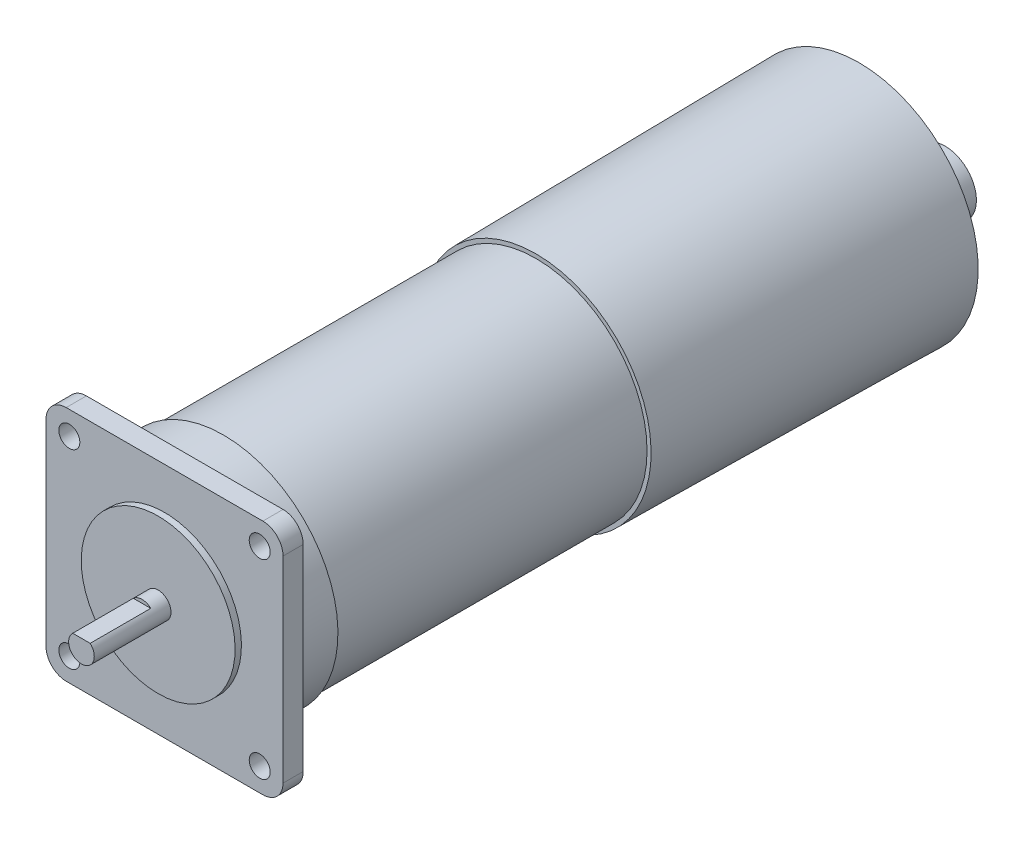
ISO-10303-21;
HEADER;
FILE_DESCRIPTION(('STEP AP214'),'2;1');
FILE_NAME('part.step','',(''),(''),'','','');
FILE_SCHEMA(('AUTOMOTIVE_DESIGN { 1 0 10303 214 1 1 1 1 }'));
ENDSEC;
DATA;
#1=APPLICATION_CONTEXT('core data for automotive mechanical design processes');
#2=APPLICATION_PROTOCOL_DEFINITION('international standard','automotive_design',2000,#1);
#3=PRODUCT_CONTEXT('',#1,'mechanical');
#4=PRODUCT('Part','Part','',(#3));
#5=PRODUCT_RELATED_PRODUCT_CATEGORY('part','',(#4));
#6=PRODUCT_DEFINITION_FORMATION('','',#4);
#7=PRODUCT_DEFINITION_CONTEXT('part definition',#1,'design');
#8=PRODUCT_DEFINITION('design','',#6,#7);
#9=PRODUCT_DEFINITION_SHAPE('','',#8);
#10=(LENGTH_UNIT() NAMED_UNIT(*) SI_UNIT(.MILLI.,.METRE.));
#11=(NAMED_UNIT(*) PLANE_ANGLE_UNIT() SI_UNIT($,.RADIAN.));
#12=(NAMED_UNIT(*) SI_UNIT($,.STERADIAN.) SOLID_ANGLE_UNIT());
#13=UNCERTAINTY_MEASURE_WITH_UNIT(LENGTH_MEASURE(1.E-05),#10,'distance_accuracy_value','');
#14=(GEOMETRIC_REPRESENTATION_CONTEXT(3) GLOBAL_UNCERTAINTY_ASSIGNED_CONTEXT((#13)) GLOBAL_UNIT_ASSIGNED_CONTEXT((#10,
#11,#12)) REPRESENTATION_CONTEXT('',''));
#15=CARTESIAN_POINT('',(0.,0.,0.));
#16=DIRECTION('',(0.,0.,1.));
#17=DIRECTION('',(1.,0.,0.));
#18=AXIS2_PLACEMENT_3D('',#15,#16,#17);
#19=CARTESIAN_POINT('',(0.,0.,-165.));
#20=DIRECTION('',(0.,0.,1.));
#21=DIRECTION('',(1.,0.,0.));
#22=AXIS2_PLACEMENT_3D('',#19,#20,#21);
#23=PLANE('',#22);
#24=DIRECTION('',(0.5,-0.866025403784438,0.));
#25=VECTOR('',#24,1.);
#26=CARTESIAN_POINT('',(-24.7610512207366,7.10739087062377,-165.));
#27=LINE('',#26,#25);
#28=CARTESIAN_POINT('',(-24.7610512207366,7.10739087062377,-165.));
#29=VERTEX_POINT('',#28);
#30=CARTESIAN_POINT('',(-23.3176755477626,4.60739087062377,-165.));
#31=VERTEX_POINT('',#30);
#32=EDGE_CURVE('E2389',#29,#31,#27,.T.);
#33=ORIENTED_EDGE('',*,*,#32,.F.);
#34=DIRECTION('',(-0.5,-0.866025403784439,0.));
#35=VECTOR('',#34,1.);
#36=CARTESIAN_POINT('',(-23.3176755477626,9.60739087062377,-165.));
#37=LINE('',#36,#35);
#38=CARTESIAN_POINT('',(-23.3176755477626,9.60739087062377,-165.));
#39=VERTEX_POINT('',#38);
#40=EDGE_CURVE('E2476',#39,#29,#37,.T.);
#41=ORIENTED_EDGE('',*,*,#40,.F.);
#42=DIRECTION('',(-1.,0.,0.));
#43=VECTOR('',#42,1.);
#44=CARTESIAN_POINT('',(-20.4309242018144,9.60739087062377,-165.));
#45=LINE('',#44,#43);
#46=CARTESIAN_POINT('',(-20.4309242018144,9.60739087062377,-165.));
#47=VERTEX_POINT('',#46);
#48=EDGE_CURVE('E2478',#47,#39,#45,.T.);
#49=ORIENTED_EDGE('',*,*,#48,.F.);
#50=DIRECTION('',(-0.5,0.866025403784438,0.));
#51=VECTOR('',#50,1.);
#52=CARTESIAN_POINT('',(-18.9875485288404,7.10739087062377,-165.));
#53=LINE('',#52,#51);
#54=CARTESIAN_POINT('',(-18.9875485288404,7.10739087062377,-165.));
#55=VERTEX_POINT('',#54);
#56=EDGE_CURVE('E2537',#55,#47,#53,.T.);
#57=ORIENTED_EDGE('',*,*,#56,.F.);
#58=DIRECTION('',(0.5,0.866025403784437,0.));
#59=VECTOR('',#58,1.);
#60=CARTESIAN_POINT('',(-20.4309242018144,4.60739087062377,-165.));
#61=LINE('',#60,#59);
#62=CARTESIAN_POINT('',(-20.4309242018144,4.60739087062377,-165.));
#63=VERTEX_POINT('',#62);
#64=EDGE_CURVE('E2582',#63,#55,#61,.T.);
#65=ORIENTED_EDGE('',*,*,#64,.F.);
#66=DIRECTION('',(1.,0.,0.));
#67=VECTOR('',#66,1.);
#68=CARTESIAN_POINT('',(-23.3176755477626,4.60739087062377,-165.));
#69=LINE('',#68,#67);
#70=EDGE_CURVE('E2447',#31,#63,#69,.T.);
#71=ORIENTED_EDGE('',*,*,#70,.F.);
#72=EDGE_LOOP('',(#33,#41,#49,#57,#65,#71));
#73=FACE_BOUND('',#72,.T.);
#74=CARTESIAN_POINT('',(0.,0.,-165.));
#75=DIRECTION('',(0.,0.,-1.));
#76=DIRECTION('',(-1.,0.,0.));
#77=AXIS2_PLACEMENT_3D('',#74,#75,#76);
#78=CIRCLE('',#77,26.95);
#79=CARTESIAN_POINT('',(-26.95,0.,-165.));
#80=VERTEX_POINT('',#79);
#81=EDGE_CURVE('E404',#80,#80,#78,.F.);
#82=ORIENTED_EDGE('',*,*,#81,.T.);
#83=EDGE_LOOP('',(#82));
#84=FACE_BOUND('',#83,.T.);
#85=DIRECTION('',(-0.5,0.866025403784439,0.));
#86=VECTOR('',#85,1.);
#87=CARTESIAN_POINT('',(24.7610512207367,-7.10739087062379,-165.));
#88=LINE('',#87,#86);
#89=CARTESIAN_POINT('',(24.7610512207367,-7.10739087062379,-165.));
#90=VERTEX_POINT('',#89);
#91=CARTESIAN_POINT('',(23.3176755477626,-4.6073908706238,-165.));
#92=VERTEX_POINT('',#91);
#93=EDGE_CURVE('E2396',#90,#92,#88,.T.);
#94=ORIENTED_EDGE('',*,*,#93,.F.);
#95=DIRECTION('',(0.5,0.866025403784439,0.));
#96=VECTOR('',#95,1.);
#97=CARTESIAN_POINT('',(23.3176755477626,-9.60739087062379,-165.));
#98=LINE('',#97,#96);
#99=CARTESIAN_POINT('',(23.3176755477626,-9.60739087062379,-165.));
#100=VERTEX_POINT('',#99);
#101=EDGE_CURVE('E2399',#100,#90,#98,.T.);
#102=ORIENTED_EDGE('',*,*,#101,.F.);
#103=DIRECTION('',(1.,0.,0.));
#104=VECTOR('',#103,1.);
#105=CARTESIAN_POINT('',(20.4309242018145,-9.60739087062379,-165.));
#106=LINE('',#105,#104);
#107=CARTESIAN_POINT('',(20.4309242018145,-9.60739087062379,-165.));
#108=VERTEX_POINT('',#107);
#109=EDGE_CURVE('E2572',#108,#100,#106,.T.);
#110=ORIENTED_EDGE('',*,*,#109,.F.);
#111=DIRECTION('',(0.5,-0.866025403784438,0.));
#112=VECTOR('',#111,1.);
#113=CARTESIAN_POINT('',(18.9875485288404,-7.1073908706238,-165.));
#114=LINE('',#113,#112);
#115=CARTESIAN_POINT('',(18.9875485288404,-7.1073908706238,-165.));
#116=VERTEX_POINT('',#115);
#117=EDGE_CURVE('E2540',#116,#108,#114,.T.);
#118=ORIENTED_EDGE('',*,*,#117,.F.);
#119=DIRECTION('',(-0.5,-0.866025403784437,0.));
#120=VECTOR('',#119,1.);
#121=CARTESIAN_POINT('',(20.4309242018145,-4.6073908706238,-165.));
#122=LINE('',#121,#120);
#123=CARTESIAN_POINT('',(20.4309242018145,-4.6073908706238,-165.));
#124=VERTEX_POINT('',#123);
#125=EDGE_CURVE('E2538',#124,#116,#122,.T.);
#126=ORIENTED_EDGE('',*,*,#125,.F.);
#127=DIRECTION('',(-1.,0.,0.));
#128=VECTOR('',#127,1.);
#129=CARTESIAN_POINT('',(23.3176755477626,-4.6073908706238,-165.));
#130=LINE('',#129,#128);
#131=EDGE_CURVE('E2402',#92,#124,#130,.T.);
#132=ORIENTED_EDGE('',*,*,#131,.F.);
#133=EDGE_LOOP('',(#94,#102,#110,#118,#126,#132));
#134=FACE_BOUND('',#133,.T.);
#135=ADVANCED_FACE('F16',(#73,#84,#134),#23,.T.);
#136=CARTESIAN_POINT('',(0.,0.,-170.4));
#137=DIRECTION('',(0.,0.,-1.));
#138=DIRECTION('',(-1.,0.,0.));
#139=AXIS2_PLACEMENT_3D('',#136,#137,#138);
#140=CYLINDRICAL_SURFACE('',#139,26.95);
#141=CARTESIAN_POINT('',(0.,0.,-170.4));
#142=DIRECTION('',(0.,0.,-1.));
#143=DIRECTION('',(-1.,0.,0.));
#144=AXIS2_PLACEMENT_3D('',#141,#142,#143);
#145=CIRCLE('',#144,26.95);
#146=CARTESIAN_POINT('',(-26.95,0.,-170.4));
#147=VERTEX_POINT('',#146);
#148=EDGE_CURVE('E408',#147,#147,#145,.F.);
#149=ORIENTED_EDGE('',*,*,#148,.T.);
#150=EDGE_LOOP('',(#149));
#151=FACE_BOUND('',#150,.T.);
#152=ORIENTED_EDGE('',*,*,#81,.F.);
#153=EDGE_LOOP('',(#152));
#154=FACE_BOUND('',#153,.T.);
#155=ADVANCED_FACE('F883',(#151,#154),#140,.T.);
#156=CARTESIAN_POINT('',(0.,0.,-170.4));
#157=DIRECTION('',(0.,0.,-1.));
#158=DIRECTION('',(0.,-1.,0.));
#159=AXIS2_PLACEMENT_3D('',#156,#157,#158);
#160=PLANE('',#159);
#161=ORIENTED_EDGE('',*,*,#148,.F.);
#162=EDGE_LOOP('',(#161));
#163=FACE_BOUND('',#162,.T.);
#164=CARTESIAN_POINT('',(0.,0.,-170.4));
#165=DIRECTION('',(0.,0.,1.));
#166=DIRECTION('',(1.,0.,0.));
#167=AXIS2_PLACEMENT_3D('',#164,#165,#166);
#168=CIRCLE('',#167,28.45);
#169=CARTESIAN_POINT('',(28.45,0.,-170.4));
#170=VERTEX_POINT('',#169);
#171=EDGE_CURVE('E413',#170,#170,#168,.F.);
#172=ORIENTED_EDGE('',*,*,#171,.F.);
#173=EDGE_LOOP('',(#172));
#174=FACE_BOUND('',#173,.T.);
#175=ADVANCED_FACE('F927',(#163,#174),#160,.F.);
#176=CARTESIAN_POINT('',(0.,0.,-165.));
#177=DIRECTION('',(0.,0.,1.));
#178=DIRECTION('',(1.,0.,0.));
#179=AXIS2_PLACEMENT_3D('',#176,#177,#178);
#180=CYLINDRICAL_SURFACE('',#179,28.45);
#181=CARTESIAN_POINT('',(0.,0.,-172.));
#182=DIRECTION('',(0.,0.,1.));
#183=DIRECTION('',(1.,0.,0.));
#184=AXIS2_PLACEMENT_3D('',#181,#182,#183);
#185=CIRCLE('',#184,28.45);
#186=CARTESIAN_POINT('',(28.45,0.,-172.));
#187=VERTEX_POINT('',#186);
#188=EDGE_CURVE('E418',#187,#187,#185,.T.);
#189=ORIENTED_EDGE('',*,*,#188,.T.);
#190=EDGE_LOOP('',(#189));
#191=FACE_BOUND('',#190,.T.);
#192=ORIENTED_EDGE('',*,*,#171,.T.);
#193=EDGE_LOOP('',(#192));
#194=FACE_BOUND('',#193,.T.);
#195=ADVANCED_FACE('F931',(#191,#194),#180,.T.);
#196=CARTESIAN_POINT('',(0.,0.,-172.));
#197=DIRECTION('',(0.,0.,1.));
#198=DIRECTION('',(1.,0.,0.));
#199=AXIS2_PLACEMENT_3D('',#196,#197,#198);
#200=PLANE('',#199);
#201=CARTESIAN_POINT('',(-7.10739087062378,-21.8742998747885,-172.));
#202=DIRECTION('',(0.,0.,1.));
#203=DIRECTION('',(1.,0.,0.));
#204=AXIS2_PLACEMENT_3D('',#201,#202,#203);
#205=CIRCLE('',#204,2.6);
#206=CARTESIAN_POINT('',(-4.50739087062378,-21.8742998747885,-172.));
#207=VERTEX_POINT('',#206);
#208=EDGE_CURVE('E423',#207,#207,#205,.F.);
#209=ORIENTED_EDGE('',*,*,#208,.F.);
#210=EDGE_LOOP('',(#209));
#211=FACE_BOUND('',#210,.T.);
#212=CARTESIAN_POINT('',(-13.8596064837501,-7.06182222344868,-172.));
#213=DIRECTION('',(0.,0.,1.));
#214=DIRECTION('',(1.,0.,0.));
#215=AXIS2_PLACEMENT_3D('',#212,#213,#214);
#216=CIRCLE('',#215,10.5);
#217=CARTESIAN_POINT('',(-3.3596064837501,-7.06182222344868,-172.));
#218=VERTEX_POINT('',#217);
#219=EDGE_CURVE('E428',#218,#218,#216,.F.);
#220=ORIENTED_EDGE('',*,*,#219,.F.);
#221=EDGE_LOOP('',(#220));
#222=FACE_BOUND('',#221,.T.);
#223=CARTESIAN_POINT('',(13.8596064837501,7.06182222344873,-172.));
#224=DIRECTION('',(0.,0.,1.));
#225=DIRECTION('',(1.,0.,0.));
#226=AXIS2_PLACEMENT_3D('',#223,#224,#225);
#227=CIRCLE('',#226,10.5);
#228=CARTESIAN_POINT('',(24.3596064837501,7.06182222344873,-172.));
#229=VERTEX_POINT('',#228);
#230=EDGE_CURVE('E433',#229,#229,#227,.F.);
#231=ORIENTED_EDGE('',*,*,#230,.F.);
#232=EDGE_LOOP('',(#231));
#233=FACE_BOUND('',#232,.T.);
#234=CARTESIAN_POINT('',(-22.4401778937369,9.91991134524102,-172.));
#235=DIRECTION('',(0.,0.,-1.));
#236=DIRECTION('',(-1.,0.,0.));
#237=AXIS2_PLACEMENT_3D('',#234,#235,#236);
#238=CIRCLE('',#237,1.55);
#239=CARTESIAN_POINT('',(-23.9901778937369,9.91991134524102,-172.));
#240=VERTEX_POINT('',#239);
#241=EDGE_CURVE('E438',#240,#240,#238,.T.);
#242=ORIENTED_EDGE('',*,*,#241,.F.);
#243=EDGE_LOOP('',(#242));
#244=FACE_BOUND('',#243,.T.);
#245=CARTESIAN_POINT('',(-23.9852628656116,5.16462876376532,-172.));
#246=DIRECTION('',(0.,0.,-1.));
#247=DIRECTION('',(-1.,0.,0.));
#248=AXIS2_PLACEMENT_3D('',#245,#246,#247);
#249=CIRCLE('',#248,1.55);
#250=CARTESIAN_POINT('',(-25.5352628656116,5.16462876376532,-172.));
#251=VERTEX_POINT('',#250);
#252=EDGE_CURVE('E443',#251,#251,#249,.T.);
#253=ORIENTED_EDGE('',*,*,#252,.F.);
#254=EDGE_LOOP('',(#253));
#255=FACE_BOUND('',#254,.T.);
#256=CARTESIAN_POINT('',(-14.1448436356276,-19.5864493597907,-172.));
#257=DIRECTION('',(0.,0.,-1.));
#258=DIRECTION('',(-1.,0.,0.));
#259=AXIS2_PLACEMENT_3D('',#256,#257,#258);
#260=CIRCLE('',#259,1.55);
#261=CARTESIAN_POINT('',(-15.6948436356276,-19.5864493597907,-172.));
#262=VERTEX_POINT('',#261);
#263=EDGE_CURVE('E448',#262,#262,#260,.T.);
#264=ORIENTED_EDGE('',*,*,#263,.F.);
#265=EDGE_LOOP('',(#264));
#266=FACE_BOUND('',#265,.T.);
#267=CARTESIAN_POINT('',(0.0692071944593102,24.15990087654,-172.));
#268=DIRECTION('',(0.,0.,-1.));
#269=DIRECTION('',(-1.,0.,0.));
#270=AXIS2_PLACEMENT_3D('',#267,#268,#269);
#271=CIRCLE('',#270,1.55);
#272=CARTESIAN_POINT('',(-1.48079280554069,24.15990087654,-172.));
#273=VERTEX_POINT('',#272);
#274=EDGE_CURVE('E453',#273,#273,#271,.T.);
#275=ORIENTED_EDGE('',*,*,#274,.F.);
#276=EDGE_LOOP('',(#275));
#277=FACE_BOUND('',#276,.T.);
#278=CARTESIAN_POINT('',(14.1448436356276,19.5864493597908,-172.));
#279=DIRECTION('',(0.,0.,-1.));
#280=DIRECTION('',(-1.,0.,0.));
#281=AXIS2_PLACEMENT_3D('',#278,#279,#280);
#282=CIRCLE('',#281,1.55);
#283=CARTESIAN_POINT('',(12.5948436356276,19.5864493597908,-172.));
#284=VERTEX_POINT('',#283);
#285=EDGE_CURVE('E458',#284,#284,#282,.T.);
#286=ORIENTED_EDGE('',*,*,#285,.F.);
#287=EDGE_LOOP('',(#286));
#288=FACE_BOUND('',#287,.T.);
#289=CARTESIAN_POINT('',(7.06182222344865,-13.8596064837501,-172.));
#290=DIRECTION('',(0.,0.,1.));
#291=DIRECTION('',(1.,0.,0.));
#292=AXIS2_PLACEMENT_3D('',#289,#290,#291);
#293=CIRCLE('',#292,10.5);
#294=CARTESIAN_POINT('',(17.5618222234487,-13.8596064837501,-172.));
#295=VERTEX_POINT('',#294);
#296=EDGE_CURVE('E463',#295,#295,#293,.F.);
#297=ORIENTED_EDGE('',*,*,#296,.F.);
#298=EDGE_LOOP('',(#297));
#299=FACE_BOUND('',#298,.T.);
#300=CARTESIAN_POINT('',(-7.06182222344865,13.85960648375,-172.));
#301=DIRECTION('',(0.,0.,1.));
#302=DIRECTION('',(1.,0.,0.));
#303=AXIS2_PLACEMENT_3D('',#300,#301,#302);
#304=CIRCLE('',#303,10.5);
#305=CARTESIAN_POINT('',(3.43817777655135,13.85960648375,-172.));
#306=VERTEX_POINT('',#305);
#307=EDGE_CURVE('E468',#306,#306,#304,.F.);
#308=ORIENTED_EDGE('',*,*,#307,.F.);
#309=EDGE_LOOP('',(#308));
#310=FACE_BOUND('',#309,.T.);
#311=CARTESIAN_POINT('',(7.10739087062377,21.8742998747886,-172.));
#312=DIRECTION('',(0.,0.,1.));
#313=DIRECTION('',(1.,0.,0.));
#314=AXIS2_PLACEMENT_3D('',#311,#312,#313);
#315=CIRCLE('',#314,2.6);
#316=CARTESIAN_POINT('',(9.70739087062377,21.8742998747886,-172.));
#317=VERTEX_POINT('',#316);
#318=EDGE_CURVE('E473',#317,#317,#315,.F.);
#319=ORIENTED_EDGE('',*,*,#318,.F.);
#320=EDGE_LOOP('',(#319));
#321=FACE_BOUND('',#320,.T.);
#322=ORIENTED_EDGE('',*,*,#188,.F.);
#323=EDGE_LOOP('',(#322));
#324=FACE_BOUND('',#323,.T.);
#325=ADVANCED_FACE('F935',(#211,#222,#233,#244,#255,#266,#277,#288,#299,#310,#321,#324),#200,.F.);
#326=CARTESIAN_POINT('',(-7.10739087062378,-21.8742998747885,-168.9));
#327=DIRECTION('',(0.,0.,1.));
#328=DIRECTION('',(1.,0.,0.));
#329=AXIS2_PLACEMENT_3D('',#326,#327,#328);
#330=CYLINDRICAL_SURFACE('',#329,2.6);
#331=ORIENTED_EDGE('',*,*,#208,.T.);
#332=EDGE_LOOP('',(#331));
#333=FACE_BOUND('',#332,.T.);
#334=CARTESIAN_POINT('',(-7.10739087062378,-21.8742998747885,-168.9));
#335=DIRECTION('',(0.,0.,1.));
#336=DIRECTION('',(1.,0.,0.));
#337=AXIS2_PLACEMENT_3D('',#334,#335,#336);
#338=CIRCLE('',#337,2.6);
#339=CARTESIAN_POINT('',(-4.50739087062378,-21.8742998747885,-168.9));
#340=VERTEX_POINT('',#339);
#341=EDGE_CURVE('E478',#340,#340,#338,.F.);
#342=ORIENTED_EDGE('',*,*,#341,.F.);
#343=EDGE_LOOP('',(#342));
#344=FACE_BOUND('',#343,.T.);
#345=ADVANCED_FACE('F939',(#333,#344),#330,.F.);
#346=CARTESIAN_POINT('',(-13.8596064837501,-7.06182222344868,-168.9));
#347=DIRECTION('',(0.,0.,1.));
#348=DIRECTION('',(1.,0.,0.));
#349=AXIS2_PLACEMENT_3D('',#346,#347,#348);
#350=CYLINDRICAL_SURFACE('',#349,10.5);
#351=ORIENTED_EDGE('',*,*,#219,.T.);
#352=EDGE_LOOP('',(#351));
#353=FACE_BOUND('',#352,.T.);
#354=CARTESIAN_POINT('',(-13.8596064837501,-7.06182222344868,-168.9));
#355=DIRECTION('',(0.,0.,1.));
#356=DIRECTION('',(1.,0.,0.));
#357=AXIS2_PLACEMENT_3D('',#354,#355,#356);
#358=CIRCLE('',#357,10.5);
#359=CARTESIAN_POINT('',(-3.3596064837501,-7.06182222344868,-168.9));
#360=VERTEX_POINT('',#359);
#361=EDGE_CURVE('E483',#360,#360,#358,.F.);
#362=ORIENTED_EDGE('',*,*,#361,.F.);
#363=EDGE_LOOP('',(#362));
#364=FACE_BOUND('',#363,.T.);
#365=ADVANCED_FACE('F943',(#353,#364),#350,.F.);
#366=CARTESIAN_POINT('',(13.8596064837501,7.06182222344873,-168.9));
#367=DIRECTION('',(0.,0.,1.));
#368=DIRECTION('',(1.,0.,0.));
#369=AXIS2_PLACEMENT_3D('',#366,#367,#368);
#370=CYLINDRICAL_SURFACE('',#369,10.5);
#371=ORIENTED_EDGE('',*,*,#230,.T.);
#372=EDGE_LOOP('',(#371));
#373=FACE_BOUND('',#372,.T.);
#374=CARTESIAN_POINT('',(13.8596064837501,7.06182222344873,-168.9));
#375=DIRECTION('',(0.,0.,1.));
#376=DIRECTION('',(1.,0.,0.));
#377=AXIS2_PLACEMENT_3D('',#374,#375,#376);
#378=CIRCLE('',#377,10.5);
#379=CARTESIAN_POINT('',(24.3596064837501,7.06182222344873,-168.9));
#380=VERTEX_POINT('',#379);
#381=EDGE_CURVE('E488',#380,#380,#378,.F.);
#382=ORIENTED_EDGE('',*,*,#381,.F.);
#383=EDGE_LOOP('',(#382));
#384=FACE_BOUND('',#383,.T.);
#385=ADVANCED_FACE('F947',(#373,#384),#370,.F.);
#386=CARTESIAN_POINT('',(-22.4401778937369,9.91991134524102,-172.1));
#387=DIRECTION('',(0.,0.,-1.));
#388=DIRECTION('',(-1.,0.,0.));
#389=AXIS2_PLACEMENT_3D('',#386,#387,#388);
#390=CYLINDRICAL_SURFACE('',#389,1.55);
#391=ORIENTED_EDGE('',*,*,#241,.T.);
#392=EDGE_LOOP('',(#391));
#393=FACE_BOUND('',#392,.T.);
#394=CARTESIAN_POINT('',(-22.4401778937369,9.91991134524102,-172.1));
#395=DIRECTION('',(0.,0.,-1.));
#396=DIRECTION('',(-1.,0.,0.));
#397=AXIS2_PLACEMENT_3D('',#394,#395,#396);
#398=CIRCLE('',#397,1.55);
#399=CARTESIAN_POINT('',(-23.9901778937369,9.91991134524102,-172.1));
#400=VERTEX_POINT('',#399);
#401=EDGE_CURVE('E493',#400,#400,#398,.F.);
#402=ORIENTED_EDGE('',*,*,#401,.T.);
#403=EDGE_LOOP('',(#402));
#404=FACE_BOUND('',#403,.T.);
#405=ADVANCED_FACE('F951',(#393,#404),#390,.T.);
#406=CARTESIAN_POINT('',(-23.9852628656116,5.16462876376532,-172.1));
#407=DIRECTION('',(0.,0.,-1.));
#408=DIRECTION('',(-1.,0.,0.));
#409=AXIS2_PLACEMENT_3D('',#406,#407,#408);
#410=CYLINDRICAL_SURFACE('',#409,1.55);
#411=ORIENTED_EDGE('',*,*,#252,.T.);
#412=EDGE_LOOP('',(#411));
#413=FACE_BOUND('',#412,.T.);
#414=CARTESIAN_POINT('',(-23.9852628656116,5.16462876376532,-172.1));
#415=DIRECTION('',(0.,0.,-1.));
#416=DIRECTION('',(-1.,0.,0.));
#417=AXIS2_PLACEMENT_3D('',#414,#415,#416);
#418=CIRCLE('',#417,1.55);
#419=CARTESIAN_POINT('',(-25.5352628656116,5.16462876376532,-172.1));
#420=VERTEX_POINT('',#419);
#421=EDGE_CURVE('E498',#420,#420,#418,.F.);
#422=ORIENTED_EDGE('',*,*,#421,.T.);
#423=EDGE_LOOP('',(#422));
#424=FACE_BOUND('',#423,.T.);
#425=ADVANCED_FACE('F955',(#413,#424),#410,.T.);
#426=CARTESIAN_POINT('',(-14.1448436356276,-19.5864493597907,-172.1));
#427=DIRECTION('',(0.,0.,-1.));
#428=DIRECTION('',(-1.,0.,0.));
#429=AXIS2_PLACEMENT_3D('',#426,#427,#428);
#430=CYLINDRICAL_SURFACE('',#429,1.55);
#431=ORIENTED_EDGE('',*,*,#263,.T.);
#432=EDGE_LOOP('',(#431));
#433=FACE_BOUND('',#432,.T.);
#434=CARTESIAN_POINT('',(-14.1448436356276,-19.5864493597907,-172.1));
#435=DIRECTION('',(0.,0.,-1.));
#436=DIRECTION('',(-1.,0.,0.));
#437=AXIS2_PLACEMENT_3D('',#434,#435,#436);
#438=CIRCLE('',#437,1.55);
#439=CARTESIAN_POINT('',(-15.6948436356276,-19.5864493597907,-172.1));
#440=VERTEX_POINT('',#439);
#441=EDGE_CURVE('E503',#440,#440,#438,.F.);
#442=ORIENTED_EDGE('',*,*,#441,.T.);
#443=EDGE_LOOP('',(#442));
#444=FACE_BOUND('',#443,.T.);
#445=ADVANCED_FACE('F959',(#433,#444),#430,.T.);
#446=CARTESIAN_POINT('',(0.0692071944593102,24.15990087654,-172.1));
#447=DIRECTION('',(0.,0.,-1.));
#448=DIRECTION('',(-1.,0.,0.));
#449=AXIS2_PLACEMENT_3D('',#446,#447,#448);
#450=CYLINDRICAL_SURFACE('',#449,1.55);
#451=ORIENTED_EDGE('',*,*,#274,.T.);
#452=EDGE_LOOP('',(#451));
#453=FACE_BOUND('',#452,.T.);
#454=CARTESIAN_POINT('',(0.0692071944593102,24.15990087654,-172.1));
#455=DIRECTION('',(0.,0.,-1.));
#456=DIRECTION('',(-1.,0.,0.));
#457=AXIS2_PLACEMENT_3D('',#454,#455,#456);
#458=CIRCLE('',#457,1.55);
#459=CARTESIAN_POINT('',(-1.48079280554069,24.15990087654,-172.1));
#460=VERTEX_POINT('',#459);
#461=EDGE_CURVE('E508',#460,#460,#458,.F.);
#462=ORIENTED_EDGE('',*,*,#461,.T.);
#463=EDGE_LOOP('',(#462));
#464=FACE_BOUND('',#463,.T.);
#465=ADVANCED_FACE('F963',(#453,#464),#450,.T.);
#466=CARTESIAN_POINT('',(14.1448436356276,19.5864493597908,-172.1));
#467=DIRECTION('',(0.,0.,-1.));
#468=DIRECTION('',(-1.,0.,0.));
#469=AXIS2_PLACEMENT_3D('',#466,#467,#468);
#470=CYLINDRICAL_SURFACE('',#469,1.55);
#471=ORIENTED_EDGE('',*,*,#285,.T.);
#472=EDGE_LOOP('',(#471));
#473=FACE_BOUND('',#472,.T.);
#474=CARTESIAN_POINT('',(14.1448436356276,19.5864493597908,-172.1));
#475=DIRECTION('',(0.,0.,-1.));
#476=DIRECTION('',(-1.,0.,0.));
#477=AXIS2_PLACEMENT_3D('',#474,#475,#476);
#478=CIRCLE('',#477,1.55);
#479=CARTESIAN_POINT('',(12.5948436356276,19.5864493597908,-172.1));
#480=VERTEX_POINT('',#479);
#481=EDGE_CURVE('E513',#480,#480,#478,.F.);
#482=ORIENTED_EDGE('',*,*,#481,.T.);
#483=EDGE_LOOP('',(#482));
#484=FACE_BOUND('',#483,.T.);
#485=ADVANCED_FACE('F967',(#473,#484),#470,.T.);
#486=CARTESIAN_POINT('',(7.06182222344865,-13.8596064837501,-168.9));
#487=DIRECTION('',(0.,0.,1.));
#488=DIRECTION('',(1.,0.,0.));
#489=AXIS2_PLACEMENT_3D('',#486,#487,#488);
#490=CYLINDRICAL_SURFACE('',#489,10.5);
#491=ORIENTED_EDGE('',*,*,#296,.T.);
#492=EDGE_LOOP('',(#491));
#493=FACE_BOUND('',#492,.T.);
#494=CARTESIAN_POINT('',(7.06182222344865,-13.8596064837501,-168.9));
#495=DIRECTION('',(0.,0.,1.));
#496=DIRECTION('',(1.,0.,0.));
#497=AXIS2_PLACEMENT_3D('',#494,#495,#496);
#498=CIRCLE('',#497,10.5);
#499=CARTESIAN_POINT('',(17.5618222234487,-13.8596064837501,-168.9));
#500=VERTEX_POINT('',#499);
#501=EDGE_CURVE('E518',#500,#500,#498,.F.);
#502=ORIENTED_EDGE('',*,*,#501,.F.);
#503=EDGE_LOOP('',(#502));
#504=FACE_BOUND('',#503,.T.);
#505=ADVANCED_FACE('F971',(#493,#504),#490,.F.);
#506=CARTESIAN_POINT('',(-7.06182222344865,13.85960648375,-168.9));
#507=DIRECTION('',(0.,0.,1.));
#508=DIRECTION('',(1.,0.,0.));
#509=AXIS2_PLACEMENT_3D('',#506,#507,#508);
#510=CYLINDRICAL_SURFACE('',#509,10.5);
#511=ORIENTED_EDGE('',*,*,#307,.T.);
#512=EDGE_LOOP('',(#511));
#513=FACE_BOUND('',#512,.T.);
#514=CARTESIAN_POINT('',(-7.06182222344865,13.85960648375,-168.9));
#515=DIRECTION('',(0.,0.,1.));
#516=DIRECTION('',(1.,0.,0.));
#517=AXIS2_PLACEMENT_3D('',#514,#515,#516);
#518=CIRCLE('',#517,10.5);
#519=CARTESIAN_POINT('',(3.43817777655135,13.85960648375,-168.9));
#520=VERTEX_POINT('',#519);
#521=EDGE_CURVE('E523',#520,#520,#518,.F.);
#522=ORIENTED_EDGE('',*,*,#521,.F.);
#523=EDGE_LOOP('',(#522));
#524=FACE_BOUND('',#523,.T.);
#525=ADVANCED_FACE('F975',(#513,#524),#510,.F.);
#526=CARTESIAN_POINT('',(7.10739087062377,21.8742998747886,-168.9));
#527=DIRECTION('',(0.,0.,1.));
#528=DIRECTION('',(1.,0.,0.));
#529=AXIS2_PLACEMENT_3D('',#526,#527,#528);
#530=CYLINDRICAL_SURFACE('',#529,2.6);
#531=ORIENTED_EDGE('',*,*,#318,.T.);
#532=EDGE_LOOP('',(#531));
#533=FACE_BOUND('',#532,.T.);
#534=CARTESIAN_POINT('',(7.10739087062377,21.8742998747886,-168.9));
#535=DIRECTION('',(0.,0.,1.));
#536=DIRECTION('',(1.,0.,0.));
#537=AXIS2_PLACEMENT_3D('',#534,#535,#536);
#538=CIRCLE('',#537,2.6);
#539=CARTESIAN_POINT('',(9.70739087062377,21.8742998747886,-168.9));
#540=VERTEX_POINT('',#539);
#541=EDGE_CURVE('E528',#540,#540,#538,.F.);
#542=ORIENTED_EDGE('',*,*,#541,.F.);
#543=EDGE_LOOP('',(#542));
#544=FACE_BOUND('',#543,.T.);
#545=ADVANCED_FACE('F979',(#533,#544),#530,.F.);
#546=CARTESIAN_POINT('',(-7.10739087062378,-21.8742998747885,-168.9));
#547=DIRECTION('',(0.,0.,1.));
#548=DIRECTION('',(1.,0.,0.));
#549=AXIS2_PLACEMENT_3D('',#546,#547,#548);
#550=PLANE('',#549);
#551=CARTESIAN_POINT('',(-7.10739087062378,-21.8742998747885,-168.9));
#552=DIRECTION('',(0.,0.,-1.));
#553=DIRECTION('',(-1.,0.,0.));
#554=AXIS2_PLACEMENT_3D('',#551,#552,#553);
#555=CIRCLE('',#554,2.25);
#556=CARTESIAN_POINT('',(-9.35739087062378,-21.8742998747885,-168.9));
#557=VERTEX_POINT('',#556);
#558=EDGE_CURVE('E533',#557,#557,#555,.T.);
#559=ORIENTED_EDGE('',*,*,#558,.F.);
#560=EDGE_LOOP('',(#559));
#561=FACE_BOUND('',#560,.T.);
#562=ORIENTED_EDGE('',*,*,#341,.T.);
#563=EDGE_LOOP('',(#562));
#564=FACE_BOUND('',#563,.T.);
#565=ADVANCED_FACE('F983',(#561,#564),#550,.F.);
#566=CARTESIAN_POINT('',(-13.8596064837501,-7.06182222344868,-168.9));
#567=DIRECTION('',(0.,0.,1.));
#568=DIRECTION('',(1.,0.,0.));
#569=AXIS2_PLACEMENT_3D('',#566,#567,#568);
#570=PLANE('',#569);
#571=DIRECTION('',(0.866025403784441,-0.5,0.));
#572=VECTOR('',#571,1.);
#573=CARTESIAN_POINT('',(-13.8596064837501,2.68817777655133,-168.9));
#574=LINE('',#573,#572);
#575=CARTESIAN_POINT('',(-13.8596064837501,2.68817777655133,-168.9));
#576=VERTEX_POINT('',#575);
#577=CARTESIAN_POINT('',(-4.85960648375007,-2.50797464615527,-168.9));
#578=VERTEX_POINT('',#577);
#579=EDGE_CURVE('E2712',#576,#578,#574,.T.);
#580=ORIENTED_EDGE('',*,*,#579,.F.);
#581=DIRECTION('',(0.866025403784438,0.5,0.));
#582=VECTOR('',#581,1.);
#583=CARTESIAN_POINT('',(-22.85960648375,-2.50797464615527,-168.9));
#584=LINE('',#583,#582);
#585=CARTESIAN_POINT('',(-22.85960648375,-2.50797464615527,-168.9));
#586=VERTEX_POINT('',#585);
#587=EDGE_CURVE('E2714',#586,#576,#584,.T.);
#588=ORIENTED_EDGE('',*,*,#587,.F.);
#589=DIRECTION('',(0.,1.,0.));
#590=VECTOR('',#589,1.);
#591=CARTESIAN_POINT('',(-22.85960648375,-7.06182222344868,-168.9));
#592=LINE('',#591,#590);
#593=CARTESIAN_POINT('',(-22.85960648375,-11.615669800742,-168.9));
#594=VERTEX_POINT('',#593);
#595=EDGE_CURVE('E2716',#594,#586,#592,.T.);
#596=ORIENTED_EDGE('',*,*,#595,.F.);
#597=DIRECTION('',(-0.86602540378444,0.5,0.));
#598=VECTOR('',#597,1.);
#599=CARTESIAN_POINT('',(-13.85960648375,-16.8118222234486,-168.9));
#600=LINE('',#599,#598);
#601=CARTESIAN_POINT('',(-13.85960648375,-16.8118222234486,-168.9));
#602=VERTEX_POINT('',#601);
#603=EDGE_CURVE('E2718',#602,#594,#600,.T.);
#604=ORIENTED_EDGE('',*,*,#603,.F.);
#605=DIRECTION('',(-0.866025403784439,-0.5,0.));
#606=VECTOR('',#605,1.);
#607=CARTESIAN_POINT('',(-4.85960648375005,-11.615669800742,-168.9));
#608=LINE('',#607,#606);
#609=CARTESIAN_POINT('',(-4.85960648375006,-11.615669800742,-168.9));
#610=VERTEX_POINT('',#609);
#611=EDGE_CURVE('E2720',#610,#602,#608,.T.);
#612=ORIENTED_EDGE('',*,*,#611,.F.);
#613=DIRECTION('',(0.,1.,0.));
#614=VECTOR('',#613,1.);
#615=CARTESIAN_POINT('',(-4.85960648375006,-7.06182222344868,-168.9));
#616=LINE('',#615,#614);
#617=EDGE_CURVE('E538',#578,#610,#616,.F.);
#618=ORIENTED_EDGE('',*,*,#617,.F.);
#619=EDGE_LOOP('',(#580,#588,#596,#604,#612,#618));
#620=FACE_BOUND('',#619,.T.);
#621=ORIENTED_EDGE('',*,*,#361,.T.);
#622=EDGE_LOOP('',(#621));
#623=FACE_BOUND('',#622,.T.);
#624=ADVANCED_FACE('F987',(#620,#623),#570,.F.);
#625=CARTESIAN_POINT('',(13.8596064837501,7.06182222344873,-168.9));
#626=DIRECTION('',(0.,0.,1.));
#627=DIRECTION('',(1.,0.,0.));
#628=AXIS2_PLACEMENT_3D('',#625,#626,#627);
#629=PLANE('',#628);
#630=DIRECTION('',(0.,1.,0.));
#631=VECTOR('',#630,1.);
#632=CARTESIAN_POINT('',(22.85960648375,7.06182222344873,-168.9));
#633=LINE('',#632,#631);
#634=CARTESIAN_POINT('',(22.85960648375,11.615669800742,-168.9));
#635=VERTEX_POINT('',#634);
#636=CARTESIAN_POINT('',(22.85960648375,2.50797464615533,-168.9));
#637=VERTEX_POINT('',#636);
#638=EDGE_CURVE('E2725',#635,#637,#633,.F.);
#639=ORIENTED_EDGE('',*,*,#638,.F.);
#640=DIRECTION('',(0.866025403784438,-0.5,0.));
#641=VECTOR('',#640,1.);
#642=CARTESIAN_POINT('',(13.8596064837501,16.8118222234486,-168.9));
#643=LINE('',#642,#641);
#644=CARTESIAN_POINT('',(13.8596064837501,16.8118222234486,-168.9));
#645=VERTEX_POINT('',#644);
#646=EDGE_CURVE('E2727',#645,#635,#643,.T.);
#647=ORIENTED_EDGE('',*,*,#646,.F.);
#648=DIRECTION('',(0.866025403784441,0.5,0.));
#649=VECTOR('',#648,1.);
#650=CARTESIAN_POINT('',(4.85960648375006,11.615669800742,-168.9));
#651=LINE('',#650,#649);
#652=CARTESIAN_POINT('',(4.85960648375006,11.615669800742,-168.9));
#653=VERTEX_POINT('',#652);
#654=EDGE_CURVE('E2729',#653,#645,#651,.T.);
#655=ORIENTED_EDGE('',*,*,#654,.F.);
#656=DIRECTION('',(0.,1.,0.));
#657=VECTOR('',#656,1.);
#658=CARTESIAN_POINT('',(4.85960648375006,7.06182222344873,-168.9));
#659=LINE('',#658,#657);
#660=CARTESIAN_POINT('',(4.85960648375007,2.50797464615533,-168.9));
#661=VERTEX_POINT('',#660);
#662=EDGE_CURVE('E2731',#661,#653,#659,.T.);
#663=ORIENTED_EDGE('',*,*,#662,.F.);
#664=DIRECTION('',(-0.866025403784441,0.5,0.));
#665=VECTOR('',#664,1.);
#666=CARTESIAN_POINT('',(13.8596064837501,-2.68817777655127,-168.9));
#667=LINE('',#666,#665);
#668=CARTESIAN_POINT('',(13.8596064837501,-2.68817777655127,-168.9));
#669=VERTEX_POINT('',#668);
#670=EDGE_CURVE('E2733',#669,#661,#667,.T.);
#671=ORIENTED_EDGE('',*,*,#670,.F.);
#672=DIRECTION('',(-0.866025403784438,-0.5,0.));
#673=VECTOR('',#672,1.);
#674=CARTESIAN_POINT('',(22.85960648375,2.50797464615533,-168.9));
#675=LINE('',#674,#673);
#676=EDGE_CURVE('E2722',#637,#669,#675,.T.);
#677=ORIENTED_EDGE('',*,*,#676,.F.);
#678=EDGE_LOOP('',(#639,#647,#655,#663,#671,#677));
#679=FACE_BOUND('',#678,.T.);
#680=ORIENTED_EDGE('',*,*,#381,.T.);
#681=EDGE_LOOP('',(#680));
#682=FACE_BOUND('',#681,.T.);
#683=ADVANCED_FACE('F991',(#679,#682),#629,.F.);
#684=CARTESIAN_POINT('',(-22.4401778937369,9.91991134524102,-172.1));
#685=DIRECTION('',(0.,0.,1.));
#686=DIRECTION('',(1.,0.,0.));
#687=AXIS2_PLACEMENT_3D('',#684,#685,#686);
#688=PLANE('',#687);
#689=ORIENTED_EDGE('',*,*,#401,.F.);
#690=EDGE_LOOP('',(#689));
#691=FACE_BOUND('',#690,.T.);
#692=ADVANCED_FACE('F995',(#691),#688,.F.);
#693=CARTESIAN_POINT('',(-23.9852628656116,5.16462876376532,-172.1));
#694=DIRECTION('',(0.,0.,1.));
#695=DIRECTION('',(1.,0.,0.));
#696=AXIS2_PLACEMENT_3D('',#693,#694,#695);
#697=PLANE('',#696);
#698=ORIENTED_EDGE('',*,*,#421,.F.);
#699=EDGE_LOOP('',(#698));
#700=FACE_BOUND('',#699,.T.);
#701=ADVANCED_FACE('F999',(#700),#697,.F.);
#702=CARTESIAN_POINT('',(-14.1448436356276,-19.5864493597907,-172.1));
#703=DIRECTION('',(0.,0.,1.));
#704=DIRECTION('',(1.,0.,0.));
#705=AXIS2_PLACEMENT_3D('',#702,#703,#704);
#706=PLANE('',#705);
#707=ORIENTED_EDGE('',*,*,#441,.F.);
#708=EDGE_LOOP('',(#707));
#709=FACE_BOUND('',#708,.T.);
#710=ADVANCED_FACE('F1003',(#709),#706,.F.);
#711=CARTESIAN_POINT('',(0.0692071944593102,24.15990087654,-172.1));
#712=DIRECTION('',(0.,0.,1.));
#713=DIRECTION('',(1.,0.,0.));
#714=AXIS2_PLACEMENT_3D('',#711,#712,#713);
#715=PLANE('',#714);
#716=ORIENTED_EDGE('',*,*,#461,.F.);
#717=EDGE_LOOP('',(#716));
#718=FACE_BOUND('',#717,.T.);
#719=ADVANCED_FACE('F1007',(#718),#715,.F.);
#720=CARTESIAN_POINT('',(14.1448436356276,19.5864493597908,-172.1));
#721=DIRECTION('',(0.,0.,1.));
#722=DIRECTION('',(1.,0.,0.));
#723=AXIS2_PLACEMENT_3D('',#720,#721,#722);
#724=PLANE('',#723);
#725=ORIENTED_EDGE('',*,*,#481,.F.);
#726=EDGE_LOOP('',(#725));
#727=FACE_BOUND('',#726,.T.);
#728=ADVANCED_FACE('F1011',(#727),#724,.F.);
#729=CARTESIAN_POINT('',(7.06182222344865,-13.8596064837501,-168.9));
#730=DIRECTION('',(0.,0.,1.));
#731=DIRECTION('',(1.,0.,0.));
#732=AXIS2_PLACEMENT_3D('',#729,#730,#731);
#733=PLANE('',#732);
#734=DIRECTION('',(0.866025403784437,-0.5,0.));
#735=VECTOR('',#734,1.);
#736=CARTESIAN_POINT('',(7.06182222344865,-4.10960648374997,-168.9));
#737=LINE('',#736,#735);
#738=CARTESIAN_POINT('',(7.06182222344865,-4.10960648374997,-168.9));
#739=VERTEX_POINT('',#738);
#740=CARTESIAN_POINT('',(16.0618222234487,-9.30575890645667,-168.9));
#741=VERTEX_POINT('',#740);
#742=EDGE_CURVE('E2738',#739,#741,#737,.T.);
#743=ORIENTED_EDGE('',*,*,#742,.F.);
#744=DIRECTION('',(0.866025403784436,0.5,0.));
#745=VECTOR('',#744,1.);
#746=CARTESIAN_POINT('',(-1.93817777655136,-9.30575890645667,-168.9));
#747=LINE('',#746,#745);
#748=CARTESIAN_POINT('',(-1.93817777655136,-9.30575890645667,-168.9));
#749=VERTEX_POINT('',#748);
#750=EDGE_CURVE('E2740',#749,#739,#747,.T.);
#751=ORIENTED_EDGE('',*,*,#750,.F.);
#752=DIRECTION('',(0.,1.,0.));
#753=VECTOR('',#752,1.);
#754=CARTESIAN_POINT('',(-1.93817777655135,-13.8596064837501,-168.9));
#755=LINE('',#754,#753);
#756=CARTESIAN_POINT('',(-1.93817777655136,-18.4134540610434,-168.9));
#757=VERTEX_POINT('',#756);
#758=EDGE_CURVE('E2742',#757,#749,#755,.T.);
#759=ORIENTED_EDGE('',*,*,#758,.F.);
#760=DIRECTION('',(-0.866025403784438,0.5,0.));
#761=VECTOR('',#760,1.);
#762=CARTESIAN_POINT('',(7.06182222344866,-23.60960648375,-168.9));
#763=LINE('',#762,#761);
#764=CARTESIAN_POINT('',(7.06182222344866,-23.60960648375,-168.9));
#765=VERTEX_POINT('',#764);
#766=EDGE_CURVE('E2744',#765,#757,#763,.T.);
#767=ORIENTED_EDGE('',*,*,#766,.F.);
#768=DIRECTION('',(-0.866025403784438,-0.5,0.));
#769=VECTOR('',#768,1.);
#770=CARTESIAN_POINT('',(16.0618222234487,-18.4134540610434,-168.9));
#771=LINE('',#770,#769);
#772=CARTESIAN_POINT('',(16.0618222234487,-18.4134540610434,-168.9));
#773=VERTEX_POINT('',#772);
#774=EDGE_CURVE('E544',#773,#765,#771,.T.);
#775=ORIENTED_EDGE('',*,*,#774,.F.);
#776=DIRECTION('',(0.,1.,0.));
#777=VECTOR('',#776,1.);
#778=CARTESIAN_POINT('',(16.0618222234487,-13.8596064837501,-168.9));
#779=LINE('',#778,#777);
#780=EDGE_CURVE('E2735',#741,#773,#779,.F.);
#781=ORIENTED_EDGE('',*,*,#780,.F.);
#782=EDGE_LOOP('',(#743,#751,#759,#767,#775,#781));
#783=FACE_BOUND('',#782,.T.);
#784=ORIENTED_EDGE('',*,*,#501,.T.);
#785=EDGE_LOOP('',(#784));
#786=FACE_BOUND('',#785,.T.);
#787=ADVANCED_FACE('F1015',(#783,#786),#733,.F.);
#788=CARTESIAN_POINT('',(-7.06182222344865,13.85960648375,-168.9));
#789=DIRECTION('',(0.,0.,1.));
#790=DIRECTION('',(1.,0.,0.));
#791=AXIS2_PLACEMENT_3D('',#788,#789,#790);
#792=PLANE('',#791);
#793=DIRECTION('',(-0.5,-0.866025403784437,0.));
#794=VECTOR('',#793,1.);
#795=CARTESIAN_POINT('',(-11.9368222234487,22.3033541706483,-168.9));
#796=LINE('',#795,#794);
#797=CARTESIAN_POINT('',(-17.1329746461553,13.3033541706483,-168.9));
#798=VERTEX_POINT('',#797);
#799=CARTESIAN_POINT('',(-11.9368222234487,22.3033541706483,-168.9));
#800=VERTEX_POINT('',#799);
#801=EDGE_CURVE('E2682',#798,#800,#796,.F.);
#802=ORIENTED_EDGE('',*,*,#801,.F.);
#803=DIRECTION('',(-0.5,0.86602540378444,0.));
#804=VECTOR('',#803,1.);
#805=CARTESIAN_POINT('',(-14.8560508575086,9.35960648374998,-168.9));
#806=LINE('',#805,#804);
#807=CARTESIAN_POINT('',(-12.5791270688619,5.41585879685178,-168.9));
#808=VERTEX_POINT('',#807);
#809=EDGE_CURVE('E2680',#808,#798,#806,.T.);
#810=ORIENTED_EDGE('',*,*,#809,.F.);
#811=DIRECTION('',(1.,0.,0.));
#812=VECTOR('',#811,1.);
#813=CARTESIAN_POINT('',(-2.18682222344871,5.41585879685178,-168.9));
#814=LINE('',#813,#812);
#815=CARTESIAN_POINT('',(-2.18682222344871,5.41585879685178,-168.9));
#816=VERTEX_POINT('',#815);
#817=EDGE_CURVE('E2674',#816,#808,#814,.F.);
#818=ORIENTED_EDGE('',*,*,#817,.F.);
#819=DIRECTION('',(0.5,0.866025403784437,0.));
#820=VECTOR('',#819,1.);
#821=CARTESIAN_POINT('',(-2.18682222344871,5.41585879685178,-168.9));
#822=LINE('',#821,#820);
#823=CARTESIAN_POINT('',(3.00933019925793,14.4158587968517,-168.9));
#824=VERTEX_POINT('',#823);
#825=EDGE_CURVE('E2669',#824,#816,#822,.F.);
#826=ORIENTED_EDGE('',*,*,#825,.F.);
#827=DIRECTION('',(-0.5,0.86602540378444,0.));
#828=VECTOR('',#827,1.);
#829=CARTESIAN_POINT('',(-1.5445173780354,22.3033541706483,-168.9));
#830=LINE('',#829,#828);
#831=CARTESIAN_POINT('',(-1.5445173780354,22.3033541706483,-168.9));
#832=VERTEX_POINT('',#831);
#833=EDGE_CURVE('E2664',#832,#824,#830,.F.);
#834=ORIENTED_EDGE('',*,*,#833,.F.);
#835=DIRECTION('',(-1.,0.,0.));
#836=VECTOR('',#835,1.);
#837=CARTESIAN_POINT('',(-11.9368222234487,22.3033541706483,-168.9));
#838=LINE('',#837,#836);
#839=EDGE_CURVE('E2659',#800,#832,#838,.F.);
#840=ORIENTED_EDGE('',*,*,#839,.F.);
#841=EDGE_LOOP('',(#802,#810,#818,#826,#834,#840));
#842=FACE_BOUND('',#841,.T.);
#843=ORIENTED_EDGE('',*,*,#521,.T.);
#844=EDGE_LOOP('',(#843));
#845=FACE_BOUND('',#844,.T.);
#846=ADVANCED_FACE('F1019',(#842,#845),#792,.F.);
#847=CARTESIAN_POINT('',(7.10739087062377,21.8742998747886,-168.9));
#848=DIRECTION('',(0.,0.,1.));
#849=DIRECTION('',(1.,0.,0.));
#850=AXIS2_PLACEMENT_3D('',#847,#848,#849);
#851=PLANE('',#850);
#852=CARTESIAN_POINT('',(7.10739087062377,21.8742998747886,-168.9));
#853=DIRECTION('',(0.,0.,-1.));
#854=DIRECTION('',(-1.,0.,0.));
#855=AXIS2_PLACEMENT_3D('',#852,#853,#854);
#856=CIRCLE('',#855,2.25);
#857=CARTESIAN_POINT('',(4.85739087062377,21.8742998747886,-168.9));
#858=VERTEX_POINT('',#857);
#859=EDGE_CURVE('E541',#858,#858,#856,.T.);
#860=ORIENTED_EDGE('',*,*,#859,.F.);
#861=EDGE_LOOP('',(#860));
#862=FACE_BOUND('',#861,.T.);
#863=ORIENTED_EDGE('',*,*,#541,.T.);
#864=EDGE_LOOP('',(#863));
#865=FACE_BOUND('',#864,.T.);
#866=ADVANCED_FACE('F1023',(#862,#865),#851,.F.);
#867=CARTESIAN_POINT('',(-7.10739087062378,-21.8742998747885,-172.8));
#868=DIRECTION('',(0.,0.,-1.));
#869=DIRECTION('',(-1.,0.,0.));
#870=AXIS2_PLACEMENT_3D('',#867,#868,#869);
#871=CYLINDRICAL_SURFACE('',#870,2.25);
#872=ORIENTED_EDGE('',*,*,#558,.T.);
#873=EDGE_LOOP('',(#872));
#874=FACE_BOUND('',#873,.T.);
#875=CARTESIAN_POINT('',(-7.10739087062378,-21.8742998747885,-172.8));
#876=DIRECTION('',(0.,0.,-1.));
#877=DIRECTION('',(-1.,0.,0.));
#878=AXIS2_PLACEMENT_3D('',#875,#876,#877);
#879=CIRCLE('',#878,2.25);
#880=CARTESIAN_POINT('',(-9.35739087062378,-21.8742998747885,-172.8));
#881=VERTEX_POINT('',#880);
#882=EDGE_CURVE('E545',#881,#881,#879,.F.);
#883=ORIENTED_EDGE('',*,*,#882,.T.);
#884=EDGE_LOOP('',(#883));
#885=FACE_BOUND('',#884,.T.);
#886=ADVANCED_FACE('F1027',(#874,#885),#871,.T.);
#887=CARTESIAN_POINT('',(-13.8596064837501,2.68817777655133,-171.95));
#888=DIRECTION('',(0.5,0.866025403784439,0.));
#889=DIRECTION('',(-0.866025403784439,0.5,0.));
#890=AXIS2_PLACEMENT_3D('',#887,#888,#889);
#891=PLANE('',#890);
#892=DIRECTION('',(-0.866025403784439,0.5,0.));
#893=VECTOR('',#892,1.);
#894=CARTESIAN_POINT('',(-13.8596064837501,2.68817777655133,-171.95));
#895=LINE('',#894,#893);
#896=CARTESIAN_POINT('',(-4.85960648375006,-2.50797464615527,-171.95));
#897=VERTEX_POINT('',#896);
#898=CARTESIAN_POINT('',(-13.8596064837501,2.68817777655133,-171.95));
#899=VERTEX_POINT('',#898);
#900=EDGE_CURVE('E2758',#897,#899,#895,.T.);
#901=ORIENTED_EDGE('',*,*,#900,.T.);
#902=DIRECTION('',(0.,0.,1.));
#903=VECTOR('',#902,1.);
#904=CARTESIAN_POINT('',(-13.8596064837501,2.68817777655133,-171.95));
#905=LINE('',#904,#903);
#906=EDGE_CURVE('E2755',#899,#576,#905,.T.);
#907=ORIENTED_EDGE('',*,*,#906,.T.);
#908=ORIENTED_EDGE('',*,*,#579,.T.);
#909=DIRECTION('',(0.,0.,1.));
#910=VECTOR('',#909,1.);
#911=CARTESIAN_POINT('',(-4.85960648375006,-2.50797464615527,-171.95));
#912=LINE('',#911,#910);
#913=EDGE_CURVE('E550',#897,#578,#912,.T.);
#914=ORIENTED_EDGE('',*,*,#913,.F.);
#915=EDGE_LOOP('',(#901,#907,#908,#914));
#916=FACE_BOUND('',#915,.T.);
#917=ADVANCED_FACE('F1031',(#916),#891,.T.);
#918=CARTESIAN_POINT('',(-13.8596064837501,2.68817777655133,-171.95));
#919=DIRECTION('',(-0.5,0.866025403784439,0.));
#920=DIRECTION('',(-0.866025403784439,-0.5,0.));
#921=AXIS2_PLACEMENT_3D('',#918,#919,#920);
#922=PLANE('',#921);
#923=DIRECTION('',(-0.866025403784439,-0.5,0.));
#924=VECTOR('',#923,1.);
#925=CARTESIAN_POINT('',(-13.8596064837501,2.68817777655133,-171.95));
#926=LINE('',#925,#924);
#927=CARTESIAN_POINT('',(-22.85960648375,-2.50797464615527,-171.95));
#928=VERTEX_POINT('',#927);
#929=EDGE_CURVE('E2764',#899,#928,#926,.T.);
#930=ORIENTED_EDGE('',*,*,#929,.T.);
#931=DIRECTION('',(0.,0.,1.));
#932=VECTOR('',#931,1.);
#933=CARTESIAN_POINT('',(-22.85960648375,-2.50797464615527,-171.95));
#934=LINE('',#933,#932);
#935=EDGE_CURVE('E2761',#928,#586,#934,.T.);
#936=ORIENTED_EDGE('',*,*,#935,.T.);
#937=ORIENTED_EDGE('',*,*,#587,.T.);
#938=ORIENTED_EDGE('',*,*,#906,.F.);
#939=EDGE_LOOP('',(#930,#936,#937,#938));
#940=FACE_BOUND('',#939,.T.);
#941=ADVANCED_FACE('F1041',(#940),#922,.T.);
#942=CARTESIAN_POINT('',(-22.85960648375,-7.06182222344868,-171.95));
#943=DIRECTION('',(-1.,0.,0.));
#944=DIRECTION('',(0.,0.,1.));
#945=AXIS2_PLACEMENT_3D('',#942,#943,#944);
#946=PLANE('',#945);
#947=DIRECTION('',(0.,1.,0.));
#948=VECTOR('',#947,1.);
#949=CARTESIAN_POINT('',(-22.85960648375,-7.06182222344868,-171.95));
#950=LINE('',#949,#948);
#951=CARTESIAN_POINT('',(-22.85960648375,-11.615669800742,-171.95));
#952=VERTEX_POINT('',#951);
#953=EDGE_CURVE('E2770',#928,#952,#950,.F.);
#954=ORIENTED_EDGE('',*,*,#953,.T.);
#955=DIRECTION('',(0.,0.,1.));
#956=VECTOR('',#955,1.);
#957=CARTESIAN_POINT('',(-22.85960648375,-11.615669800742,-171.95));
#958=LINE('',#957,#956);
#959=EDGE_CURVE('E2767',#952,#594,#958,.T.);
#960=ORIENTED_EDGE('',*,*,#959,.T.);
#961=ORIENTED_EDGE('',*,*,#595,.T.);
#962=ORIENTED_EDGE('',*,*,#935,.F.);
#963=EDGE_LOOP('',(#954,#960,#961,#962));
#964=FACE_BOUND('',#963,.T.);
#965=ADVANCED_FACE('F1045',(#964),#946,.T.);
#966=CARTESIAN_POINT('',(-13.85960648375,-16.8118222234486,-171.95));
#967=DIRECTION('',(-0.5,-0.866025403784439,0.));
#968=DIRECTION('',(0.866025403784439,-0.5,0.));
#969=AXIS2_PLACEMENT_3D('',#966,#967,#968);
#970=PLANE('',#969);
#971=DIRECTION('',(0.866025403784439,-0.5,0.));
#972=VECTOR('',#971,1.);
#973=CARTESIAN_POINT('',(-13.85960648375,-16.8118222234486,-171.95));
#974=LINE('',#973,#972);
#975=CARTESIAN_POINT('',(-13.85960648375,-16.8118222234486,-171.95));
#976=VERTEX_POINT('',#975);
#977=EDGE_CURVE('E2776',#952,#976,#974,.T.);
#978=ORIENTED_EDGE('',*,*,#977,.T.);
#979=DIRECTION('',(0.,0.,1.));
#980=VECTOR('',#979,1.);
#981=CARTESIAN_POINT('',(-13.85960648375,-16.8118222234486,-171.95));
#982=LINE('',#981,#980);
#983=EDGE_CURVE('E2773',#976,#602,#982,.T.);
#984=ORIENTED_EDGE('',*,*,#983,.T.);
#985=ORIENTED_EDGE('',*,*,#603,.T.);
#986=ORIENTED_EDGE('',*,*,#959,.F.);
#987=EDGE_LOOP('',(#978,#984,#985,#986));
#988=FACE_BOUND('',#987,.T.);
#989=ADVANCED_FACE('F1049',(#988),#970,.T.);
#990=CARTESIAN_POINT('',(-13.85960648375,-16.8118222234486,-171.95));
#991=DIRECTION('',(0.5,-0.866025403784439,0.));
#992=DIRECTION('',(0.866025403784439,0.5,0.));
#993=AXIS2_PLACEMENT_3D('',#990,#991,#992);
#994=PLANE('',#993);
#995=DIRECTION('',(0.866025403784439,0.5,0.));
#996=VECTOR('',#995,1.);
#997=CARTESIAN_POINT('',(-13.85960648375,-16.8118222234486,-171.95));
#998=LINE('',#997,#996);
#999=CARTESIAN_POINT('',(-4.85960648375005,-11.615669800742,-171.95));
#1000=VERTEX_POINT('',#999);
#1001=EDGE_CURVE('E2779',#976,#1000,#998,.T.);
#1002=ORIENTED_EDGE('',*,*,#1001,.T.);
#1003=DIRECTION('',(0.,0.,1.));
#1004=VECTOR('',#1003,1.);
#1005=CARTESIAN_POINT('',(-4.85960648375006,-11.615669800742,-171.95));
#1006=LINE('',#1005,#1004);
#1007=EDGE_CURVE('E2752',#610,#1000,#1006,.F.);
#1008=ORIENTED_EDGE('',*,*,#1007,.F.);
#1009=ORIENTED_EDGE('',*,*,#611,.T.);
#1010=ORIENTED_EDGE('',*,*,#983,.F.);
#1011=EDGE_LOOP('',(#1002,#1008,#1009,#1010));
#1012=FACE_BOUND('',#1011,.T.);
#1013=ADVANCED_FACE('F1037',(#1012),#994,.T.);
#1014=CARTESIAN_POINT('',(-4.85960648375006,-2.50797464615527,-171.95));
#1015=DIRECTION('',(1.,0.,0.));
#1016=DIRECTION('',(0.,1.,0.));
#1017=AXIS2_PLACEMENT_3D('',#1014,#1015,#1016);
#1018=PLANE('',#1017);
#1019=DIRECTION('',(0.,1.,0.));
#1020=VECTOR('',#1019,1.);
#1021=CARTESIAN_POINT('',(-4.85960648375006,-2.50797464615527,-171.95));
#1022=LINE('',#1021,#1020);
#1023=EDGE_CURVE('E2749',#1000,#897,#1022,.T.);
#1024=ORIENTED_EDGE('',*,*,#1023,.T.);
#1025=ORIENTED_EDGE('',*,*,#913,.T.);
#1026=ORIENTED_EDGE('',*,*,#617,.T.);
#1027=ORIENTED_EDGE('',*,*,#1007,.T.);
#1028=EDGE_LOOP('',(#1024,#1025,#1026,#1027));
#1029=FACE_BOUND('',#1028,.T.);
#1030=ADVANCED_FACE('F1033',(#1029),#1018,.T.);
#1031=CARTESIAN_POINT('',(22.85960648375,11.615669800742,-171.95));
#1032=DIRECTION('',(-1.,0.,0.));
#1033=DIRECTION('',(0.,-1.,0.));
#1034=AXIS2_PLACEMENT_3D('',#1031,#1032,#1033);
#1035=PLANE('',#1034);
#1036=DIRECTION('',(0.,0.,1.));
#1037=VECTOR('',#1036,1.);
#1038=CARTESIAN_POINT('',(22.85960648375,2.50797464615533,-171.95));
#1039=LINE('',#1038,#1037);
#1040=CARTESIAN_POINT('',(22.85960648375,2.50797464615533,-171.95));
#1041=VERTEX_POINT('',#1040);
#1042=EDGE_CURVE('E2785',#637,#1041,#1039,.F.);
#1043=ORIENTED_EDGE('',*,*,#1042,.T.);
#1044=DIRECTION('',(0.,-1.,0.));
#1045=VECTOR('',#1044,1.);
#1046=CARTESIAN_POINT('',(22.85960648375,11.615669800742,-171.95));
#1047=LINE('',#1046,#1045);
#1048=CARTESIAN_POINT('',(22.85960648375,11.615669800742,-171.95));
#1049=VERTEX_POINT('',#1048);
#1050=EDGE_CURVE('E2788',#1049,#1041,#1047,.T.);
#1051=ORIENTED_EDGE('',*,*,#1050,.F.);
#1052=DIRECTION('',(0.,0.,1.));
#1053=VECTOR('',#1052,1.);
#1054=CARTESIAN_POINT('',(22.85960648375,11.615669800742,-171.95));
#1055=LINE('',#1054,#1053);
#1056=EDGE_CURVE('E2790',#635,#1049,#1055,.F.);
#1057=ORIENTED_EDGE('',*,*,#1056,.F.);
#1058=ORIENTED_EDGE('',*,*,#638,.T.);
#1059=EDGE_LOOP('',(#1043,#1051,#1057,#1058));
#1060=FACE_BOUND('',#1059,.T.);
#1061=ADVANCED_FACE('F1036',(#1060),#1035,.F.);
#1062=CARTESIAN_POINT('',(13.8596064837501,16.8118222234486,-171.95));
#1063=DIRECTION('',(-0.5,-0.866025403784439,0.));
#1064=DIRECTION('',(0.866025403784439,-0.5,0.));
#1065=AXIS2_PLACEMENT_3D('',#1062,#1063,#1064);
#1066=PLANE('',#1065);
#1067=ORIENTED_EDGE('',*,*,#1056,.T.);
#1068=DIRECTION('',(0.866025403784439,-0.5,0.));
#1069=VECTOR('',#1068,1.);
#1070=CARTESIAN_POINT('',(13.8596064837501,16.8118222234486,-171.95));
#1071=LINE('',#1070,#1069);
#1072=CARTESIAN_POINT('',(13.8596064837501,16.8118222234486,-171.95));
#1073=VERTEX_POINT('',#1072);
#1074=EDGE_CURVE('E2793',#1073,#1049,#1071,.T.);
#1075=ORIENTED_EDGE('',*,*,#1074,.F.);
#1076=DIRECTION('',(0.,0.,1.));
#1077=VECTOR('',#1076,1.);
#1078=CARTESIAN_POINT('',(13.8596064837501,16.8118222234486,-171.95));
#1079=LINE('',#1078,#1077);
#1080=EDGE_CURVE('E2795',#645,#1073,#1079,.F.);
#1081=ORIENTED_EDGE('',*,*,#1080,.F.);
#1082=ORIENTED_EDGE('',*,*,#646,.T.);
#1083=EDGE_LOOP('',(#1067,#1075,#1081,#1082));
#1084=FACE_BOUND('',#1083,.T.);
#1085=ADVANCED_FACE('F1065',(#1084),#1066,.F.);
#1086=CARTESIAN_POINT('',(13.8596064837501,16.8118222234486,-171.95));
#1087=DIRECTION('',(0.5,-0.866025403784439,0.));
#1088=DIRECTION('',(0.866025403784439,0.5,0.));
#1089=AXIS2_PLACEMENT_3D('',#1086,#1087,#1088);
#1090=PLANE('',#1089);
#1091=ORIENTED_EDGE('',*,*,#1080,.T.);
#1092=DIRECTION('',(0.866025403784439,0.5,0.));
#1093=VECTOR('',#1092,1.);
#1094=CARTESIAN_POINT('',(13.8596064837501,16.8118222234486,-171.95));
#1095=LINE('',#1094,#1093);
#1096=CARTESIAN_POINT('',(4.85960648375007,11.615669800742,-171.95));
#1097=VERTEX_POINT('',#1096);
#1098=EDGE_CURVE('E2798',#1097,#1073,#1095,.T.);
#1099=ORIENTED_EDGE('',*,*,#1098,.F.);
#1100=DIRECTION('',(0.,0.,1.));
#1101=VECTOR('',#1100,1.);
#1102=CARTESIAN_POINT('',(4.85960648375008,11.615669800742,-171.95));
#1103=LINE('',#1102,#1101);
#1104=EDGE_CURVE('E2800',#653,#1097,#1103,.F.);
#1105=ORIENTED_EDGE('',*,*,#1104,.F.);
#1106=ORIENTED_EDGE('',*,*,#654,.T.);
#1107=EDGE_LOOP('',(#1091,#1099,#1105,#1106));
#1108=FACE_BOUND('',#1107,.T.);
#1109=ADVANCED_FACE('F1069',(#1108),#1090,.F.);
#1110=CARTESIAN_POINT('',(4.85960648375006,7.06182222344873,-171.95));
#1111=DIRECTION('',(1.,0.,0.));
#1112=DIRECTION('',(0.,0.,-1.));
#1113=AXIS2_PLACEMENT_3D('',#1110,#1111,#1112);
#1114=PLANE('',#1113);
#1115=ORIENTED_EDGE('',*,*,#1104,.T.);
#1116=DIRECTION('',(0.,1.,0.));
#1117=VECTOR('',#1116,1.);
#1118=CARTESIAN_POINT('',(4.85960648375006,7.06182222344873,-171.95));
#1119=LINE('',#1118,#1117);
#1120=CARTESIAN_POINT('',(4.85960648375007,2.50797464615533,-171.95));
#1121=VERTEX_POINT('',#1120);
#1122=EDGE_CURVE('E2803',#1121,#1097,#1119,.T.);
#1123=ORIENTED_EDGE('',*,*,#1122,.F.);
#1124=DIRECTION('',(0.,0.,-1.));
#1125=VECTOR('',#1124,1.);
#1126=CARTESIAN_POINT('',(4.85960648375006,2.50797464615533,-171.95));
#1127=LINE('',#1126,#1125);
#1128=EDGE_CURVE('E2805',#661,#1121,#1127,.T.);
#1129=ORIENTED_EDGE('',*,*,#1128,.F.);
#1130=ORIENTED_EDGE('',*,*,#662,.T.);
#1131=EDGE_LOOP('',(#1115,#1123,#1129,#1130));
#1132=FACE_BOUND('',#1131,.T.);
#1133=ADVANCED_FACE('F1073',(#1132),#1114,.F.);
#1134=CARTESIAN_POINT('',(13.8596064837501,-2.68817777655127,-171.95));
#1135=DIRECTION('',(0.5,0.866025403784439,0.));
#1136=DIRECTION('',(-0.866025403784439,0.5,0.));
#1137=AXIS2_PLACEMENT_3D('',#1134,#1135,#1136);
#1138=PLANE('',#1137);
#1139=ORIENTED_EDGE('',*,*,#1128,.T.);
#1140=DIRECTION('',(-0.866025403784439,0.5,0.));
#1141=VECTOR('',#1140,1.);
#1142=CARTESIAN_POINT('',(13.8596064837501,-2.68817777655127,-171.95));
#1143=LINE('',#1142,#1141);
#1144=CARTESIAN_POINT('',(13.8596064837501,-2.68817777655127,-171.95));
#1145=VERTEX_POINT('',#1144);
#1146=EDGE_CURVE('E2808',#1145,#1121,#1143,.T.);
#1147=ORIENTED_EDGE('',*,*,#1146,.F.);
#1148=DIRECTION('',(0.,0.,1.));
#1149=VECTOR('',#1148,1.);
#1150=CARTESIAN_POINT('',(13.8596064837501,-2.68817777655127,-171.95));
#1151=LINE('',#1150,#1149);
#1152=EDGE_CURVE('E2781',#1145,#669,#1151,.T.);
#1153=ORIENTED_EDGE('',*,*,#1152,.T.);
#1154=ORIENTED_EDGE('',*,*,#670,.T.);
#1155=EDGE_LOOP('',(#1139,#1147,#1153,#1154));
#1156=FACE_BOUND('',#1155,.T.);
#1157=ADVANCED_FACE('F1061',(#1156),#1138,.F.);
#1158=CARTESIAN_POINT('',(13.8596064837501,-2.68817777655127,-171.95));
#1159=DIRECTION('',(-0.5,0.866025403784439,0.));
#1160=DIRECTION('',(-0.866025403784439,-0.5,0.));
#1161=AXIS2_PLACEMENT_3D('',#1158,#1159,#1160);
#1162=PLANE('',#1161);
#1163=ORIENTED_EDGE('',*,*,#1152,.F.);
#1164=DIRECTION('',(-0.866025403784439,-0.5,0.));
#1165=VECTOR('',#1164,1.);
#1166=CARTESIAN_POINT('',(13.8596064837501,-2.68817777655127,-171.95));
#1167=LINE('',#1166,#1165);
#1168=EDGE_CURVE('E2783',#1041,#1145,#1167,.T.);
#1169=ORIENTED_EDGE('',*,*,#1168,.F.);
#1170=ORIENTED_EDGE('',*,*,#1042,.F.);
#1171=ORIENTED_EDGE('',*,*,#676,.T.);
#1172=EDGE_LOOP('',(#1163,#1169,#1170,#1171));
#1173=FACE_BOUND('',#1172,.T.);
#1174=ADVANCED_FACE('F1057',(#1173),#1162,.F.);
#1175=CARTESIAN_POINT('',(7.06182222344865,-4.10960648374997,-171.95));
#1176=DIRECTION('',(0.5,0.866025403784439,0.));
#1177=DIRECTION('',(-0.866025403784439,0.5,0.));
#1178=AXIS2_PLACEMENT_3D('',#1175,#1176,#1177);
#1179=PLANE('',#1178);
#1180=DIRECTION('',(-0.866025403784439,0.5,0.));
#1181=VECTOR('',#1180,1.);
#1182=CARTESIAN_POINT('',(7.06182222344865,-4.10960648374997,-171.95));
#1183=LINE('',#1182,#1181);
#1184=CARTESIAN_POINT('',(16.0618222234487,-9.30575890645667,-171.95));
#1185=VERTEX_POINT('',#1184);
#1186=CARTESIAN_POINT('',(7.06182222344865,-4.10960648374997,-171.95));
#1187=VERTEX_POINT('',#1186);
#1188=EDGE_CURVE('E2822',#1185,#1187,#1183,.T.);
#1189=ORIENTED_EDGE('',*,*,#1188,.T.);
#1190=DIRECTION('',(0.,0.,1.));
#1191=VECTOR('',#1190,1.);
#1192=CARTESIAN_POINT('',(7.06182222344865,-4.10960648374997,-171.95));
#1193=LINE('',#1192,#1191);
#1194=EDGE_CURVE('E2819',#1187,#739,#1193,.T.);
#1195=ORIENTED_EDGE('',*,*,#1194,.T.);
#1196=ORIENTED_EDGE('',*,*,#742,.T.);
#1197=DIRECTION('',(0.,0.,1.));
#1198=VECTOR('',#1197,1.);
#1199=CARTESIAN_POINT('',(16.0618222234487,-9.30575890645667,-171.95));
#1200=LINE('',#1199,#1198);
#1201=EDGE_CURVE('E2810',#1185,#741,#1200,.T.);
#1202=ORIENTED_EDGE('',*,*,#1201,.F.);
#1203=EDGE_LOOP('',(#1189,#1195,#1196,#1202));
#1204=FACE_BOUND('',#1203,.T.);
#1205=ADVANCED_FACE('F1060',(#1204),#1179,.T.);
#1206=CARTESIAN_POINT('',(7.06182222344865,-4.10960648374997,-171.95));
#1207=DIRECTION('',(-0.5,0.866025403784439,0.));
#1208=DIRECTION('',(-0.866025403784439,-0.5,0.));
#1209=AXIS2_PLACEMENT_3D('',#1206,#1207,#1208);
#1210=PLANE('',#1209);
#1211=DIRECTION('',(-0.866025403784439,-0.5,0.));
#1212=VECTOR('',#1211,1.);
#1213=CARTESIAN_POINT('',(7.06182222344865,-4.10960648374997,-171.95));
#1214=LINE('',#1213,#1212);
#1215=CARTESIAN_POINT('',(-1.93817777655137,-9.30575890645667,-171.95));
#1216=VERTEX_POINT('',#1215);
#1217=EDGE_CURVE('E2828',#1187,#1216,#1214,.T.);
#1218=ORIENTED_EDGE('',*,*,#1217,.T.);
#1219=DIRECTION('',(0.,0.,1.));
#1220=VECTOR('',#1219,1.);
#1221=CARTESIAN_POINT('',(-1.93817777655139,-9.30575890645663,-171.95));
#1222=LINE('',#1221,#1220);
#1223=EDGE_CURVE('E2825',#1216,#749,#1222,.T.);
#1224=ORIENTED_EDGE('',*,*,#1223,.T.);
#1225=ORIENTED_EDGE('',*,*,#750,.T.);
#1226=ORIENTED_EDGE('',*,*,#1194,.F.);
#1227=EDGE_LOOP('',(#1218,#1224,#1225,#1226));
#1228=FACE_BOUND('',#1227,.T.);
#1229=ADVANCED_FACE('F1087',(#1228),#1210,.T.);
#1230=CARTESIAN_POINT('',(-1.93817777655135,-13.8596064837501,-171.95));
#1231=DIRECTION('',(-1.,0.,0.));
#1232=DIRECTION('',(0.,0.,1.));
#1233=AXIS2_PLACEMENT_3D('',#1230,#1231,#1232);
#1234=PLANE('',#1233);
#1235=DIRECTION('',(0.,1.,0.));
#1236=VECTOR('',#1235,1.);
#1237=CARTESIAN_POINT('',(-1.93817777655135,-13.8596064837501,-171.95));
#1238=LINE('',#1237,#1236);
#1239=CARTESIAN_POINT('',(-1.93817777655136,-18.4134540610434,-171.95));
#1240=VERTEX_POINT('',#1239);
#1241=EDGE_CURVE('E2834',#1216,#1240,#1238,.F.);
#1242=ORIENTED_EDGE('',*,*,#1241,.T.);
#1243=DIRECTION('',(0.,0.,1.));
#1244=VECTOR('',#1243,1.);
#1245=CARTESIAN_POINT('',(-1.93817777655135,-18.4134540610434,-171.95));
#1246=LINE('',#1245,#1244);
#1247=EDGE_CURVE('E2831',#1240,#757,#1246,.T.);
#1248=ORIENTED_EDGE('',*,*,#1247,.T.);
#1249=ORIENTED_EDGE('',*,*,#758,.T.);
#1250=ORIENTED_EDGE('',*,*,#1223,.F.);
#1251=EDGE_LOOP('',(#1242,#1248,#1249,#1250));
#1252=FACE_BOUND('',#1251,.T.);
#1253=ADVANCED_FACE('F1091',(#1252),#1234,.T.);
#1254=CARTESIAN_POINT('',(7.06182222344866,-23.60960648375,-171.95));
#1255=DIRECTION('',(-0.5,-0.866025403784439,0.));
#1256=DIRECTION('',(0.866025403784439,-0.5,0.));
#1257=AXIS2_PLACEMENT_3D('',#1254,#1255,#1256);
#1258=PLANE('',#1257);
#1259=DIRECTION('',(0.866025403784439,-0.5,0.));
#1260=VECTOR('',#1259,1.);
#1261=CARTESIAN_POINT('',(7.06182222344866,-23.60960648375,-171.95));
#1262=LINE('',#1261,#1260);
#1263=CARTESIAN_POINT('',(7.06182222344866,-23.60960648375,-171.95));
#1264=VERTEX_POINT('',#1263);
#1265=EDGE_CURVE('E2839',#1240,#1264,#1262,.T.);
#1266=ORIENTED_EDGE('',*,*,#1265,.T.);
#1267=DIRECTION('',(0.,0.,1.));
#1268=VECTOR('',#1267,1.);
#1269=CARTESIAN_POINT('',(7.06182222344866,-23.60960648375,-171.95));
#1270=LINE('',#1269,#1268);
#1271=EDGE_CURVE('E2837',#1264,#765,#1270,.T.);
#1272=ORIENTED_EDGE('',*,*,#1271,.T.);
#1273=ORIENTED_EDGE('',*,*,#766,.T.);
#1274=ORIENTED_EDGE('',*,*,#1247,.F.);
#1275=EDGE_LOOP('',(#1266,#1272,#1273,#1274));
#1276=FACE_BOUND('',#1275,.T.);
#1277=ADVANCED_FACE('F1095',(#1276),#1258,.T.);
#1278=CARTESIAN_POINT('',(7.06182222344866,-23.60960648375,-171.95));
#1279=DIRECTION('',(0.5,-0.866025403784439,0.));
#1280=DIRECTION('',(0.866025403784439,0.5,0.));
#1281=AXIS2_PLACEMENT_3D('',#1278,#1279,#1280);
#1282=PLANE('',#1281);
#1283=DIRECTION('',(0.866025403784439,0.5,0.));
#1284=VECTOR('',#1283,1.);
#1285=CARTESIAN_POINT('',(7.06182222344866,-23.60960648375,-171.95));
#1286=LINE('',#1285,#1284);
#1287=CARTESIAN_POINT('',(16.0618222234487,-18.4134540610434,-171.95));
#1288=VERTEX_POINT('',#1287);
#1289=EDGE_CURVE('E367',#1264,#1288,#1286,.T.);
#1290=ORIENTED_EDGE('',*,*,#1289,.T.);
#1291=DIRECTION('',(0.,0.,1.));
#1292=VECTOR('',#1291,1.);
#1293=CARTESIAN_POINT('',(16.0618222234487,-18.4134540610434,-171.95));
#1294=LINE('',#1293,#1292);
#1295=EDGE_CURVE('E2816',#773,#1288,#1294,.F.);
#1296=ORIENTED_EDGE('',*,*,#1295,.F.);
#1297=ORIENTED_EDGE('',*,*,#774,.T.);
#1298=ORIENTED_EDGE('',*,*,#1271,.F.);
#1299=EDGE_LOOP('',(#1290,#1296,#1297,#1298));
#1300=FACE_BOUND('',#1299,.T.);
#1301=ADVANCED_FACE('F1083',(#1300),#1282,.T.);
#1302=CARTESIAN_POINT('',(16.0618222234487,-9.30575890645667,-171.95));
#1303=DIRECTION('',(1.,0.,0.));
#1304=DIRECTION('',(0.,1.,0.));
#1305=AXIS2_PLACEMENT_3D('',#1302,#1303,#1304);
#1306=PLANE('',#1305);
#1307=DIRECTION('',(0.,1.,0.));
#1308=VECTOR('',#1307,1.);
#1309=CARTESIAN_POINT('',(16.0618222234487,-9.30575890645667,-171.95));
#1310=LINE('',#1309,#1308);
#1311=EDGE_CURVE('E2813',#1288,#1185,#1310,.T.);
#1312=ORIENTED_EDGE('',*,*,#1311,.T.);
#1313=ORIENTED_EDGE('',*,*,#1201,.T.);
#1314=ORIENTED_EDGE('',*,*,#780,.T.);
#1315=ORIENTED_EDGE('',*,*,#1295,.T.);
#1316=EDGE_LOOP('',(#1312,#1313,#1314,#1315));
#1317=FACE_BOUND('',#1316,.T.);
#1318=ADVANCED_FACE('F900',(#1317),#1306,.T.);
#1319=CARTESIAN_POINT('',(-11.9368222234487,22.3033541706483,-171.95));
#1320=DIRECTION('',(-0.866025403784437,0.5,0.));
#1321=DIRECTION('',(-0.5,-0.866025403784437,0.));
#1322=AXIS2_PLACEMENT_3D('',#1319,#1320,#1321);
#1323=PLANE('',#1322);
#1324=DIRECTION('',(-0.5,-0.866025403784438,0.));
#1325=VECTOR('',#1324,1.);
#1326=CARTESIAN_POINT('',(-11.9368222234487,22.3033541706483,-171.95));
#1327=LINE('',#1326,#1325);
#1328=CARTESIAN_POINT('',(-11.9368222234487,22.3033541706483,-171.95));
#1329=VERTEX_POINT('',#1328);
#1330=CARTESIAN_POINT('',(-17.1329746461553,13.3033541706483,-171.95));
#1331=VERTEX_POINT('',#1330);
#1332=EDGE_CURVE('E2650',#1329,#1331,#1327,.T.);
#1333=ORIENTED_EDGE('',*,*,#1332,.T.);
#1334=DIRECTION('',(0.,0.,1.));
#1335=VECTOR('',#1334,1.);
#1336=CARTESIAN_POINT('',(-17.1329746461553,13.3033541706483,-171.95));
#1337=LINE('',#1336,#1335);
#1338=EDGE_CURVE('E2677',#798,#1331,#1337,.F.);
#1339=ORIENTED_EDGE('',*,*,#1338,.F.);
#1340=ORIENTED_EDGE('',*,*,#801,.T.);
#1341=DIRECTION('',(0.,0.,1.));
#1342=VECTOR('',#1341,1.);
#1343=CARTESIAN_POINT('',(-11.9368222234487,22.3033541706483,-171.95));
#1344=LINE('',#1343,#1342);
#1345=EDGE_CURVE('E2653',#1329,#800,#1344,.T.);
#1346=ORIENTED_EDGE('',*,*,#1345,.F.);
#1347=EDGE_LOOP('',(#1333,#1339,#1340,#1346));
#1348=FACE_BOUND('',#1347,.T.);
#1349=ADVANCED_FACE('F870',(#1348),#1323,.T.);
#1350=CARTESIAN_POINT('',(-14.8560508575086,9.35960648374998,-171.95));
#1351=DIRECTION('',(-0.86602540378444,-0.5,0.));
#1352=DIRECTION('',(0.,0.,1.));
#1353=AXIS2_PLACEMENT_3D('',#1350,#1351,#1352);
#1354=PLANE('',#1353);
#1355=DIRECTION('',(-0.5,0.86602540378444,0.));
#1356=VECTOR('',#1355,1.);
#1357=CARTESIAN_POINT('',(-19.7310508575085,17.8033541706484,-171.95));
#1358=LINE('',#1357,#1356);
#1359=CARTESIAN_POINT('',(-12.5791270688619,5.41585879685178,-171.95));
#1360=VERTEX_POINT('',#1359);
#1361=EDGE_CURVE('E2648',#1331,#1360,#1358,.F.);
#1362=ORIENTED_EDGE('',*,*,#1361,.T.);
#1363=DIRECTION('',(0.,0.,1.));
#1364=VECTOR('',#1363,1.);
#1365=CARTESIAN_POINT('',(-12.5791270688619,5.41585879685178,-171.95));
#1366=LINE('',#1365,#1364);
#1367=EDGE_CURVE('E2671',#808,#1360,#1366,.F.);
#1368=ORIENTED_EDGE('',*,*,#1367,.F.);
#1369=ORIENTED_EDGE('',*,*,#809,.T.);
#1370=ORIENTED_EDGE('',*,*,#1338,.T.);
#1371=EDGE_LOOP('',(#1362,#1368,#1369,#1370));
#1372=FACE_BOUND('',#1371,.T.);
#1373=ADVANCED_FACE('F863',(#1372),#1354,.T.);
#1374=CARTESIAN_POINT('',(-2.18682222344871,5.41585879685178,-171.95));
#1375=DIRECTION('',(0.,-1.,0.));
#1376=DIRECTION('',(1.,0.,0.));
#1377=AXIS2_PLACEMENT_3D('',#1374,#1375,#1376);
#1378=PLANE('',#1377);
#1379=DIRECTION('',(1.,0.,0.));
#1380=VECTOR('',#1379,1.);
#1381=CARTESIAN_POINT('',(-12.5791270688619,5.41585879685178,-171.95));
#1382=LINE('',#1381,#1380);
#1383=CARTESIAN_POINT('',(-2.18682222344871,5.41585879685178,-171.95));
#1384=VERTEX_POINT('',#1383);
#1385=EDGE_CURVE('E2646',#1360,#1384,#1382,.T.);
#1386=ORIENTED_EDGE('',*,*,#1385,.T.);
#1387=DIRECTION('',(0.,0.,1.));
#1388=VECTOR('',#1387,1.);
#1389=CARTESIAN_POINT('',(-2.18682222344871,5.41585879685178,-171.95));
#1390=LINE('',#1389,#1388);
#1391=EDGE_CURVE('E2666',#816,#1384,#1390,.F.);
#1392=ORIENTED_EDGE('',*,*,#1391,.F.);
#1393=ORIENTED_EDGE('',*,*,#817,.T.);
#1394=ORIENTED_EDGE('',*,*,#1367,.T.);
#1395=EDGE_LOOP('',(#1386,#1392,#1393,#1394));
#1396=FACE_BOUND('',#1395,.T.);
#1397=ADVANCED_FACE('F890',(#1396),#1378,.T.);
#1398=CARTESIAN_POINT('',(-2.18682222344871,5.41585879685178,-171.95));
#1399=DIRECTION('',(0.866025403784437,-0.5,0.));
#1400=DIRECTION('',(0.5,0.866025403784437,0.));
#1401=AXIS2_PLACEMENT_3D('',#1398,#1399,#1400);
#1402=PLANE('',#1401);
#1403=DIRECTION('',(0.5,0.866025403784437,0.));
#1404=VECTOR('',#1403,1.);
#1405=CARTESIAN_POINT('',(-2.18682222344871,5.41585879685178,-171.95));
#1406=LINE('',#1405,#1404);
#1407=CARTESIAN_POINT('',(3.00933019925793,14.4158587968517,-171.95));
#1408=VERTEX_POINT('',#1407);
#1409=EDGE_CURVE('E2644',#1384,#1408,#1406,.T.);
#1410=ORIENTED_EDGE('',*,*,#1409,.T.);
#1411=DIRECTION('',(0.,0.,1.));
#1412=VECTOR('',#1411,1.);
#1413=CARTESIAN_POINT('',(3.00933019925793,14.4158587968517,-171.95));
#1414=LINE('',#1413,#1412);
#1415=EDGE_CURVE('E2661',#824,#1408,#1414,.F.);
#1416=ORIENTED_EDGE('',*,*,#1415,.F.);
#1417=ORIENTED_EDGE('',*,*,#825,.T.);
#1418=ORIENTED_EDGE('',*,*,#1391,.T.);
#1419=EDGE_LOOP('',(#1410,#1416,#1417,#1418));
#1420=FACE_BOUND('',#1419,.T.);
#1421=ADVANCED_FACE('F886',(#1420),#1402,.T.);
#1422=CARTESIAN_POINT('',(-1.5445173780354,22.3033541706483,-171.95));
#1423=DIRECTION('',(0.86602540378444,0.5,0.));
#1424=DIRECTION('',(-0.5,0.86602540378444,0.));
#1425=AXIS2_PLACEMENT_3D('',#1422,#1423,#1424);
#1426=PLANE('',#1425);
#1427=DIRECTION('',(-0.5,0.86602540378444,0.));
#1428=VECTOR('',#1427,1.);
#1429=CARTESIAN_POINT('',(-4.14259358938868,26.8033541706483,-171.95));
#1430=LINE('',#1429,#1428);
#1431=CARTESIAN_POINT('',(-1.5445173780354,22.3033541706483,-171.95));
#1432=VERTEX_POINT('',#1431);
#1433=EDGE_CURVE('E2642',#1408,#1432,#1430,.T.);
#1434=ORIENTED_EDGE('',*,*,#1433,.T.);
#1435=DIRECTION('',(0.,0.,1.));
#1436=VECTOR('',#1435,1.);
#1437=CARTESIAN_POINT('',(-1.5445173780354,22.3033541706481,-171.95));
#1438=LINE('',#1437,#1436);
#1439=EDGE_CURVE('E2656',#832,#1432,#1438,.F.);
#1440=ORIENTED_EDGE('',*,*,#1439,.F.);
#1441=ORIENTED_EDGE('',*,*,#833,.T.);
#1442=ORIENTED_EDGE('',*,*,#1415,.T.);
#1443=EDGE_LOOP('',(#1434,#1440,#1441,#1442));
#1444=FACE_BOUND('',#1443,.T.);
#1445=ADVANCED_FACE('F881',(#1444),#1426,.T.);
#1446=CARTESIAN_POINT('',(-11.9368222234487,22.3033541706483,-171.95));
#1447=DIRECTION('',(0.,1.,0.));
#1448=DIRECTION('',(-1.,0.,0.));
#1449=AXIS2_PLACEMENT_3D('',#1446,#1447,#1448);
#1450=PLANE('',#1449);
#1451=DIRECTION('',(-1.,0.,0.));
#1452=VECTOR('',#1451,1.);
#1453=CARTESIAN_POINT('',(-1.5445173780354,22.3033541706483,-171.95));
#1454=LINE('',#1453,#1452);
#1455=EDGE_CURVE('E2638',#1432,#1329,#1454,.T.);
#1456=ORIENTED_EDGE('',*,*,#1455,.T.);
#1457=ORIENTED_EDGE('',*,*,#1345,.T.);
#1458=ORIENTED_EDGE('',*,*,#839,.T.);
#1459=ORIENTED_EDGE('',*,*,#1439,.T.);
#1460=EDGE_LOOP('',(#1456,#1457,#1458,#1459));
#1461=FACE_BOUND('',#1460,.T.);
#1462=ADVANCED_FACE('F871',(#1461),#1450,.T.);
#1463=CARTESIAN_POINT('',(7.10739087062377,21.8742998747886,-172.8));
#1464=DIRECTION('',(0.,0.,-1.));
#1465=DIRECTION('',(-1.,0.,0.));
#1466=AXIS2_PLACEMENT_3D('',#1463,#1464,#1465);
#1467=CYLINDRICAL_SURFACE('',#1466,2.25);
#1468=ORIENTED_EDGE('',*,*,#859,.T.);
#1469=EDGE_LOOP('',(#1468));
#1470=FACE_BOUND('',#1469,.T.);
#1471=CARTESIAN_POINT('',(7.10739087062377,21.8742998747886,-172.8));
#1472=DIRECTION('',(0.,0.,-1.));
#1473=DIRECTION('',(-1.,0.,0.));
#1474=AXIS2_PLACEMENT_3D('',#1471,#1472,#1473);
#1475=CIRCLE('',#1474,2.25);
#1476=CARTESIAN_POINT('',(4.85739087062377,21.8742998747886,-172.8));
#1477=VERTEX_POINT('',#1476);
#1478=EDGE_CURVE('E553',#1477,#1477,#1475,.F.);
#1479=ORIENTED_EDGE('',*,*,#1478,.T.);
#1480=EDGE_LOOP('',(#1479));
#1481=FACE_BOUND('',#1480,.T.);
#1482=ADVANCED_FACE('F880',(#1470,#1481),#1467,.T.);
#1483=CARTESIAN_POINT('',(-7.10739087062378,-21.8742998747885,-172.8));
#1484=DIRECTION('',(0.,0.,1.));
#1485=DIRECTION('',(1.,0.,0.));
#1486=AXIS2_PLACEMENT_3D('',#1483,#1484,#1485);
#1487=PLANE('',#1486);
#1488=ORIENTED_EDGE('',*,*,#882,.F.);
#1489=EDGE_LOOP('',(#1488));
#1490=FACE_BOUND('',#1489,.T.);
#1491=ADVANCED_FACE('F1105',(#1490),#1487,.F.);
#1492=CARTESIAN_POINT('',(-13.8596064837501,2.68817777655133,-171.95));
#1493=DIRECTION('',(0.,0.,1.));
#1494=DIRECTION('',(1.,0.,0.));
#1495=AXIS2_PLACEMENT_3D('',#1492,#1493,#1494);
#1496=PLANE('',#1495);
#1497=CARTESIAN_POINT('',(-13.8596064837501,-7.06182222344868,-171.95));
#1498=DIRECTION('',(0.,0.,-1.));
#1499=DIRECTION('',(-1.,0.,0.));
#1500=AXIS2_PLACEMENT_3D('',#1497,#1498,#1499);
#1501=CIRCLE('',#1500,6.);
#1502=CARTESIAN_POINT('',(-19.8596064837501,-7.06182222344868,-171.95));
#1503=VERTEX_POINT('',#1502);
#1504=EDGE_CURVE('E556',#1503,#1503,#1501,.T.);
#1505=ORIENTED_EDGE('',*,*,#1504,.F.);
#1506=EDGE_LOOP('',(#1505));
#1507=FACE_BOUND('',#1506,.T.);
#1508=ORIENTED_EDGE('',*,*,#1023,.F.);
#1509=ORIENTED_EDGE('',*,*,#1001,.F.);
#1510=ORIENTED_EDGE('',*,*,#977,.F.);
#1511=ORIENTED_EDGE('',*,*,#953,.F.);
#1512=ORIENTED_EDGE('',*,*,#929,.F.);
#1513=ORIENTED_EDGE('',*,*,#900,.F.);
#1514=EDGE_LOOP('',(#1508,#1509,#1510,#1511,#1512,#1513));
#1515=FACE_BOUND('',#1514,.T.);
#1516=ADVANCED_FACE('F1109',(#1507,#1515),#1496,.F.);
#1517=CARTESIAN_POINT('',(13.8596064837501,-2.68817777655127,-171.95));
#1518=DIRECTION('',(0.,0.,-1.));
#1519=DIRECTION('',(-1.,0.,0.));
#1520=AXIS2_PLACEMENT_3D('',#1517,#1518,#1519);
#1521=PLANE('',#1520);
#1522=CARTESIAN_POINT('',(13.8596064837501,7.06182222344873,-171.95));
#1523=DIRECTION('',(0.,0.,-1.));
#1524=DIRECTION('',(-1.,0.,0.));
#1525=AXIS2_PLACEMENT_3D('',#1522,#1523,#1524);
#1526=CIRCLE('',#1525,7.75);
#1527=CARTESIAN_POINT('',(6.1096064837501,7.06182222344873,-171.95));
#1528=VERTEX_POINT('',#1527);
#1529=EDGE_CURVE('E561',#1528,#1528,#1526,.F.);
#1530=ORIENTED_EDGE('',*,*,#1529,.T.);
#1531=EDGE_LOOP('',(#1530));
#1532=FACE_BOUND('',#1531,.T.);
#1533=ORIENTED_EDGE('',*,*,#1074,.T.);
#1534=ORIENTED_EDGE('',*,*,#1050,.T.);
#1535=ORIENTED_EDGE('',*,*,#1168,.T.);
#1536=ORIENTED_EDGE('',*,*,#1146,.T.);
#1537=ORIENTED_EDGE('',*,*,#1122,.T.);
#1538=ORIENTED_EDGE('',*,*,#1098,.T.);
#1539=EDGE_LOOP('',(#1533,#1534,#1535,#1536,#1537,#1538));
#1540=FACE_BOUND('',#1539,.T.);
#1541=ADVANCED_FACE('F1113',(#1532,#1540),#1521,.T.);
#1542=CARTESIAN_POINT('',(7.06182222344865,-4.10960648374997,-171.95));
#1543=DIRECTION('',(0.,0.,1.));
#1544=DIRECTION('',(1.,0.,0.));
#1545=AXIS2_PLACEMENT_3D('',#1542,#1543,#1544);
#1546=PLANE('',#1545);
#1547=CARTESIAN_POINT('',(7.06182222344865,-13.8596064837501,-171.95));
#1548=DIRECTION('',(0.,0.,-1.));
#1549=DIRECTION('',(-1.,0.,0.));
#1550=AXIS2_PLACEMENT_3D('',#1547,#1548,#1549);
#1551=CIRCLE('',#1550,7.75);
#1552=CARTESIAN_POINT('',(-0.68817777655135,-13.8596064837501,-171.95));
#1553=VERTEX_POINT('',#1552);
#1554=EDGE_CURVE('E566',#1553,#1553,#1551,.T.);
#1555=ORIENTED_EDGE('',*,*,#1554,.F.);
#1556=EDGE_LOOP('',(#1555));
#1557=FACE_BOUND('',#1556,.T.);
#1558=ORIENTED_EDGE('',*,*,#1311,.F.);
#1559=ORIENTED_EDGE('',*,*,#1289,.F.);
#1560=ORIENTED_EDGE('',*,*,#1265,.F.);
#1561=ORIENTED_EDGE('',*,*,#1241,.F.);
#1562=ORIENTED_EDGE('',*,*,#1217,.F.);
#1563=ORIENTED_EDGE('',*,*,#1188,.F.);
#1564=EDGE_LOOP('',(#1558,#1559,#1560,#1561,#1562,#1563));
#1565=FACE_BOUND('',#1564,.T.);
#1566=ADVANCED_FACE('F868',(#1557,#1565),#1546,.F.);
#1567=CARTESIAN_POINT('',(-11.9368222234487,22.3033541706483,-171.95));
#1568=DIRECTION('',(0.,0.,1.));
#1569=DIRECTION('',(0.86602540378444,0.5,0.));
#1570=AXIS2_PLACEMENT_3D('',#1567,#1568,#1569);
#1571=PLANE('',#1570);
#1572=CARTESIAN_POINT('',(-7.06182222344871,13.8596064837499,-171.95));
#1573=DIRECTION('',(0.,0.,-1.));
#1574=DIRECTION('',(-0.86602540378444,-0.5,0.));
#1575=AXIS2_PLACEMENT_3D('',#1572,#1573,#1574);
#1576=CIRCLE('',#1575,6.);
#1577=CARTESIAN_POINT('',(-12.2579746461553,10.8596064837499,-171.95));
#1578=VERTEX_POINT('',#1577);
#1579=EDGE_CURVE('E2552',#1578,#1578,#1576,.T.);
#1580=ORIENTED_EDGE('',*,*,#1579,.F.);
#1581=EDGE_LOOP('',(#1580));
#1582=FACE_BOUND('',#1581,.T.);
#1583=ORIENTED_EDGE('',*,*,#1433,.F.);
#1584=ORIENTED_EDGE('',*,*,#1409,.F.);
#1585=ORIENTED_EDGE('',*,*,#1385,.F.);
#1586=ORIENTED_EDGE('',*,*,#1361,.F.);
#1587=ORIENTED_EDGE('',*,*,#1332,.F.);
#1588=ORIENTED_EDGE('',*,*,#1455,.F.);
#1589=EDGE_LOOP('',(#1583,#1584,#1585,#1586,#1587,#1588));
#1590=FACE_BOUND('',#1589,.T.);
#1591=ADVANCED_FACE('F864',(#1582,#1590),#1571,.F.);
#1592=CARTESIAN_POINT('',(7.10739087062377,21.8742998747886,-172.8));
#1593=DIRECTION('',(0.,0.,1.));
#1594=DIRECTION('',(1.,0.,0.));
#1595=AXIS2_PLACEMENT_3D('',#1592,#1593,#1594);
#1596=PLANE('',#1595);
#1597=ORIENTED_EDGE('',*,*,#1478,.F.);
#1598=EDGE_LOOP('',(#1597));
#1599=FACE_BOUND('',#1598,.T.);
#1600=ADVANCED_FACE('F867',(#1599),#1596,.F.);
#1601=CARTESIAN_POINT('',(-13.8596064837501,-7.06182222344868,-180.45));
#1602=DIRECTION('',(0.,0.,-1.));
#1603=DIRECTION('',(-1.,0.,0.));
#1604=AXIS2_PLACEMENT_3D('',#1601,#1602,#1603);
#1605=CYLINDRICAL_SURFACE('',#1604,6.);
#1606=ORIENTED_EDGE('',*,*,#1504,.T.);
#1607=EDGE_LOOP('',(#1606));
#1608=FACE_BOUND('',#1607,.T.);
#1609=CARTESIAN_POINT('',(-13.8596064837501,-7.06182222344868,-180.45));
#1610=DIRECTION('',(0.,0.,-1.));
#1611=DIRECTION('',(-1.,0.,0.));
#1612=AXIS2_PLACEMENT_3D('',#1609,#1610,#1611);
#1613=CIRCLE('',#1612,6.);
#1614=CARTESIAN_POINT('',(-19.8596064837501,-7.06182222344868,-180.45));
#1615=VERTEX_POINT('',#1614);
#1616=EDGE_CURVE('E571',#1615,#1615,#1613,.F.);
#1617=ORIENTED_EDGE('',*,*,#1616,.T.);
#1618=EDGE_LOOP('',(#1617));
#1619=FACE_BOUND('',#1618,.T.);
#1620=ADVANCED_FACE('F1123',(#1608,#1619),#1605,.T.);
#1621=CARTESIAN_POINT('',(13.8596064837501,7.06182222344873,-179.45));
#1622=DIRECTION('',(0.,0.,-1.));
#1623=DIRECTION('',(-1.,0.,0.));
#1624=AXIS2_PLACEMENT_3D('',#1621,#1622,#1623);
#1625=CYLINDRICAL_SURFACE('',#1624,7.75);
#1626=ORIENTED_EDGE('',*,*,#1529,.F.);
#1627=EDGE_LOOP('',(#1626));
#1628=FACE_BOUND('',#1627,.T.);
#1629=CARTESIAN_POINT('',(13.8596064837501,7.06182222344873,-179.45));
#1630=DIRECTION('',(0.,0.,-1.));
#1631=DIRECTION('',(-1.,0.,0.));
#1632=AXIS2_PLACEMENT_3D('',#1629,#1630,#1631);
#1633=CIRCLE('',#1632,7.75);
#1634=CARTESIAN_POINT('',(6.1096064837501,7.06182222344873,-179.45));
#1635=VERTEX_POINT('',#1634);
#1636=EDGE_CURVE('E576',#1635,#1635,#1633,.F.);
#1637=ORIENTED_EDGE('',*,*,#1636,.T.);
#1638=EDGE_LOOP('',(#1637));
#1639=FACE_BOUND('',#1638,.T.);
#1640=ADVANCED_FACE('F1127',(#1628,#1639),#1625,.T.);
#1641=CARTESIAN_POINT('',(7.06182222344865,-13.8596064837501,-179.45));
#1642=DIRECTION('',(0.,0.,-1.));
#1643=DIRECTION('',(-1.,0.,0.));
#1644=AXIS2_PLACEMENT_3D('',#1641,#1642,#1643);
#1645=CYLINDRICAL_SURFACE('',#1644,7.75);
#1646=ORIENTED_EDGE('',*,*,#1554,.T.);
#1647=EDGE_LOOP('',(#1646));
#1648=FACE_BOUND('',#1647,.T.);
#1649=CARTESIAN_POINT('',(7.06182222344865,-13.8596064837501,-179.45));
#1650=DIRECTION('',(0.,0.,-1.));
#1651=DIRECTION('',(-1.,0.,0.));
#1652=AXIS2_PLACEMENT_3D('',#1649,#1650,#1651);
#1653=CIRCLE('',#1652,7.75);
#1654=CARTESIAN_POINT('',(-0.68817777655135,-13.8596064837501,-179.45));
#1655=VERTEX_POINT('',#1654);
#1656=EDGE_CURVE('E581',#1655,#1655,#1653,.F.);
#1657=ORIENTED_EDGE('',*,*,#1656,.T.);
#1658=EDGE_LOOP('',(#1657));
#1659=FACE_BOUND('',#1658,.T.);
#1660=ADVANCED_FACE('F860',(#1648,#1659),#1645,.T.);
#1661=CARTESIAN_POINT('',(-7.06182222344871,13.8596064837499,-180.45));
#1662=DIRECTION('',(0.,0.,-1.));
#1663=DIRECTION('',(-0.86602540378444,-0.5,0.));
#1664=AXIS2_PLACEMENT_3D('',#1661,#1662,#1663);
#1665=CYLINDRICAL_SURFACE('',#1664,6.);
#1666=ORIENTED_EDGE('',*,*,#1579,.T.);
#1667=EDGE_LOOP('',(#1666));
#1668=FACE_BOUND('',#1667,.T.);
#1669=CARTESIAN_POINT('',(-7.06182222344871,13.8596064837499,-180.45));
#1670=DIRECTION('',(0.,0.,-1.));
#1671=DIRECTION('',(-0.86602540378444,-0.5,0.));
#1672=AXIS2_PLACEMENT_3D('',#1669,#1670,#1671);
#1673=CIRCLE('',#1672,6.);
#1674=CARTESIAN_POINT('',(-12.2579746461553,10.8596064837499,-180.45));
#1675=VERTEX_POINT('',#1674);
#1676=EDGE_CURVE('E2641',#1675,#1675,#1673,.F.);
#1677=ORIENTED_EDGE('',*,*,#1676,.T.);
#1678=EDGE_LOOP('',(#1677));
#1679=FACE_BOUND('',#1678,.T.);
#1680=ADVANCED_FACE('F856',(#1668,#1679),#1665,.T.);
#1681=CARTESIAN_POINT('',(-13.8596064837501,-7.06182222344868,-180.45));
#1682=DIRECTION('',(0.,0.,1.));
#1683=DIRECTION('',(1.,0.,0.));
#1684=AXIS2_PLACEMENT_3D('',#1681,#1682,#1683);
#1685=PLANE('',#1684);
#1686=CARTESIAN_POINT('',(-13.8596064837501,-7.06182222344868,-180.45));
#1687=DIRECTION('',(0.,0.,-1.));
#1688=DIRECTION('',(-1.,0.,0.));
#1689=AXIS2_PLACEMENT_3D('',#1686,#1687,#1688);
#1690=CIRCLE('',#1689,5.25);
#1691=CARTESIAN_POINT('',(-19.1096064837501,-7.06182222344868,-180.45));
#1692=VERTEX_POINT('',#1691);
#1693=EDGE_CURVE('E586',#1692,#1692,#1690,.T.);
#1694=ORIENTED_EDGE('',*,*,#1693,.F.);
#1695=EDGE_LOOP('',(#1694));
#1696=FACE_BOUND('',#1695,.T.);
#1697=ORIENTED_EDGE('',*,*,#1616,.F.);
#1698=EDGE_LOOP('',(#1697));
#1699=FACE_BOUND('',#1698,.T.);
#1700=ADVANCED_FACE('F859',(#1696,#1699),#1685,.F.);
#1701=CARTESIAN_POINT('',(13.8596064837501,7.06182222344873,-179.45));
#1702=DIRECTION('',(0.,0.,1.));
#1703=DIRECTION('',(1.,0.,0.));
#1704=AXIS2_PLACEMENT_3D('',#1701,#1702,#1703);
#1705=PLANE('',#1704);
#1706=CARTESIAN_POINT('',(13.8596064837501,7.06182222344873,-179.45));
#1707=DIRECTION('',(0.,0.,1.));
#1708=DIRECTION('',(1.,0.,0.));
#1709=AXIS2_PLACEMENT_3D('',#1706,#1707,#1708);
#1710=CIRCLE('',#1709,5.85);
#1711=CARTESIAN_POINT('',(19.7096064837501,7.06182222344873,-179.45));
#1712=VERTEX_POINT('',#1711);
#1713=EDGE_CURVE('E591',#1712,#1712,#1710,.F.);
#1714=ORIENTED_EDGE('',*,*,#1713,.F.);
#1715=EDGE_LOOP('',(#1714));
#1716=FACE_BOUND('',#1715,.T.);
#1717=ORIENTED_EDGE('',*,*,#1636,.F.);
#1718=EDGE_LOOP('',(#1717));
#1719=FACE_BOUND('',#1718,.T.);
#1720=ADVANCED_FACE('F1137',(#1716,#1719),#1705,.F.);
#1721=CARTESIAN_POINT('',(7.06182222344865,-13.8596064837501,-179.45));
#1722=DIRECTION('',(0.,0.,1.));
#1723=DIRECTION('',(1.,0.,0.));
#1724=AXIS2_PLACEMENT_3D('',#1721,#1722,#1723);
#1725=PLANE('',#1724);
#1726=CARTESIAN_POINT('',(7.06182222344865,-13.8596064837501,-179.45));
#1727=DIRECTION('',(0.,0.,1.));
#1728=DIRECTION('',(1.,0.,0.));
#1729=AXIS2_PLACEMENT_3D('',#1726,#1727,#1728);
#1730=CIRCLE('',#1729,5.85);
#1731=CARTESIAN_POINT('',(12.9118222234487,-13.8596064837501,-179.45));
#1732=VERTEX_POINT('',#1731);
#1733=EDGE_CURVE('E596',#1732,#1732,#1730,.F.);
#1734=ORIENTED_EDGE('',*,*,#1733,.F.);
#1735=EDGE_LOOP('',(#1734));
#1736=FACE_BOUND('',#1735,.T.);
#1737=ORIENTED_EDGE('',*,*,#1656,.F.);
#1738=EDGE_LOOP('',(#1737));
#1739=FACE_BOUND('',#1738,.T.);
#1740=ADVANCED_FACE('F875',(#1736,#1739),#1725,.F.);
#1741=CARTESIAN_POINT('',(-7.06182222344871,13.8596064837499,-180.45));
#1742=DIRECTION('',(0.,0.,1.));
#1743=DIRECTION('',(0.86602540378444,0.5,0.));
#1744=AXIS2_PLACEMENT_3D('',#1741,#1742,#1743);
#1745=PLANE('',#1744);
#1746=CARTESIAN_POINT('',(-7.06182222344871,13.8596064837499,-180.45));
#1747=DIRECTION('',(0.,0.,-1.));
#1748=DIRECTION('',(-0.86602540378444,-0.5,0.));
#1749=AXIS2_PLACEMENT_3D('',#1746,#1747,#1748);
#1750=CIRCLE('',#1749,5.25);
#1751=CARTESIAN_POINT('',(-11.608455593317,11.2346064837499,-180.45));
#1752=VERTEX_POINT('',#1751);
#1753=EDGE_CURVE('E2652',#1752,#1752,#1750,.T.);
#1754=ORIENTED_EDGE('',*,*,#1753,.F.);
#1755=EDGE_LOOP('',(#1754));
#1756=FACE_BOUND('',#1755,.T.);
#1757=ORIENTED_EDGE('',*,*,#1676,.F.);
#1758=EDGE_LOOP('',(#1757));
#1759=FACE_BOUND('',#1758,.T.);
#1760=ADVANCED_FACE('F862',(#1756,#1759),#1745,.F.);
#1761=CARTESIAN_POINT('',(-13.8596064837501,-7.06182222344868,-181.45));
#1762=DIRECTION('',(0.,0.,-1.));
#1763=DIRECTION('',(-1.,0.,0.));
#1764=AXIS2_PLACEMENT_3D('',#1761,#1762,#1763);
#1765=CYLINDRICAL_SURFACE('',#1764,5.25);
#1766=ORIENTED_EDGE('',*,*,#1693,.T.);
#1767=EDGE_LOOP('',(#1766));
#1768=FACE_BOUND('',#1767,.T.);
#1769=CARTESIAN_POINT('',(-13.8596064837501,-7.06182222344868,-181.45));
#1770=DIRECTION('',(0.,0.,-1.));
#1771=DIRECTION('',(-1.,0.,0.));
#1772=AXIS2_PLACEMENT_3D('',#1769,#1770,#1771);
#1773=CIRCLE('',#1772,5.25);
#1774=CARTESIAN_POINT('',(-19.1096064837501,-7.06182222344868,-181.45));
#1775=VERTEX_POINT('',#1774);
#1776=EDGE_CURVE('E601',#1775,#1775,#1773,.F.);
#1777=ORIENTED_EDGE('',*,*,#1776,.T.);
#1778=EDGE_LOOP('',(#1777));
#1779=FACE_BOUND('',#1778,.T.);
#1780=ADVANCED_FACE('F874',(#1768,#1779),#1765,.T.);
#1781=CARTESIAN_POINT('',(13.8596064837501,7.06182222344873,-171.45));
#1782=DIRECTION('',(0.,0.,1.));
#1783=DIRECTION('',(1.,0.,0.));
#1784=AXIS2_PLACEMENT_3D('',#1781,#1782,#1783);
#1785=CYLINDRICAL_SURFACE('',#1784,5.85);
#1786=ORIENTED_EDGE('',*,*,#1713,.T.);
#1787=EDGE_LOOP('',(#1786));
#1788=FACE_BOUND('',#1787,.T.);
#1789=CARTESIAN_POINT('',(13.8596064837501,7.06182222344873,-171.45));
#1790=DIRECTION('',(0.,0.,1.));
#1791=DIRECTION('',(1.,0.,0.));
#1792=AXIS2_PLACEMENT_3D('',#1789,#1790,#1791);
#1793=CIRCLE('',#1792,5.85);
#1794=CARTESIAN_POINT('',(19.7096064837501,7.06182222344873,-171.45));
#1795=VERTEX_POINT('',#1794);
#1796=EDGE_CURVE('E606',#1795,#1795,#1793,.F.);
#1797=ORIENTED_EDGE('',*,*,#1796,.F.);
#1798=EDGE_LOOP('',(#1797));
#1799=FACE_BOUND('',#1798,.T.);
#1800=ADVANCED_FACE('F1147',(#1788,#1799),#1785,.F.);
#1801=CARTESIAN_POINT('',(7.06182222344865,-13.8596064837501,-171.45));
#1802=DIRECTION('',(0.,0.,1.));
#1803=DIRECTION('',(1.,0.,0.));
#1804=AXIS2_PLACEMENT_3D('',#1801,#1802,#1803);
#1805=CYLINDRICAL_SURFACE('',#1804,5.85);
#1806=ORIENTED_EDGE('',*,*,#1733,.T.);
#1807=EDGE_LOOP('',(#1806));
#1808=FACE_BOUND('',#1807,.T.);
#1809=CARTESIAN_POINT('',(7.06182222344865,-13.8596064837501,-171.45));
#1810=DIRECTION('',(0.,0.,1.));
#1811=DIRECTION('',(1.,0.,0.));
#1812=AXIS2_PLACEMENT_3D('',#1809,#1810,#1811);
#1813=CIRCLE('',#1812,5.85);
#1814=CARTESIAN_POINT('',(12.9118222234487,-13.8596064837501,-171.45));
#1815=VERTEX_POINT('',#1814);
#1816=EDGE_CURVE('E611',#1815,#1815,#1813,.F.);
#1817=ORIENTED_EDGE('',*,*,#1816,.F.);
#1818=EDGE_LOOP('',(#1817));
#1819=FACE_BOUND('',#1818,.T.);
#1820=ADVANCED_FACE('F905',(#1808,#1819),#1805,.F.);
#1821=CARTESIAN_POINT('',(-7.06182222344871,13.8596064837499,-181.45));
#1822=DIRECTION('',(0.,0.,-1.));
#1823=DIRECTION('',(-0.86602540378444,-0.5,0.));
#1824=AXIS2_PLACEMENT_3D('',#1821,#1822,#1823);
#1825=CYLINDRICAL_SURFACE('',#1824,5.25);
#1826=ORIENTED_EDGE('',*,*,#1753,.T.);
#1827=EDGE_LOOP('',(#1826));
#1828=FACE_BOUND('',#1827,.T.);
#1829=CARTESIAN_POINT('',(-7.06182222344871,13.8596064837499,-181.45));
#1830=DIRECTION('',(0.,0.,-1.));
#1831=DIRECTION('',(-0.86602540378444,-0.5,0.));
#1832=AXIS2_PLACEMENT_3D('',#1829,#1830,#1831);
#1833=CIRCLE('',#1832,5.25);
#1834=CARTESIAN_POINT('',(-11.608455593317,11.2346064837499,-181.45));
#1835=VERTEX_POINT('',#1834);
#1836=EDGE_CURVE('E2684',#1835,#1835,#1833,.F.);
#1837=ORIENTED_EDGE('',*,*,#1836,.T.);
#1838=EDGE_LOOP('',(#1837));
#1839=FACE_BOUND('',#1838,.T.);
#1840=ADVANCED_FACE('F877',(#1828,#1839),#1825,.T.);
#1841=CARTESIAN_POINT('',(-13.8596064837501,-7.06182222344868,-181.45));
#1842=DIRECTION('',(0.,0.,1.));
#1843=DIRECTION('',(1.,0.,0.));
#1844=AXIS2_PLACEMENT_3D('',#1841,#1842,#1843);
#1845=PLANE('',#1844);
#1846=CARTESIAN_POINT('',(-13.8596064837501,-7.06182222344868,-181.45));
#1847=DIRECTION('',(0.,0.,1.));
#1848=DIRECTION('',(1.,0.,0.));
#1849=AXIS2_PLACEMENT_3D('',#1846,#1847,#1848);
#1850=CIRCLE('',#1849,4.2);
#1851=CARTESIAN_POINT('',(-17.6497326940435,-5.25214177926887,-181.45));
#1852=VERTEX_POINT('',#1851);
#1853=CARTESIAN_POINT('',(-17.9701297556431,-6.19950068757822,-181.45));
#1854=VERTEX_POINT('',#1853);
#1855=EDGE_CURVE('E359',#1852,#1854,#1850,.F.);
#1856=ORIENTED_EDGE('',*,*,#1855,.F.);
#1857=DIRECTION('',(-0.951056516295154,0.309016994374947,0.));
#1858=VECTOR('',#1857,1.);
#1859=CARTESIAN_POINT('',(-16.3523559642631,-5.67368503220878,-181.45));
#1860=LINE('',#1859,#1858);
#1861=CARTESIAN_POINT('',(-16.3523559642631,-5.67368503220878,-181.45));
#1862=VERTEX_POINT('',#1861);
#1863=EDGE_CURVE('E383',#1862,#1852,#1860,.T.);
#1864=ORIENTED_EDGE('',*,*,#1863,.F.);
#1865=DIRECTION('',(0.309016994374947,0.951056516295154,0.));
#1866=VECTOR('',#1865,1.);
#1867=CARTESIAN_POINT('',(-16.661372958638,-6.62474154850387,-181.45));
#1868=LINE('',#1867,#1866);
#1869=CARTESIAN_POINT('',(-16.661372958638,-6.62474154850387,-181.45));
#1870=VERTEX_POINT('',#1869);
#1871=EDGE_CURVE('E385',#1870,#1862,#1868,.T.);
#1872=ORIENTED_EDGE('',*,*,#1871,.F.);
#1873=DIRECTION('',(0.951056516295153,-0.309016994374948,0.));
#1874=VECTOR('',#1873,1.);
#1875=CARTESIAN_POINT('',(-16.661372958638,-6.62474154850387,-181.45));
#1876=LINE('',#1875,#1874);
#1877=EDGE_CURVE('E371',#1854,#1870,#1876,.T.);
#1878=ORIENTED_EDGE('',*,*,#1877,.F.);
#1879=EDGE_LOOP('',(#1856,#1864,#1872,#1878));
#1880=FACE_BOUND('',#1879,.T.);
#1881=ORIENTED_EDGE('',*,*,#1776,.F.);
#1882=EDGE_LOOP('',(#1881));
#1883=FACE_BOUND('',#1882,.T.);
#1884=ADVANCED_FACE('F904',(#1880,#1883),#1845,.F.);
#1885=CARTESIAN_POINT('',(13.8596064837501,7.06182222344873,-171.45));
#1886=DIRECTION('',(0.,0.,1.));
#1887=DIRECTION('',(1.,0.,0.));
#1888=AXIS2_PLACEMENT_3D('',#1885,#1886,#1887);
#1889=PLANE('',#1888);
#1890=CARTESIAN_POINT('',(13.8596064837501,7.06182222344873,-171.45));
#1891=DIRECTION('',(0.,0.,-1.));
#1892=DIRECTION('',(-1.,0.,0.));
#1893=AXIS2_PLACEMENT_3D('',#1890,#1891,#1892);
#1894=CIRCLE('',#1893,3.95);
#1895=CARTESIAN_POINT('',(9.9096064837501,7.06182222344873,-171.45));
#1896=VERTEX_POINT('',#1895);
#1897=EDGE_CURVE('E363',#1896,#1896,#1894,.T.);
#1898=ORIENTED_EDGE('',*,*,#1897,.F.);
#1899=EDGE_LOOP('',(#1898));
#1900=FACE_BOUND('',#1899,.T.);
#1901=ORIENTED_EDGE('',*,*,#1796,.T.);
#1902=EDGE_LOOP('',(#1901));
#1903=FACE_BOUND('',#1902,.T.);
#1904=ADVANCED_FACE('F1157',(#1900,#1903),#1889,.F.);
#1905=CARTESIAN_POINT('',(7.06182222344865,-13.8596064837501,-171.45));
#1906=DIRECTION('',(0.,0.,1.));
#1907=DIRECTION('',(1.,0.,0.));
#1908=AXIS2_PLACEMENT_3D('',#1905,#1906,#1907);
#1909=PLANE('',#1908);
#1910=CARTESIAN_POINT('',(7.06182222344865,-13.8596064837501,-171.45));
#1911=DIRECTION('',(0.,0.,-1.));
#1912=DIRECTION('',(-1.,0.,0.));
#1913=AXIS2_PLACEMENT_3D('',#1910,#1911,#1912);
#1914=CIRCLE('',#1913,3.95);
#1915=CARTESIAN_POINT('',(3.11182222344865,-13.8596064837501,-171.45));
#1916=VERTEX_POINT('',#1915);
#1917=EDGE_CURVE('E360',#1916,#1916,#1914,.T.);
#1918=ORIENTED_EDGE('',*,*,#1917,.F.);
#1919=EDGE_LOOP('',(#1918));
#1920=FACE_BOUND('',#1919,.T.);
#1921=ORIENTED_EDGE('',*,*,#1816,.T.);
#1922=EDGE_LOOP('',(#1921));
#1923=FACE_BOUND('',#1922,.T.);
#1924=ADVANCED_FACE('F910',(#1920,#1923),#1909,.F.);
#1925=CARTESIAN_POINT('',(-7.06182222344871,13.8596064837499,-181.45));
#1926=DIRECTION('',(0.,0.,1.));
#1927=DIRECTION('',(0.86602540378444,0.5,0.));
#1928=AXIS2_PLACEMENT_3D('',#1925,#1926,#1927);
#1929=PLANE('',#1928);
#1930=CARTESIAN_POINT('',(-7.06182222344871,13.8596064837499,-181.45));
#1931=DIRECTION('',(0.,0.,1.));
#1932=DIRECTION('',(0.86602540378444,0.5,0.));
#1933=AXIS2_PLACEMENT_3D('',#1930,#1931,#1932);
#1934=CIRCLE('',#1933,4.2);
#1935=CARTESIAN_POINT('',(-3.42451552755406,15.9596064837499,-181.45));
#1936=VERTEX_POINT('',#1935);
#1937=EDGE_CURVE('E2699',#1936,#1936,#1934,.F.);
#1938=ORIENTED_EDGE('',*,*,#1937,.F.);
#1939=EDGE_LOOP('',(#1938));
#1940=FACE_BOUND('',#1939,.T.);
#1941=ORIENTED_EDGE('',*,*,#1836,.F.);
#1942=EDGE_LOOP('',(#1941));
#1943=FACE_BOUND('',#1942,.T.);
#1944=ADVANCED_FACE('F907',(#1940,#1943),#1929,.F.);
#1945=CARTESIAN_POINT('',(-13.8596064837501,-7.06182222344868,-172.45));
#1946=DIRECTION('',(0.,0.,1.));
#1947=DIRECTION('',(1.,0.,0.));
#1948=AXIS2_PLACEMENT_3D('',#1945,#1946,#1947);
#1949=CYLINDRICAL_SURFACE('',#1948,4.2);
#1950=DIRECTION('',(0.,0.,1.));
#1951=VECTOR('',#1950,1.);
#1952=CARTESIAN_POINT('',(-17.9701297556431,-6.19950068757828,-172.45));
#1953=LINE('',#1952,#1951);
#1954=CARTESIAN_POINT('',(-17.9701297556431,-6.19950068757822,-172.45));
#1955=VERTEX_POINT('',#1954);
#1956=EDGE_CURVE('E346',#1955,#1854,#1953,.F.);
#1957=ORIENTED_EDGE('',*,*,#1956,.F.);
#1958=CARTESIAN_POINT('',(-13.8596064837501,-7.06182222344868,-172.45));
#1959=DIRECTION('',(0.,0.,1.));
#1960=DIRECTION('',(1.,0.,0.));
#1961=AXIS2_PLACEMENT_3D('',#1958,#1959,#1960);
#1962=CIRCLE('',#1961,4.2);
#1963=CARTESIAN_POINT('',(-17.6497326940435,-5.25214177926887,-172.45));
#1964=VERTEX_POINT('',#1963);
#1965=EDGE_CURVE('E337',#1964,#1955,#1962,.F.);
#1966=ORIENTED_EDGE('',*,*,#1965,.F.);
#1967=DIRECTION('',(0.,0.,1.));
#1968=VECTOR('',#1967,1.);
#1969=CARTESIAN_POINT('',(-17.6497326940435,-5.25214177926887,-172.45));
#1970=LINE('',#1969,#1968);
#1971=EDGE_CURVE('E331',#1852,#1964,#1970,.T.);
#1972=ORIENTED_EDGE('',*,*,#1971,.F.);
#1973=ORIENTED_EDGE('',*,*,#1855,.T.);
#1974=EDGE_LOOP('',(#1957,#1966,#1972,#1973));
#1975=FACE_BOUND('',#1974,.T.);
#1976=ADVANCED_FACE('F357',(#1975),#1949,.F.);
#1977=CARTESIAN_POINT('',(-16.3523559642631,-5.67368503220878,-172.45));
#1978=DIRECTION('',(0.309016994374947,0.951056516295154,0.));
#1979=DIRECTION('',(-0.951056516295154,0.309016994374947,0.));
#1980=AXIS2_PLACEMENT_3D('',#1977,#1978,#1979);
#1981=PLANE('',#1980);
#1982=DIRECTION('',(0.951056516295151,-0.309016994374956,0.));
#1983=VECTOR('',#1982,1.);
#1984=CARTESIAN_POINT('',(-17.6497326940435,-5.25214177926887,-172.45));
#1985=LINE('',#1984,#1983);
#1986=CARTESIAN_POINT('',(-16.3523559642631,-5.67368503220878,-172.45));
#1987=VERTEX_POINT('',#1986);
#1988=EDGE_CURVE('E343',#1964,#1987,#1985,.T.);
#1989=ORIENTED_EDGE('',*,*,#1988,.T.);
#1990=DIRECTION('',(0.,0.,1.));
#1991=VECTOR('',#1990,1.);
#1992=CARTESIAN_POINT('',(-16.3523559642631,-5.67368503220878,-172.45));
#1993=LINE('',#1992,#1991);
#1994=EDGE_CURVE('E380',#1987,#1862,#1993,.F.);
#1995=ORIENTED_EDGE('',*,*,#1994,.T.);
#1996=ORIENTED_EDGE('',*,*,#1863,.T.);
#1997=ORIENTED_EDGE('',*,*,#1971,.T.);
#1998=EDGE_LOOP('',(#1989,#1995,#1996,#1997));
#1999=FACE_BOUND('',#1998,.T.);
#2000=ADVANCED_FACE('F1167',(#1999),#1981,.T.);
#2001=CARTESIAN_POINT('',(-16.661372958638,-6.62474154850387,-172.45));
#2002=DIRECTION('',(0.951056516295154,-0.309016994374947,0.));
#2003=DIRECTION('',(0.309016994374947,0.951056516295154,0.));
#2004=AXIS2_PLACEMENT_3D('',#2001,#2002,#2003);
#2005=PLANE('',#2004);
#2006=DIRECTION('',(-0.309016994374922,-0.951056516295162,0.));
#2007=VECTOR('',#2006,1.);
#2008=CARTESIAN_POINT('',(-16.3523559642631,-5.67368503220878,-172.45));
#2009=LINE('',#2008,#2007);
#2010=CARTESIAN_POINT('',(-16.661372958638,-6.62474154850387,-172.45));
#2011=VERTEX_POINT('',#2010);
#2012=EDGE_CURVE('E379',#1987,#2011,#2009,.T.);
#2013=ORIENTED_EDGE('',*,*,#2012,.T.);
#2014=DIRECTION('',(0.,0.,1.));
#2015=VECTOR('',#2014,1.);
#2016=CARTESIAN_POINT('',(-16.661372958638,-6.62474154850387,-172.45));
#2017=LINE('',#2016,#2015);
#2018=EDGE_CURVE('E354',#1870,#2011,#2017,.T.);
#2019=ORIENTED_EDGE('',*,*,#2018,.F.);
#2020=ORIENTED_EDGE('',*,*,#1871,.T.);
#2021=ORIENTED_EDGE('',*,*,#1994,.F.);
#2022=EDGE_LOOP('',(#2013,#2019,#2020,#2021));
#2023=FACE_BOUND('',#2022,.T.);
#2024=ADVANCED_FACE('F1177',(#2023),#2005,.T.);
#2025=CARTESIAN_POINT('',(-16.661372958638,-6.62474154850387,-172.45));
#2026=DIRECTION('',(-0.309016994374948,-0.951056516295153,0.));
#2027=DIRECTION('',(0.951056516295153,-0.309016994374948,0.));
#2028=AXIS2_PLACEMENT_3D('',#2025,#2026,#2027);
#2029=PLANE('',#2028);
#2030=DIRECTION('',(0.951056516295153,-0.309016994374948,0.));
#2031=VECTOR('',#2030,1.);
#2032=CARTESIAN_POINT('',(-16.661372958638,-6.62474154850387,-172.45));
#2033=LINE('',#2032,#2031);
#2034=EDGE_CURVE('E341',#2011,#1955,#2033,.F.);
#2035=ORIENTED_EDGE('',*,*,#2034,.T.);
#2036=ORIENTED_EDGE('',*,*,#1956,.T.);
#2037=ORIENTED_EDGE('',*,*,#1877,.T.);
#2038=ORIENTED_EDGE('',*,*,#2018,.T.);
#2039=EDGE_LOOP('',(#2035,#2036,#2037,#2038));
#2040=FACE_BOUND('',#2039,.T.);
#2041=ADVANCED_FACE('F350',(#2040),#2029,.T.);
#2042=CARTESIAN_POINT('',(13.8596064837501,7.06182222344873,-180.95));
#2043=DIRECTION('',(0.,0.,-1.));
#2044=DIRECTION('',(-1.,0.,0.));
#2045=AXIS2_PLACEMENT_3D('',#2042,#2043,#2044);
#2046=CYLINDRICAL_SURFACE('',#2045,3.95);
#2047=ORIENTED_EDGE('',*,*,#1897,.T.);
#2048=EDGE_LOOP('',(#2047));
#2049=FACE_BOUND('',#2048,.T.);
#2050=CARTESIAN_POINT('',(13.8596064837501,7.06182222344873,-180.95));
#2051=DIRECTION('',(0.,0.,-1.));
#2052=DIRECTION('',(-1.,0.,0.));
#2053=AXIS2_PLACEMENT_3D('',#2050,#2051,#2052);
#2054=CIRCLE('',#2053,3.95);
#2055=CARTESIAN_POINT('',(9.9096064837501,7.06182222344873,-180.95));
#2056=VERTEX_POINT('',#2055);
#2057=EDGE_CURVE('E370',#2056,#2056,#2054,.F.);
#2058=ORIENTED_EDGE('',*,*,#2057,.T.);
#2059=EDGE_LOOP('',(#2058));
#2060=FACE_BOUND('',#2059,.T.);
#2061=ADVANCED_FACE('F1168',(#2049,#2060),#2046,.T.);
#2062=CARTESIAN_POINT('',(7.06182222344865,-13.8596064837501,-180.95));
#2063=DIRECTION('',(0.,0.,-1.));
#2064=DIRECTION('',(-1.,0.,0.));
#2065=AXIS2_PLACEMENT_3D('',#2062,#2063,#2064);
#2066=CYLINDRICAL_SURFACE('',#2065,3.95);
#2067=ORIENTED_EDGE('',*,*,#1917,.T.);
#2068=EDGE_LOOP('',(#2067));
#2069=FACE_BOUND('',#2068,.T.);
#2070=CARTESIAN_POINT('',(7.06182222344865,-13.8596064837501,-180.95));
#2071=DIRECTION('',(0.,0.,-1.));
#2072=DIRECTION('',(-1.,0.,0.));
#2073=AXIS2_PLACEMENT_3D('',#2070,#2071,#2072);
#2074=CIRCLE('',#2073,3.95);
#2075=CARTESIAN_POINT('',(3.11182222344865,-13.8596064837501,-180.95));
#2076=VERTEX_POINT('',#2075);
#2077=EDGE_CURVE('E355',#2076,#2076,#2074,.F.);
#2078=ORIENTED_EDGE('',*,*,#2077,.T.);
#2079=EDGE_LOOP('',(#2078));
#2080=FACE_BOUND('',#2079,.T.);
#2081=ADVANCED_FACE('F915',(#2069,#2080),#2066,.T.);
#2082=CARTESIAN_POINT('',(-7.06182222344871,13.8596064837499,-172.45));
#2083=DIRECTION('',(0.,0.,1.));
#2084=DIRECTION('',(0.86602540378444,0.5,0.));
#2085=AXIS2_PLACEMENT_3D('',#2082,#2083,#2084);
#2086=CYLINDRICAL_SURFACE('',#2085,4.2);
#2087=CARTESIAN_POINT('',(-7.06182222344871,13.8596064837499,-172.45));
#2088=DIRECTION('',(0.,0.,1.));
#2089=DIRECTION('',(0.86602540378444,0.5,0.));
#2090=AXIS2_PLACEMENT_3D('',#2087,#2088,#2089);
#2091=CIRCLE('',#2090,4.2);
#2092=CARTESIAN_POINT('',(-3.42451552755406,15.9596064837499,-172.45));
#2093=VERTEX_POINT('',#2092);
#2094=EDGE_CURVE('E407',#2093,#2093,#2091,.F.);
#2095=ORIENTED_EDGE('',*,*,#2094,.F.);
#2096=EDGE_LOOP('',(#2095));
#2097=FACE_BOUND('',#2096,.T.);
#2098=ORIENTED_EDGE('',*,*,#1937,.T.);
#2099=EDGE_LOOP('',(#2098));
#2100=FACE_BOUND('',#2099,.T.);
#2101=ADVANCED_FACE('F912',(#2097,#2100),#2086,.F.);
#2102=CARTESIAN_POINT('',(-13.8596064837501,-7.06182222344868,-172.45));
#2103=DIRECTION('',(0.,0.,1.));
#2104=DIRECTION('',(1.,0.,0.));
#2105=AXIS2_PLACEMENT_3D('',#2102,#2103,#2104);
#2106=PLANE('',#2105);
#2107=CARTESIAN_POINT('',(-15.0218221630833,-4.78084552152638,-172.45));
#2108=DIRECTION('',(0.,0.,1.));
#2109=DIRECTION('',(1.,0.,0.));
#2110=AXIS2_PLACEMENT_3D('',#2107,#2108,#2109);
#2111=CIRCLE('',#2110,0.5);
#2112=CARTESIAN_POINT('',(-14.5218221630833,-4.78084552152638,-172.45));
#2113=VERTEX_POINT('',#2112);
#2114=EDGE_CURVE('E373',#2113,#2113,#2111,.F.);
#2115=ORIENTED_EDGE('',*,*,#2114,.F.);
#2116=EDGE_LOOP('',(#2115));
#2117=FACE_BOUND('',#2116,.T.);
#2118=CARTESIAN_POINT('',(-13.8596064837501,-7.06182222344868,-172.45));
#2119=DIRECTION('',(0.,0.,1.));
#2120=DIRECTION('',(1.,0.,0.));
#2121=AXIS2_PLACEMENT_3D('',#2118,#2119,#2120);
#2122=CIRCLE('',#2121,0.5);
#2123=CARTESIAN_POINT('',(-13.3596064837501,-7.06182222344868,-172.45));
#2124=VERTEX_POINT('',#2123);
#2125=EDGE_CURVE('E635',#2124,#2124,#2122,.F.);
#2126=ORIENTED_EDGE('',*,*,#2125,.F.);
#2127=EDGE_LOOP('',(#2126));
#2128=FACE_BOUND('',#2127,.T.);
#2129=CARTESIAN_POINT('',(-11.5786297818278,-5.89960654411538,-172.45));
#2130=DIRECTION('',(0.,0.,1.));
#2131=DIRECTION('',(1.,0.,0.));
#2132=AXIS2_PLACEMENT_3D('',#2129,#2130,#2131);
#2133=CIRCLE('',#2132,0.5);
#2134=CARTESIAN_POINT('',(-11.0786297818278,-5.89960654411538,-172.45));
#2135=VERTEX_POINT('',#2134);
#2136=EDGE_CURVE('E640',#2135,#2135,#2133,.F.);
#2137=ORIENTED_EDGE('',*,*,#2136,.F.);
#2138=EDGE_LOOP('',(#2137));
#2139=FACE_BOUND('',#2138,.T.);
#2140=CARTESIAN_POINT('',(-12.6973908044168,-9.34279892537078,-172.45));
#2141=DIRECTION('',(0.,0.,1.));
#2142=DIRECTION('',(1.,0.,0.));
#2143=AXIS2_PLACEMENT_3D('',#2140,#2141,#2142);
#2144=CIRCLE('',#2143,0.5);
#2145=CARTESIAN_POINT('',(-12.1973908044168,-9.34279892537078,-172.45));
#2146=VERTEX_POINT('',#2145);
#2147=EDGE_CURVE('E645',#2146,#2146,#2144,.F.);
#2148=ORIENTED_EDGE('',*,*,#2147,.F.);
#2149=EDGE_LOOP('',(#2148));
#2150=FACE_BOUND('',#2149,.T.);
#2151=CARTESIAN_POINT('',(-16.1405831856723,-8.22403790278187,-172.45));
#2152=DIRECTION('',(0.,0.,1.));
#2153=DIRECTION('',(1.,0.,0.));
#2154=AXIS2_PLACEMENT_3D('',#2151,#2152,#2153);
#2155=CIRCLE('',#2154,0.5);
#2156=CARTESIAN_POINT('',(-15.6405831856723,-8.22403790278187,-172.45));
#2157=VERTEX_POINT('',#2156);
#2158=EDGE_CURVE('E389',#2157,#2157,#2155,.F.);
#2159=ORIENTED_EDGE('',*,*,#2158,.F.);
#2160=EDGE_LOOP('',(#2159));
#2161=FACE_BOUND('',#2160,.T.);
#2162=ORIENTED_EDGE('',*,*,#2012,.F.);
#2163=ORIENTED_EDGE('',*,*,#1988,.F.);
#2164=ORIENTED_EDGE('',*,*,#1965,.T.);
#2165=ORIENTED_EDGE('',*,*,#2034,.F.);
#2166=EDGE_LOOP('',(#2162,#2163,#2164,#2165));
#2167=FACE_BOUND('',#2166,.T.);
#2168=ADVANCED_FACE('F340',(#2117,#2128,#2139,#2150,#2161,#2167),#2106,.F.);
#2169=CARTESIAN_POINT('',(13.8596064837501,7.06182222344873,-180.95));
#2170=DIRECTION('',(0.,0.,1.));
#2171=DIRECTION('',(1.,0.,0.));
#2172=AXIS2_PLACEMENT_3D('',#2169,#2170,#2171);
#2173=PLANE('',#2172);
#2174=ORIENTED_EDGE('',*,*,#2057,.F.);
#2175=EDGE_LOOP('',(#2174));
#2176=FACE_BOUND('',#2175,.T.);
#2177=ADVANCED_FACE('F1180',(#2176),#2173,.F.);
#2178=CARTESIAN_POINT('',(7.06182222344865,-13.8596064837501,-180.95));
#2179=DIRECTION('',(0.,0.,1.));
#2180=DIRECTION('',(1.,0.,0.));
#2181=AXIS2_PLACEMENT_3D('',#2178,#2179,#2180);
#2182=PLANE('',#2181);
#2183=ORIENTED_EDGE('',*,*,#2077,.F.);
#2184=EDGE_LOOP('',(#2183));
#2185=FACE_BOUND('',#2184,.T.);
#2186=ADVANCED_FACE('F921',(#2185),#2182,.F.);
#2187=CARTESIAN_POINT('',(-7.06182222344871,13.8596064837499,-172.45));
#2188=DIRECTION('',(0.,0.,1.));
#2189=DIRECTION('',(0.86602540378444,0.5,0.));
#2190=AXIS2_PLACEMENT_3D('',#2187,#2188,#2189);
#2191=PLANE('',#2190);
#2192=ORIENTED_EDGE('',*,*,#2094,.T.);
#2193=EDGE_LOOP('',(#2192));
#2194=FACE_BOUND('',#2193,.T.);
#2195=ADVANCED_FACE('F917',(#2194),#2191,.F.);
#2196=CARTESIAN_POINT('',(-15.0218221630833,-4.78084552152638,-172.45));
#2197=DIRECTION('',(0.,0.,1.));
#2198=DIRECTION('',(1.,0.,0.));
#2199=AXIS2_PLACEMENT_3D('',#2196,#2197,#2198);
#2200=CYLINDRICAL_SURFACE('',#2199,0.5);
#2201=ORIENTED_EDGE('',*,*,#2114,.T.);
#2202=EDGE_LOOP('',(#2201));
#2203=FACE_BOUND('',#2202,.T.);
#2204=CARTESIAN_POINT('',(-15.0218221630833,-4.78084552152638,-179.65));
#2205=DIRECTION('',(0.,0.,1.));
#2206=DIRECTION('',(1.,0.,0.));
#2207=AXIS2_PLACEMENT_3D('',#2204,#2205,#2206);
#2208=CIRCLE('',#2207,0.5);
#2209=CARTESIAN_POINT('',(-14.5218221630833,-4.78084552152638,-179.65));
#2210=VERTEX_POINT('',#2209);
#2211=EDGE_CURVE('E397',#2210,#2210,#2208,.T.);
#2212=ORIENTED_EDGE('',*,*,#2211,.T.);
#2213=EDGE_LOOP('',(#2212));
#2214=FACE_BOUND('',#2213,.T.);
#2215=ADVANCED_FACE('F920',(#2203,#2214),#2200,.T.);
#2216=CARTESIAN_POINT('',(-13.8596064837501,-7.06182222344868,-172.45));
#2217=DIRECTION('',(0.,0.,1.));
#2218=DIRECTION('',(1.,0.,0.));
#2219=AXIS2_PLACEMENT_3D('',#2216,#2217,#2218);
#2220=CYLINDRICAL_SURFACE('',#2219,0.5);
#2221=ORIENTED_EDGE('',*,*,#2125,.T.);
#2222=EDGE_LOOP('',(#2221));
#2223=FACE_BOUND('',#2222,.T.);
#2224=CARTESIAN_POINT('',(-13.8596064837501,-7.06182222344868,-180.95));
#2225=DIRECTION('',(0.,0.,1.));
#2226=DIRECTION('',(1.,0.,0.));
#2227=AXIS2_PLACEMENT_3D('',#2224,#2225,#2226);
#2228=CIRCLE('',#2227,0.5);
#2229=CARTESIAN_POINT('',(-13.3596064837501,-7.06182222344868,-180.95));
#2230=VERTEX_POINT('',#2229);
#2231=EDGE_CURVE('E658',#2230,#2230,#2228,.T.);
#2232=ORIENTED_EDGE('',*,*,#2231,.T.);
#2233=EDGE_LOOP('',(#2232));
#2234=FACE_BOUND('',#2233,.T.);
#2235=ADVANCED_FACE('F1195',(#2223,#2234),#2220,.T.);
#2236=CARTESIAN_POINT('',(-11.5786297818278,-5.89960654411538,-172.45));
#2237=DIRECTION('',(0.,0.,1.));
#2238=DIRECTION('',(1.,0.,0.));
#2239=AXIS2_PLACEMENT_3D('',#2236,#2237,#2238);
#2240=CYLINDRICAL_SURFACE('',#2239,0.5);
#2241=ORIENTED_EDGE('',*,*,#2136,.T.);
#2242=EDGE_LOOP('',(#2241));
#2243=FACE_BOUND('',#2242,.T.);
#2244=CARTESIAN_POINT('',(-11.5786297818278,-5.89960654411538,-179.65));
#2245=DIRECTION('',(0.,0.,1.));
#2246=DIRECTION('',(1.,0.,0.));
#2247=AXIS2_PLACEMENT_3D('',#2244,#2245,#2246);
#2248=CIRCLE('',#2247,0.5);
#2249=CARTESIAN_POINT('',(-11.0786297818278,-5.89960654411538,-179.65));
#2250=VERTEX_POINT('',#2249);
#2251=EDGE_CURVE('E663',#2250,#2250,#2248,.T.);
#2252=ORIENTED_EDGE('',*,*,#2251,.T.);
#2253=EDGE_LOOP('',(#2252));
#2254=FACE_BOUND('',#2253,.T.);
#2255=ADVANCED_FACE('F1199',(#2243,#2254),#2240,.T.);
#2256=CARTESIAN_POINT('',(-12.6973908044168,-9.34279892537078,-172.45));
#2257=DIRECTION('',(0.,0.,1.));
#2258=DIRECTION('',(1.,0.,0.));
#2259=AXIS2_PLACEMENT_3D('',#2256,#2257,#2258);
#2260=CYLINDRICAL_SURFACE('',#2259,0.5);
#2261=ORIENTED_EDGE('',*,*,#2147,.T.);
#2262=EDGE_LOOP('',(#2261));
#2263=FACE_BOUND('',#2262,.T.);
#2264=CARTESIAN_POINT('',(-12.6973908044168,-9.34279892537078,-179.65));
#2265=DIRECTION('',(0.,0.,1.));
#2266=DIRECTION('',(1.,0.,0.));
#2267=AXIS2_PLACEMENT_3D('',#2264,#2265,#2266);
#2268=CIRCLE('',#2267,0.5);
#2269=CARTESIAN_POINT('',(-12.1973908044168,-9.34279892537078,-179.65));
#2270=VERTEX_POINT('',#2269);
#2271=EDGE_CURVE('E668',#2270,#2270,#2268,.T.);
#2272=ORIENTED_EDGE('',*,*,#2271,.T.);
#2273=EDGE_LOOP('',(#2272));
#2274=FACE_BOUND('',#2273,.T.);
#2275=ADVANCED_FACE('F1203',(#2263,#2274),#2260,.T.);
#2276=CARTESIAN_POINT('',(-16.1405831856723,-8.22403790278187,-172.45));
#2277=DIRECTION('',(0.,0.,1.));
#2278=DIRECTION('',(1.,0.,0.));
#2279=AXIS2_PLACEMENT_3D('',#2276,#2277,#2278);
#2280=CYLINDRICAL_SURFACE('',#2279,0.5);
#2281=ORIENTED_EDGE('',*,*,#2158,.T.);
#2282=EDGE_LOOP('',(#2281));
#2283=FACE_BOUND('',#2282,.T.);
#2284=CARTESIAN_POINT('',(-16.1405831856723,-8.22403790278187,-179.65));
#2285=DIRECTION('',(0.,0.,1.));
#2286=DIRECTION('',(1.,0.,0.));
#2287=AXIS2_PLACEMENT_3D('',#2284,#2285,#2286);
#2288=CIRCLE('',#2287,0.5);
#2289=CARTESIAN_POINT('',(-15.6405831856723,-8.22403790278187,-179.65));
#2290=VERTEX_POINT('',#2289);
#2291=EDGE_CURVE('E673',#2290,#2290,#2288,.T.);
#2292=ORIENTED_EDGE('',*,*,#2291,.T.);
#2293=EDGE_LOOP('',(#2292));
#2294=FACE_BOUND('',#2293,.T.);
#2295=ADVANCED_FACE('F678',(#2283,#2294),#2280,.T.);
#2296=CARTESIAN_POINT('',(-15.0218221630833,-4.78084552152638,-179.65));
#2297=DIRECTION('',(0.,0.,1.));
#2298=DIRECTION('',(1.,0.,0.));
#2299=AXIS2_PLACEMENT_3D('',#2296,#2297,#2298);
#2300=PLANE('',#2299);
#2301=ORIENTED_EDGE('',*,*,#2211,.F.);
#2302=EDGE_LOOP('',(#2301));
#2303=FACE_BOUND('',#2302,.T.);
#2304=ADVANCED_FACE('F1210',(#2303),#2300,.F.);
#2305=CARTESIAN_POINT('',(-13.8596064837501,-7.06182222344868,-180.95));
#2306=DIRECTION('',(0.,0.,1.));
#2307=DIRECTION('',(1.,0.,0.));
#2308=AXIS2_PLACEMENT_3D('',#2305,#2306,#2307);
#2309=PLANE('',#2308);
#2310=ORIENTED_EDGE('',*,*,#2231,.F.);
#2311=EDGE_LOOP('',(#2310));
#2312=FACE_BOUND('',#2311,.T.);
#2313=ADVANCED_FACE('F1214',(#2312),#2309,.F.);
#2314=CARTESIAN_POINT('',(-11.5786297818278,-5.89960654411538,-179.65));
#2315=DIRECTION('',(0.,0.,1.));
#2316=DIRECTION('',(1.,0.,0.));
#2317=AXIS2_PLACEMENT_3D('',#2314,#2315,#2316);
#2318=PLANE('',#2317);
#2319=ORIENTED_EDGE('',*,*,#2251,.F.);
#2320=EDGE_LOOP('',(#2319));
#2321=FACE_BOUND('',#2320,.T.);
#2322=ADVANCED_FACE('F691',(#2321),#2318,.F.);
#2323=CARTESIAN_POINT('',(-12.6973908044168,-9.34279892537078,-179.65));
#2324=DIRECTION('',(0.,0.,1.));
#2325=DIRECTION('',(1.,0.,0.));
#2326=AXIS2_PLACEMENT_3D('',#2323,#2324,#2325);
#2327=PLANE('',#2326);
#2328=ORIENTED_EDGE('',*,*,#2271,.F.);
#2329=EDGE_LOOP('',(#2328));
#2330=FACE_BOUND('',#2329,.T.);
#2331=ADVANCED_FACE('F682',(#2330),#2327,.F.);
#2332=CARTESIAN_POINT('',(-16.1405831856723,-8.22403790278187,-179.65));
#2333=DIRECTION('',(0.,0.,1.));
#2334=DIRECTION('',(1.,0.,0.));
#2335=AXIS2_PLACEMENT_3D('',#2332,#2333,#2334);
#2336=PLANE('',#2335);
#2337=ORIENTED_EDGE('',*,*,#2291,.F.);
#2338=EDGE_LOOP('',(#2337));
#2339=FACE_BOUND('',#2338,.T.);
#2340=ADVANCED_FACE('F18',(#2339),#2336,.F.);
#2341=CARTESIAN_POINT('',(23.3176755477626,-4.60739087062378,-288.620066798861));
#2342=DIRECTION('',(0.,1.,0.));
#2343=DIRECTION('',(0.,0.,1.));
#2344=AXIS2_PLACEMENT_3D('',#2341,#2342,#2343);
#2345=PLANE('',#2344);
#2346=DIRECTION('',(0.,0.,1.));
#2347=VECTOR('',#2346,1.);
#2348=CARTESIAN_POINT('',(23.3176755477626,-4.60739087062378,-288.620066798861));
#2349=LINE('',#2348,#2347);
#2350=CARTESIAN_POINT('',(23.3176755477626,-4.6073908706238,-97.));
#2351=VERTEX_POINT('',#2350);
#2352=EDGE_CURVE('E2416',#92,#2351,#2349,.T.);
#2353=ORIENTED_EDGE('',*,*,#2352,.F.);
#2354=ORIENTED_EDGE('',*,*,#131,.T.);
#2355=DIRECTION('',(0.,0.,1.));
#2356=VECTOR('',#2355,1.);
#2357=CARTESIAN_POINT('',(20.4309242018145,-4.60739087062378,-288.620066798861));
#2358=LINE('',#2357,#2356);
#2359=CARTESIAN_POINT('',(20.4309242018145,-4.6073908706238,-97.));
#2360=VERTEX_POINT('',#2359);
#2361=EDGE_CURVE('E2503',#124,#2360,#2358,.T.);
#2362=ORIENTED_EDGE('',*,*,#2361,.T.);
#2363=DIRECTION('',(-1.,0.,0.));
#2364=VECTOR('',#2363,1.);
#2365=CARTESIAN_POINT('',(23.3176755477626,-4.6073908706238,-97.));
#2366=LINE('',#2365,#2364);
#2367=EDGE_CURVE('E2557',#2351,#2360,#2366,.T.);
#2368=ORIENTED_EDGE('',*,*,#2367,.F.);
#2369=EDGE_LOOP('',(#2353,#2354,#2362,#2368));
#2370=FACE_BOUND('',#2369,.T.);
#2371=ADVANCED_FACE('F681',(#2370),#2345,.T.);
#2372=CARTESIAN_POINT('',(24.7610512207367,-7.10739087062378,-288.620066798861));
#2373=DIRECTION('',(0.866025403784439,0.5,0.));
#2374=DIRECTION('',(0.,0.,1.));
#2375=AXIS2_PLACEMENT_3D('',#2372,#2373,#2374);
#2376=PLANE('',#2375);
#2377=DIRECTION('',(0.,0.,1.));
#2378=VECTOR('',#2377,1.);
#2379=CARTESIAN_POINT('',(24.7610512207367,-7.10739087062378,-288.620066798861));
#2380=LINE('',#2379,#2378);
#2381=CARTESIAN_POINT('',(24.7610512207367,-7.10739087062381,-97.));
#2382=VERTEX_POINT('',#2381);
#2383=EDGE_CURVE('E2408',#90,#2382,#2380,.T.);
#2384=ORIENTED_EDGE('',*,*,#2383,.F.);
#2385=ORIENTED_EDGE('',*,*,#93,.T.);
#2386=ORIENTED_EDGE('',*,*,#2352,.T.);
#2387=DIRECTION('',(-0.5,0.866025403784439,0.));
#2388=VECTOR('',#2387,1.);
#2389=CARTESIAN_POINT('',(24.7610512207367,-7.10739087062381,-97.));
#2390=LINE('',#2389,#2388);
#2391=EDGE_CURVE('E2410',#2382,#2351,#2390,.T.);
#2392=ORIENTED_EDGE('',*,*,#2391,.F.);
#2393=EDGE_LOOP('',(#2384,#2385,#2386,#2392));
#2394=FACE_BOUND('',#2393,.T.);
#2395=ADVANCED_FACE('F688',(#2394),#2376,.T.);
#2396=CARTESIAN_POINT('',(20.4309242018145,-4.60739087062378,-288.620066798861));
#2397=DIRECTION('',(-0.866025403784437,0.5,0.));
#2398=DIRECTION('',(0.,0.,-1.));
#2399=AXIS2_PLACEMENT_3D('',#2396,#2397,#2398);
#2400=PLANE('',#2399);
#2401=ORIENTED_EDGE('',*,*,#2361,.F.);
#2402=ORIENTED_EDGE('',*,*,#125,.T.);
#2403=DIRECTION('',(0.,0.,1.));
#2404=VECTOR('',#2403,1.);
#2405=CARTESIAN_POINT('',(18.9875485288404,-7.10739087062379,-288.620066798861));
#2406=LINE('',#2405,#2404);
#2407=CARTESIAN_POINT('',(18.9875485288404,-7.10739087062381,-97.));
#2408=VERTEX_POINT('',#2407);
#2409=EDGE_CURVE('E2501',#116,#2408,#2406,.T.);
#2410=ORIENTED_EDGE('',*,*,#2409,.T.);
#2411=DIRECTION('',(-0.5,-0.866025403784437,0.));
#2412=VECTOR('',#2411,1.);
#2413=CARTESIAN_POINT('',(20.4309242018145,-4.6073908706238,-97.));
#2414=LINE('',#2413,#2412);
#2415=EDGE_CURVE('E2528',#2360,#2408,#2414,.T.);
#2416=ORIENTED_EDGE('',*,*,#2415,.F.);
#2417=EDGE_LOOP('',(#2401,#2402,#2410,#2416));
#2418=FACE_BOUND('',#2417,.T.);
#2419=ADVANCED_FACE('F717',(#2418),#2400,.T.);
#2420=CARTESIAN_POINT('',(-23.3176755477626,4.60739087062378,-288.620066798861));
#2421=DIRECTION('',(0.,-1.,0.));
#2422=DIRECTION('',(0.,0.,-1.));
#2423=AXIS2_PLACEMENT_3D('',#2420,#2421,#2422);
#2424=PLANE('',#2423);
#2425=DIRECTION('',(0.,0.,1.));
#2426=VECTOR('',#2425,1.);
#2427=CARTESIAN_POINT('',(-23.3176755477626,4.60739087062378,-288.620066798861));
#2428=LINE('',#2427,#2426);
#2429=CARTESIAN_POINT('',(-23.3176755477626,4.60739087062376,-97.));
#2430=VERTEX_POINT('',#2429);
#2431=EDGE_CURVE('E2482',#31,#2430,#2428,.T.);
#2432=ORIENTED_EDGE('',*,*,#2431,.F.);
#2433=ORIENTED_EDGE('',*,*,#70,.T.);
#2434=DIRECTION('',(0.,0.,1.));
#2435=VECTOR('',#2434,1.);
#2436=CARTESIAN_POINT('',(-20.4309242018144,4.60739087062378,-288.620066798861));
#2437=LINE('',#2436,#2435);
#2438=CARTESIAN_POINT('',(-20.4309242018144,4.60739087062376,-97.));
#2439=VERTEX_POINT('',#2438);
#2440=EDGE_CURVE('E2489',#63,#2439,#2437,.T.);
#2441=ORIENTED_EDGE('',*,*,#2440,.T.);
#2442=DIRECTION('',(1.,0.,0.));
#2443=VECTOR('',#2442,1.);
#2444=CARTESIAN_POINT('',(-23.3176755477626,4.60739087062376,-97.));
#2445=LINE('',#2444,#2443);
#2446=EDGE_CURVE('E2452',#2430,#2439,#2445,.T.);
#2447=ORIENTED_EDGE('',*,*,#2446,.F.);
#2448=EDGE_LOOP('',(#2432,#2433,#2441,#2447));
#2449=FACE_BOUND('',#2448,.T.);
#2450=ADVANCED_FACE('F714',(#2449),#2424,.T.);
#2451=CARTESIAN_POINT('',(-24.7610512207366,7.10739087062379,-288.620066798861));
#2452=DIRECTION('',(-0.866025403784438,-0.5,0.));
#2453=DIRECTION('',(0.5,-0.866025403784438,0.));
#2454=AXIS2_PLACEMENT_3D('',#2451,#2452,#2453);
#2455=PLANE('',#2454);
#2456=DIRECTION('',(0.,0.,1.));
#2457=VECTOR('',#2456,1.);
#2458=CARTESIAN_POINT('',(-24.7610512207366,7.10739087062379,-288.620066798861));
#2459=LINE('',#2458,#2457);
#2460=CARTESIAN_POINT('',(-24.7610512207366,7.10739087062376,-97.));
#2461=VERTEX_POINT('',#2460);
#2462=EDGE_CURVE('E2479',#29,#2461,#2459,.T.);
#2463=ORIENTED_EDGE('',*,*,#2462,.F.);
#2464=ORIENTED_EDGE('',*,*,#32,.T.);
#2465=ORIENTED_EDGE('',*,*,#2431,.T.);
#2466=DIRECTION('',(0.5,-0.866025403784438,0.));
#2467=VECTOR('',#2466,1.);
#2468=CARTESIAN_POINT('',(-24.7610512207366,7.10739087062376,-97.));
#2469=LINE('',#2468,#2467);
#2470=EDGE_CURVE('E2523',#2461,#2430,#2469,.T.);
#2471=ORIENTED_EDGE('',*,*,#2470,.F.);
#2472=EDGE_LOOP('',(#2463,#2464,#2465,#2471));
#2473=FACE_BOUND('',#2472,.T.);
#2474=ADVANCED_FACE('F712',(#2473),#2455,.T.);
#2475=CARTESIAN_POINT('',(-20.4309242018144,4.60739087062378,-288.620066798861));
#2476=DIRECTION('',(0.866025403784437,-0.5,0.));
#2477=DIRECTION('',(0.,0.,-1.));
#2478=AXIS2_PLACEMENT_3D('',#2475,#2476,#2477);
#2479=PLANE('',#2478);
#2480=ORIENTED_EDGE('',*,*,#2440,.F.);
#2481=ORIENTED_EDGE('',*,*,#64,.T.);
#2482=DIRECTION('',(0.,0.,1.));
#2483=VECTOR('',#2482,1.);
#2484=CARTESIAN_POINT('',(-18.9875485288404,7.10739087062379,-288.620066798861));
#2485=LINE('',#2484,#2483);
#2486=CARTESIAN_POINT('',(-18.9875485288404,7.10739087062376,-97.));
#2487=VERTEX_POINT('',#2486);
#2488=EDGE_CURVE('E10',#55,#2487,#2485,.T.);
#2489=ORIENTED_EDGE('',*,*,#2488,.T.);
#2490=DIRECTION('',(0.5,0.866025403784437,0.));
#2491=VECTOR('',#2490,1.);
#2492=CARTESIAN_POINT('',(-20.4309242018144,4.60739087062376,-97.));
#2493=LINE('',#2492,#2491);
#2494=EDGE_CURVE('E2427',#2439,#2487,#2493,.T.);
#2495=ORIENTED_EDGE('',*,*,#2494,.F.);
#2496=EDGE_LOOP('',(#2480,#2481,#2489,#2495));
#2497=FACE_BOUND('',#2496,.T.);
#2498=ADVANCED_FACE('F708',(#2497),#2479,.T.);
#2499=CARTESIAN_POINT('',(0.,0.,-97.));
#2500=DIRECTION('',(0.,0.,1.));
#2501=DIRECTION('',(1.,0.,0.));
#2502=AXIS2_PLACEMENT_3D('',#2499,#2500,#2501);
#2503=PLANE('',#2502);
#2504=DIRECTION('',(0.5,0.866025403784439,0.));
#2505=VECTOR('',#2504,1.);
#2506=CARTESIAN_POINT('',(23.3176755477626,-9.60739087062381,-97.));
#2507=LINE('',#2506,#2505);
#2508=CARTESIAN_POINT('',(23.3176755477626,-9.60739087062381,-97.));
#2509=VERTEX_POINT('',#2508);
#2510=EDGE_CURVE('E2413',#2509,#2382,#2507,.T.);
#2511=ORIENTED_EDGE('',*,*,#2510,.T.);
#2512=ORIENTED_EDGE('',*,*,#2391,.T.);
#2513=ORIENTED_EDGE('',*,*,#2367,.T.);
#2514=ORIENTED_EDGE('',*,*,#2415,.T.);
#2515=DIRECTION('',(0.5,-0.866025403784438,0.));
#2516=VECTOR('',#2515,1.);
#2517=CARTESIAN_POINT('',(18.9875485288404,-7.10739087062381,-97.));
#2518=LINE('',#2517,#2516);
#2519=CARTESIAN_POINT('',(20.4309242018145,-9.60739087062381,-97.));
#2520=VERTEX_POINT('',#2519);
#2521=EDGE_CURVE('E2524',#2408,#2520,#2518,.T.);
#2522=ORIENTED_EDGE('',*,*,#2521,.T.);
#2523=DIRECTION('',(1.,0.,0.));
#2524=VECTOR('',#2523,1.);
#2525=CARTESIAN_POINT('',(20.4309242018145,-9.60739087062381,-97.));
#2526=LINE('',#2525,#2524);
#2527=EDGE_CURVE('E2527',#2520,#2509,#2526,.T.);
#2528=ORIENTED_EDGE('',*,*,#2527,.T.);
#2529=EDGE_LOOP('',(#2511,#2512,#2513,#2514,#2522,#2528));
#2530=FACE_BOUND('',#2529,.T.);
#2531=DIRECTION('',(-0.5,-0.866025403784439,0.));
#2532=VECTOR('',#2531,1.);
#2533=CARTESIAN_POINT('',(-23.3176755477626,9.60739087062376,-97.));
#2534=LINE('',#2533,#2532);
#2535=CARTESIAN_POINT('',(-23.3176755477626,9.60739087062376,-97.));
#2536=VERTEX_POINT('',#2535);
#2537=EDGE_CURVE('E2425',#2536,#2461,#2534,.T.);
#2538=ORIENTED_EDGE('',*,*,#2537,.T.);
#2539=ORIENTED_EDGE('',*,*,#2470,.T.);
#2540=ORIENTED_EDGE('',*,*,#2446,.T.);
#2541=ORIENTED_EDGE('',*,*,#2494,.T.);
#2542=DIRECTION('',(-0.5,0.866025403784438,0.));
#2543=VECTOR('',#2542,1.);
#2544=CARTESIAN_POINT('',(-18.9875485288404,7.10739087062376,-97.));
#2545=LINE('',#2544,#2543);
#2546=CARTESIAN_POINT('',(-20.4309242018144,9.60739087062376,-97.));
#2547=VERTEX_POINT('',#2546);
#2548=EDGE_CURVE('E2469',#2487,#2547,#2545,.T.);
#2549=ORIENTED_EDGE('',*,*,#2548,.T.);
#2550=DIRECTION('',(-1.,0.,0.));
#2551=VECTOR('',#2550,1.);
#2552=CARTESIAN_POINT('',(-20.4309242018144,9.60739087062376,-97.));
#2553=LINE('',#2552,#2551);
#2554=EDGE_CURVE('E2472',#2547,#2536,#2553,.T.);
#2555=ORIENTED_EDGE('',*,*,#2554,.T.);
#2556=EDGE_LOOP('',(#2538,#2539,#2540,#2541,#2549,#2555));
#2557=FACE_BOUND('',#2556,.T.);
#2558=CARTESIAN_POINT('',(0.,0.,-97.));
#2559=DIRECTION('',(0.,0.,1.));
#2560=DIRECTION('',(0.,-1.,0.));
#2561=AXIS2_PLACEMENT_3D('',#2558,#2559,#2560);
#2562=CIRCLE('',#2561,27.1908701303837);
#2563=CARTESIAN_POINT('',(0.,-27.1908701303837,-97.));
#2564=VERTEX_POINT('',#2563);
#2565=EDGE_CURVE('E2405',#2564,#2564,#2562,.T.);
#2566=ORIENTED_EDGE('',*,*,#2565,.F.);
#2567=EDGE_LOOP('',(#2566));
#2568=FACE_BOUND('',#2567,.T.);
#2569=ADVANCED_FACE('F711',(#2530,#2557,#2568),#2503,.F.);
#2570=CARTESIAN_POINT('',(-18.9875485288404,7.10739087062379,-288.620066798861));
#2571=DIRECTION('',(0.866025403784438,0.5,0.));
#2572=DIRECTION('',(0.,0.,1.));
#2573=AXIS2_PLACEMENT_3D('',#2570,#2571,#2572);
#2574=PLANE('',#2573);
#2575=ORIENTED_EDGE('',*,*,#2488,.F.);
#2576=ORIENTED_EDGE('',*,*,#56,.T.);
#2577=DIRECTION('',(0.,0.,1.));
#2578=VECTOR('',#2577,1.);
#2579=CARTESIAN_POINT('',(-20.4309242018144,9.60739087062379,-288.620066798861));
#2580=LINE('',#2579,#2578);
#2581=EDGE_CURVE('E27',#47,#2547,#2580,.T.);
#2582=ORIENTED_EDGE('',*,*,#2581,.T.);
#2583=ORIENTED_EDGE('',*,*,#2548,.F.);
#2584=EDGE_LOOP('',(#2575,#2576,#2582,#2583));
#2585=FACE_BOUND('',#2584,.T.);
#2586=ADVANCED_FACE('F809',(#2585),#2574,.T.);
#2587=CARTESIAN_POINT('',(-20.4309242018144,9.60739087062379,-288.620066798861));
#2588=DIRECTION('',(0.,1.,0.));
#2589=DIRECTION('',(-1.,0.,0.));
#2590=AXIS2_PLACEMENT_3D('',#2587,#2588,#2589);
#2591=PLANE('',#2590);
#2592=ORIENTED_EDGE('',*,*,#2581,.F.);
#2593=ORIENTED_EDGE('',*,*,#48,.T.);
#2594=DIRECTION('',(0.,0.,1.));
#2595=VECTOR('',#2594,1.);
#2596=CARTESIAN_POINT('',(-23.3176755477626,9.60739087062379,-288.620066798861));
#2597=LINE('',#2596,#2595);
#2598=EDGE_CURVE('E2500',#39,#2536,#2597,.T.);
#2599=ORIENTED_EDGE('',*,*,#2598,.T.);
#2600=ORIENTED_EDGE('',*,*,#2554,.F.);
#2601=EDGE_LOOP('',(#2592,#2593,#2599,#2600));
#2602=FACE_BOUND('',#2601,.T.);
#2603=ADVANCED_FACE('F842',(#2602),#2591,.T.);
#2604=CARTESIAN_POINT('',(-23.3176755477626,9.60739087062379,-288.620066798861));
#2605=DIRECTION('',(-0.866025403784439,0.5,0.));
#2606=DIRECTION('',(0.,0.,-1.));
#2607=AXIS2_PLACEMENT_3D('',#2604,#2605,#2606);
#2608=PLANE('',#2607);
#2609=ORIENTED_EDGE('',*,*,#2598,.F.);
#2610=ORIENTED_EDGE('',*,*,#40,.T.);
#2611=ORIENTED_EDGE('',*,*,#2462,.T.);
#2612=ORIENTED_EDGE('',*,*,#2537,.F.);
#2613=EDGE_LOOP('',(#2609,#2610,#2611,#2612));
#2614=FACE_BOUND('',#2613,.T.);
#2615=ADVANCED_FACE('F823',(#2614),#2608,.T.);
#2616=CARTESIAN_POINT('',(18.9875485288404,-7.10739087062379,-288.620066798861));
#2617=DIRECTION('',(-0.866025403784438,-0.5,0.));
#2618=DIRECTION('',(0.5,-0.866025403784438,0.));
#2619=AXIS2_PLACEMENT_3D('',#2616,#2617,#2618);
#2620=PLANE('',#2619);
#2621=ORIENTED_EDGE('',*,*,#2409,.F.);
#2622=ORIENTED_EDGE('',*,*,#117,.T.);
#2623=DIRECTION('',(0.,0.,1.));
#2624=VECTOR('',#2623,1.);
#2625=CARTESIAN_POINT('',(20.4309242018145,-9.60739087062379,-288.620066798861));
#2626=LINE('',#2625,#2624);
#2627=EDGE_CURVE('E36',#108,#2520,#2626,.T.);
#2628=ORIENTED_EDGE('',*,*,#2627,.T.);
#2629=ORIENTED_EDGE('',*,*,#2521,.F.);
#2630=EDGE_LOOP('',(#2621,#2622,#2628,#2629));
#2631=FACE_BOUND('',#2630,.T.);
#2632=ADVANCED_FACE('F820',(#2631),#2620,.T.);
#2633=CARTESIAN_POINT('',(20.4309242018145,-9.60739087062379,-288.620066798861));
#2634=DIRECTION('',(0.,-1.,0.));
#2635=DIRECTION('',(-1.,0.,0.));
#2636=AXIS2_PLACEMENT_3D('',#2633,#2634,#2635);
#2637=PLANE('',#2636);
#2638=ORIENTED_EDGE('',*,*,#2627,.F.);
#2639=ORIENTED_EDGE('',*,*,#109,.T.);
#2640=DIRECTION('',(0.,0.,1.));
#2641=VECTOR('',#2640,1.);
#2642=CARTESIAN_POINT('',(23.3176755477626,-9.60739087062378,-288.620066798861));
#2643=LINE('',#2642,#2641);
#2644=EDGE_CURVE('E2414',#100,#2509,#2643,.T.);
#2645=ORIENTED_EDGE('',*,*,#2644,.T.);
#2646=ORIENTED_EDGE('',*,*,#2527,.F.);
#2647=EDGE_LOOP('',(#2638,#2639,#2645,#2646));
#2648=FACE_BOUND('',#2647,.T.);
#2649=ADVANCED_FACE('F729',(#2648),#2637,.T.);
#2650=CARTESIAN_POINT('',(23.3176755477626,-9.60739087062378,-288.620066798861));
#2651=DIRECTION('',(0.866025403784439,-0.5,0.));
#2652=DIRECTION('',(0.,0.,-1.));
#2653=AXIS2_PLACEMENT_3D('',#2650,#2651,#2652);
#2654=PLANE('',#2653);
#2655=ORIENTED_EDGE('',*,*,#2644,.F.);
#2656=ORIENTED_EDGE('',*,*,#101,.T.);
#2657=ORIENTED_EDGE('',*,*,#2383,.T.);
#2658=ORIENTED_EDGE('',*,*,#2510,.F.);
#2659=EDGE_LOOP('',(#2655,#2656,#2657,#2658));
#2660=FACE_BOUND('',#2659,.T.);
#2661=ADVANCED_FACE('F725',(#2660),#2654,.T.);
#2662=CARTESIAN_POINT('',(0.,0.,-172.));
#2663=DIRECTION('',(0.,0.,-1.));
#2664=DIRECTION('',(0.,1.,0.));
#2665=AXIS2_PLACEMENT_3D('',#2662,#2663,#2664);
#2666=CONICAL_SURFACE('',#2665,28.5,0.0174532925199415);
#2667=ORIENTED_EDGE('',*,*,#2565,.T.);
#2668=EDGE_LOOP('',(#2667));
#2669=FACE_BOUND('',#2668,.T.);
#2670=CARTESIAN_POINT('',(0.,0.,-172.));
#2671=DIRECTION('',(0.,0.,1.));
#2672=DIRECTION('',(-1.,0.,0.));
#2673=AXIS2_PLACEMENT_3D('',#2670,#2671,#2672);
#2674=CIRCLE('',#2673,28.5);
#2675=CARTESIAN_POINT('',(-28.5,0.,-172.));
#2676=VERTEX_POINT('',#2675);
#2677=EDGE_CURVE('E2498',#2676,#2676,#2674,.T.);
#2678=ORIENTED_EDGE('',*,*,#2677,.F.);
#2679=EDGE_LOOP('',(#2678));
#2680=FACE_BOUND('',#2679,.T.);
#2681=ADVANCED_FACE('F728',(#2669,#2680),#2666,.F.);
#2682=CARTESIAN_POINT('',(0.,0.,-172.));
#2683=DIRECTION('',(0.,0.,1.));
#2684=DIRECTION('',(1.,0.,0.));
#2685=AXIS2_PLACEMENT_3D('',#2682,#2683,#2684);
#2686=PLANE('',#2685);
#2687=ORIENTED_EDGE('',*,*,#2677,.T.);
#2688=EDGE_LOOP('',(#2687));
#2689=FACE_BOUND('',#2688,.T.);
#2690=CARTESIAN_POINT('',(0.,0.,-172.));
#2691=DIRECTION('',(0.,0.,-1.));
#2692=DIRECTION('',(0.,1.,0.));
#2693=AXIS2_PLACEMENT_3D('',#2690,#2691,#2692);
#2694=CIRCLE('',#2693,29.5);
#2695=CARTESIAN_POINT('',(0.,29.5,-172.));
#2696=VERTEX_POINT('',#2695);
#2697=EDGE_CURVE('E2467',#2696,#2696,#2694,.T.);
#2698=ORIENTED_EDGE('',*,*,#2697,.T.);
#2699=EDGE_LOOP('',(#2698));
#2700=FACE_BOUND('',#2699,.T.);
#2701=ADVANCED_FACE('F771',(#2689,#2700),#2686,.F.);
#2702=CARTESIAN_POINT('',(0.,0.,-92.));
#2703=DIRECTION('',(0.,0.,-1.));
#2704=DIRECTION('',(0.,1.,0.));
#2705=AXIS2_PLACEMENT_3D('',#2702,#2703,#2704);
#2706=CONICAL_SURFACE('',#2705,28.5,0.0124993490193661);
#2707=CARTESIAN_POINT('',(0.,0.,-92.));
#2708=DIRECTION('',(0.,0.,-1.));
#2709=DIRECTION('',(0.,1.,0.));
#2710=AXIS2_PLACEMENT_3D('',#2707,#2708,#2709);
#2711=CIRCLE('',#2710,28.5);
#2712=CARTESIAN_POINT('',(0.,28.5,-92.));
#2713=VERTEX_POINT('',#2712);
#2714=EDGE_CURVE('E2483',#2713,#2713,#2711,.T.);
#2715=ORIENTED_EDGE('',*,*,#2714,.T.);
#2716=EDGE_LOOP('',(#2715));
#2717=FACE_BOUND('',#2716,.T.);
#2718=ORIENTED_EDGE('',*,*,#2697,.F.);
#2719=EDGE_LOOP('',(#2718));
#2720=FACE_BOUND('',#2719,.T.);
#2721=ADVANCED_FACE('F816',(#2717,#2720),#2706,.T.);
#2722=CARTESIAN_POINT('',(0.,28.5,-92.));
#2723=DIRECTION('',(0.,0.,-1.));
#2724=DIRECTION('',(0.,1.,0.));
#2725=AXIS2_PLACEMENT_3D('',#2722,#2723,#2724);
#2726=PLANE('',#2725);
#2727=CARTESIAN_POINT('',(0.,0.,-92.));
#2728=DIRECTION('',(0.,0.,-1.));
#2729=DIRECTION('',(0.,1.,0.));
#2730=AXIS2_PLACEMENT_3D('',#2727,#2728,#2729);
#2731=CIRCLE('',#2730,27.5);
#2732=CARTESIAN_POINT('',(0.,27.5,-92.));
#2733=VERTEX_POINT('',#2732);
#2734=EDGE_CURVE('E2587',#2733,#2733,#2731,.T.);
#2735=ORIENTED_EDGE('',*,*,#2734,.T.);
#2736=EDGE_LOOP('',(#2735));
#2737=FACE_BOUND('',#2736,.T.);
#2738=ORIENTED_EDGE('',*,*,#2714,.F.);
#2739=EDGE_LOOP('',(#2738));
#2740=FACE_BOUND('',#2739,.T.);
#2741=ADVANCED_FACE('F814',(#2737,#2740),#2726,.F.);
#2742=CARTESIAN_POINT('',(0.,0.,-110.75));
#2743=DIRECTION('',(0.,0.,1.));
#2744=DIRECTION('',(0.,1.,0.));
#2745=AXIS2_PLACEMENT_3D('',#2742,#2743,#2744);
#2746=CYLINDRICAL_SURFACE('',#2745,27.5);
#2747=CARTESIAN_POINT('',(0.,0.,-14.6));
#2748=DIRECTION('',(0.,0.,-1.));
#2749=DIRECTION('',(0.,1.,0.));
#2750=AXIS2_PLACEMENT_3D('',#2747,#2748,#2749);
#2751=CIRCLE('',#2750,27.5);
#2752=CARTESIAN_POINT('',(0.,27.5,-14.6));
#2753=VERTEX_POINT('',#2752);
#2754=EDGE_CURVE('E2516',#2753,#2753,#2751,.T.);
#2755=ORIENTED_EDGE('',*,*,#2754,.T.);
#2756=EDGE_LOOP('',(#2755));
#2757=FACE_BOUND('',#2756,.T.);
#2758=ORIENTED_EDGE('',*,*,#2734,.F.);
#2759=EDGE_LOOP('',(#2758));
#2760=FACE_BOUND('',#2759,.T.);
#2761=ADVANCED_FACE('F811',(#2757,#2760),#2746,.T.);
#2762=CARTESIAN_POINT('',(0.,0.,-14.6));
#2763=DIRECTION('',(0.,0.,-1.));
#2764=DIRECTION('',(0.,1.,0.));
#2765=AXIS2_PLACEMENT_3D('',#2762,#2763,#2764);
#2766=PLANE('',#2765);
#2767=ORIENTED_EDGE('',*,*,#2754,.F.);
#2768=EDGE_LOOP('',(#2767));
#2769=FACE_BOUND('',#2768,.T.);
#2770=CARTESIAN_POINT('',(0.,0.,-14.6));
#2771=DIRECTION('',(0.,0.,-1.));
#2772=DIRECTION('',(0.,1.,0.));
#2773=AXIS2_PLACEMENT_3D('',#2770,#2771,#2772);
#2774=CIRCLE('',#2773,28.35);
#2775=CARTESIAN_POINT('',(0.,28.35,-14.6));
#2776=VERTEX_POINT('',#2775);
#2777=EDGE_CURVE('E2446',#2776,#2776,#2774,.T.);
#2778=ORIENTED_EDGE('',*,*,#2777,.T.);
#2779=EDGE_LOOP('',(#2778));
#2780=FACE_BOUND('',#2779,.T.);
#2781=ADVANCED_FACE('F775',(#2769,#2780),#2766,.T.);
#2782=CARTESIAN_POINT('',(0.,0.,-5.));
#2783=DIRECTION('',(0.,0.,1.));
#2784=DIRECTION('',(0.,1.,0.));
#2785=AXIS2_PLACEMENT_3D('',#2782,#2783,#2784);
#2786=CYLINDRICAL_SURFACE('',#2785,28.35);
#2787=CARTESIAN_POINT('',(0.,0.,-5.));
#2788=DIRECTION('',(0.,0.,-1.));
#2789=DIRECTION('',(0.,1.,0.));
#2790=AXIS2_PLACEMENT_3D('',#2787,#2788,#2789);
#2791=CIRCLE('',#2790,28.35);
#2792=CARTESIAN_POINT('',(0.,28.35,-5.));
#2793=VERTEX_POINT('',#2792);
#2794=EDGE_CURVE('E2564',#2793,#2793,#2791,.T.);
#2795=ORIENTED_EDGE('',*,*,#2794,.T.);
#2796=EDGE_LOOP('',(#2795));
#2797=FACE_BOUND('',#2796,.T.);
#2798=ORIENTED_EDGE('',*,*,#2777,.F.);
#2799=EDGE_LOOP('',(#2798));
#2800=FACE_BOUND('',#2799,.T.);
#2801=ADVANCED_FACE('F735',(#2797,#2800),#2786,.T.);
#2802=CARTESIAN_POINT('',(-29.5,0.,-5.));
#2803=DIRECTION('',(0.,0.,1.));
#2804=DIRECTION('',(1.,0.,0.));
#2805=AXIS2_PLACEMENT_3D('',#2802,#2803,#2804);
#2806=PLANE('',#2805);
#2807=CARTESIAN_POINT('',(-23.575,23.575,-5.));
#2808=DIRECTION('',(0.,0.,-1.));
#2809=DIRECTION('',(0.,-1.,0.));
#2810=AXIS2_PLACEMENT_3D('',#2807,#2808,#2809);
#2811=CIRCLE('',#2810,2.6);
#2812=CARTESIAN_POINT('',(-23.575,20.975,-5.));
#2813=VERTEX_POINT('',#2812);
#2814=EDGE_CURVE('E2513',#2813,#2813,#2811,.T.);
#2815=ORIENTED_EDGE('',*,*,#2814,.F.);
#2816=EDGE_LOOP('',(#2815));
#2817=FACE_BOUND('',#2816,.T.);
#2818=CARTESIAN_POINT('',(23.575,-23.575,-5.));
#2819=DIRECTION('',(0.,0.,-1.));
#2820=DIRECTION('',(0.,-1.,0.));
#2821=AXIS2_PLACEMENT_3D('',#2818,#2819,#2820);
#2822=CIRCLE('',#2821,2.6);
#2823=CARTESIAN_POINT('',(23.575,-26.175,-5.));
#2824=VERTEX_POINT('',#2823);
#2825=EDGE_CURVE('E2517',#2824,#2824,#2822,.T.);
#2826=ORIENTED_EDGE('',*,*,#2825,.F.);
#2827=EDGE_LOOP('',(#2826));
#2828=FACE_BOUND('',#2827,.T.);
#2829=CARTESIAN_POINT('',(-23.575,-23.575,-5.));
#2830=DIRECTION('',(0.,0.,-1.));
#2831=DIRECTION('',(0.,-1.,0.));
#2832=AXIS2_PLACEMENT_3D('',#2829,#2830,#2831);
#2833=CIRCLE('',#2832,2.6);
#2834=CARTESIAN_POINT('',(-23.575,-26.175,-5.));
#2835=VERTEX_POINT('',#2834);
#2836=EDGE_CURVE('E2543',#2835,#2835,#2833,.T.);
#2837=ORIENTED_EDGE('',*,*,#2836,.F.);
#2838=EDGE_LOOP('',(#2837));
#2839=FACE_BOUND('',#2838,.T.);
#2840=CARTESIAN_POINT('',(23.575,23.575,-5.));
#2841=DIRECTION('',(0.,0.,-1.));
#2842=DIRECTION('',(0.,-1.,0.));
#2843=AXIS2_PLACEMENT_3D('',#2840,#2841,#2842);
#2844=CIRCLE('',#2843,2.6);
#2845=CARTESIAN_POINT('',(23.575,20.975,-5.));
#2846=VERTEX_POINT('',#2845);
#2847=EDGE_CURVE('E2546',#2846,#2846,#2844,.T.);
#2848=ORIENTED_EDGE('',*,*,#2847,.F.);
#2849=EDGE_LOOP('',(#2848));
#2850=FACE_BOUND('',#2849,.T.);
#2851=ORIENTED_EDGE('',*,*,#2794,.F.);
#2852=EDGE_LOOP('',(#2851));
#2853=FACE_BOUND('',#2852,.T.);
#2854=DIRECTION('',(1.,0.,0.));
#2855=VECTOR('',#2854,1.);
#2856=CARTESIAN_POINT('',(24.35,29.35,-5.));
#2857=LINE('',#2856,#2855);
#2858=CARTESIAN_POINT('',(-24.35,29.35,-5.));
#2859=VERTEX_POINT('',#2858);
#2860=CARTESIAN_POINT('',(24.35,29.35,-5.));
#2861=VERTEX_POINT('',#2860);
#2862=EDGE_CURVE('E2533',#2859,#2861,#2857,.T.);
#2863=ORIENTED_EDGE('',*,*,#2862,.T.);
#2864=CARTESIAN_POINT('',(24.35,24.35,-5.));
#2865=DIRECTION('',(0.,0.,-1.));
#2866=DIRECTION('',(0.,-1.,0.));
#2867=AXIS2_PLACEMENT_3D('',#2864,#2865,#2866);
#2868=CIRCLE('',#2867,5.);
#2869=CARTESIAN_POINT('',(29.35,24.35,-5.));
#2870=VERTEX_POINT('',#2869);
#2871=EDGE_CURVE('E2532',#2861,#2870,#2868,.T.);
#2872=ORIENTED_EDGE('',*,*,#2871,.T.);
#2873=DIRECTION('',(0.,-1.,0.));
#2874=VECTOR('',#2873,1.);
#2875=CARTESIAN_POINT('',(29.35,24.35,-5.));
#2876=LINE('',#2875,#2874);
#2877=CARTESIAN_POINT('',(29.35,-24.35,-5.));
#2878=VERTEX_POINT('',#2877);
#2879=EDGE_CURVE('E2585',#2870,#2878,#2876,.T.);
#2880=ORIENTED_EDGE('',*,*,#2879,.T.);
#2881=CARTESIAN_POINT('',(24.35,-24.35,-5.));
#2882=DIRECTION('',(0.,0.,-1.));
#2883=DIRECTION('',(0.,-1.,0.));
#2884=AXIS2_PLACEMENT_3D('',#2881,#2882,#2883);
#2885=CIRCLE('',#2884,5.);
#2886=CARTESIAN_POINT('',(24.35,-29.35,-5.));
#2887=VERTEX_POINT('',#2886);
#2888=EDGE_CURVE('E2493',#2878,#2887,#2885,.T.);
#2889=ORIENTED_EDGE('',*,*,#2888,.T.);
#2890=DIRECTION('',(-1.,0.,0.));
#2891=VECTOR('',#2890,1.);
#2892=CARTESIAN_POINT('',(24.35,-29.35,-5.));
#2893=LINE('',#2892,#2891);
#2894=CARTESIAN_POINT('',(-24.35,-29.35,-5.));
#2895=VERTEX_POINT('',#2894);
#2896=EDGE_CURVE('E2531',#2887,#2895,#2893,.T.);
#2897=ORIENTED_EDGE('',*,*,#2896,.T.);
#2898=CARTESIAN_POINT('',(-24.35,-24.35,-5.));
#2899=DIRECTION('',(0.,0.,-1.));
#2900=DIRECTION('',(0.,-1.,0.));
#2901=AXIS2_PLACEMENT_3D('',#2898,#2899,#2900);
#2902=CIRCLE('',#2901,5.);
#2903=CARTESIAN_POINT('',(-29.35,-24.35,-5.));
#2904=VERTEX_POINT('',#2903);
#2905=EDGE_CURVE('E2437',#2895,#2904,#2902,.T.);
#2906=ORIENTED_EDGE('',*,*,#2905,.T.);
#2907=DIRECTION('',(0.,1.,0.));
#2908=VECTOR('',#2907,1.);
#2909=CARTESIAN_POINT('',(-29.35,-24.35,-5.));
#2910=LINE('',#2909,#2908);
#2911=CARTESIAN_POINT('',(-29.35,24.35,-5.));
#2912=VERTEX_POINT('',#2911);
#2913=EDGE_CURVE('E2433',#2904,#2912,#2910,.T.);
#2914=ORIENTED_EDGE('',*,*,#2913,.T.);
#2915=CARTESIAN_POINT('',(-24.35,24.35,-5.));
#2916=DIRECTION('',(0.,0.,-1.));
#2917=DIRECTION('',(0.,-1.,0.));
#2918=AXIS2_PLACEMENT_3D('',#2915,#2916,#2917);
#2919=CIRCLE('',#2918,5.);
#2920=EDGE_CURVE('E2436',#2912,#2859,#2919,.T.);
#2921=ORIENTED_EDGE('',*,*,#2920,.T.);
#2922=EDGE_LOOP('',(#2863,#2872,#2880,#2889,#2897,#2906,#2914,#2921));
#2923=FACE_BOUND('',#2922,.T.);
#2924=ADVANCED_FACE('F731',(#2817,#2828,#2839,#2850,#2853,#2923),#2806,.F.);
#2925=CARTESIAN_POINT('',(-23.575,23.575,-63.8800326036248));
#2926=DIRECTION('',(0.,0.,-1.));
#2927=DIRECTION('',(0.,-1.,0.));
#2928=AXIS2_PLACEMENT_3D('',#2925,#2926,#2927);
#2929=CYLINDRICAL_SURFACE('',#2928,2.6);
#2930=ORIENTED_EDGE('',*,*,#2814,.T.);
#2931=EDGE_LOOP('',(#2930));
#2932=FACE_BOUND('',#2931,.T.);
#2933=CARTESIAN_POINT('',(-23.575,23.575,0.));
#2934=DIRECTION('',(0.,0.,1.));
#2935=DIRECTION('',(0.,1.,0.));
#2936=AXIS2_PLACEMENT_3D('',#2933,#2934,#2935);
#2937=CIRCLE('',#2936,2.6);
#2938=CARTESIAN_POINT('',(-23.575,26.175,0.));
#2939=VERTEX_POINT('',#2938);
#2940=EDGE_CURVE('E2432',#2939,#2939,#2937,.T.);
#2941=ORIENTED_EDGE('',*,*,#2940,.T.);
#2942=EDGE_LOOP('',(#2941));
#2943=FACE_BOUND('',#2942,.T.);
#2944=ADVANCED_FACE('F734',(#2932,#2943),#2929,.F.);
#2945=CARTESIAN_POINT('',(23.575,-23.575,-63.8800326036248));
#2946=DIRECTION('',(0.,0.,-1.));
#2947=DIRECTION('',(0.,-1.,0.));
#2948=AXIS2_PLACEMENT_3D('',#2945,#2946,#2947);
#2949=CYLINDRICAL_SURFACE('',#2948,2.6);
#2950=ORIENTED_EDGE('',*,*,#2825,.T.);
#2951=EDGE_LOOP('',(#2950));
#2952=FACE_BOUND('',#2951,.T.);
#2953=CARTESIAN_POINT('',(23.575,-23.575,0.));
#2954=DIRECTION('',(0.,0.,1.));
#2955=DIRECTION('',(0.,1.,0.));
#2956=AXIS2_PLACEMENT_3D('',#2953,#2954,#2955);
#2957=CIRCLE('',#2956,2.6);
#2958=CARTESIAN_POINT('',(23.575,-20.975,0.));
#2959=VERTEX_POINT('',#2958);
#2960=EDGE_CURVE('E2431',#2959,#2959,#2957,.T.);
#2961=ORIENTED_EDGE('',*,*,#2960,.T.);
#2962=EDGE_LOOP('',(#2961));
#2963=FACE_BOUND('',#2962,.T.);
#2964=ADVANCED_FACE('F762',(#2952,#2963),#2949,.F.);
#2965=CARTESIAN_POINT('',(-23.575,-23.575,-63.8800326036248));
#2966=DIRECTION('',(0.,0.,-1.));
#2967=DIRECTION('',(0.,-1.,0.));
#2968=AXIS2_PLACEMENT_3D('',#2965,#2966,#2967);
#2969=CYLINDRICAL_SURFACE('',#2968,2.6);
#2970=ORIENTED_EDGE('',*,*,#2836,.T.);
#2971=EDGE_LOOP('',(#2970));
#2972=FACE_BOUND('',#2971,.T.);
#2973=CARTESIAN_POINT('',(-23.575,-23.575,0.));
#2974=DIRECTION('',(0.,0.,1.));
#2975=DIRECTION('',(0.,1.,0.));
#2976=AXIS2_PLACEMENT_3D('',#2973,#2974,#2975);
#2977=CIRCLE('',#2976,2.6);
#2978=CARTESIAN_POINT('',(-23.575,-20.975,0.));
#2979=VERTEX_POINT('',#2978);
#2980=EDGE_CURVE('E2506',#2979,#2979,#2977,.T.);
#2981=ORIENTED_EDGE('',*,*,#2980,.T.);
#2982=EDGE_LOOP('',(#2981));
#2983=FACE_BOUND('',#2982,.T.);
#2984=ADVANCED_FACE('F779',(#2972,#2983),#2969,.F.);
#2985=CARTESIAN_POINT('',(23.575,23.575,-63.8800326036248));
#2986=DIRECTION('',(0.,0.,-1.));
#2987=DIRECTION('',(0.,-1.,0.));
#2988=AXIS2_PLACEMENT_3D('',#2985,#2986,#2987);
#2989=CYLINDRICAL_SURFACE('',#2988,2.6);
#2990=ORIENTED_EDGE('',*,*,#2847,.T.);
#2991=EDGE_LOOP('',(#2990));
#2992=FACE_BOUND('',#2991,.T.);
#2993=CARTESIAN_POINT('',(23.575,23.575,0.));
#2994=DIRECTION('',(0.,0.,1.));
#2995=DIRECTION('',(0.,1.,0.));
#2996=AXIS2_PLACEMENT_3D('',#2993,#2994,#2995);
#2997=CIRCLE('',#2996,2.6);
#2998=CARTESIAN_POINT('',(23.575,26.175,0.));
#2999=VERTEX_POINT('',#2998);
#3000=EDGE_CURVE('E2428',#2999,#2999,#2997,.T.);
#3001=ORIENTED_EDGE('',*,*,#3000,.T.);
#3002=EDGE_LOOP('',(#3001));
#3003=FACE_BOUND('',#3002,.T.);
#3004=ADVANCED_FACE('F750',(#2992,#3003),#2989,.F.);
#3005=CARTESIAN_POINT('',(24.35,29.35,-63.8800326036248));
#3006=DIRECTION('',(0.,1.,0.));
#3007=DIRECTION('',(-1.,0.,0.));
#3008=AXIS2_PLACEMENT_3D('',#3005,#3006,#3007);
#3009=PLANE('',#3008);
#3010=ORIENTED_EDGE('',*,*,#2862,.F.);
#3011=DIRECTION('',(0.,0.,1.));
#3012=VECTOR('',#3011,1.);
#3013=CARTESIAN_POINT('',(-24.35,29.35,-63.8800326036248));
#3014=LINE('',#3013,#3012);
#3015=CARTESIAN_POINT('',(-24.35,29.35,0.));
#3016=VERTEX_POINT('',#3015);
#3017=EDGE_CURVE('E2459',#2859,#3016,#3014,.T.);
#3018=ORIENTED_EDGE('',*,*,#3017,.T.);
#3019=DIRECTION('',(-1.,0.,0.));
#3020=VECTOR('',#3019,1.);
#3021=CARTESIAN_POINT('',(24.35,29.35,0.));
#3022=LINE('',#3021,#3020);
#3023=CARTESIAN_POINT('',(24.35,29.35,0.));
#3024=VERTEX_POINT('',#3023);
#3025=EDGE_CURVE('E2456',#3024,#3016,#3022,.T.);
#3026=ORIENTED_EDGE('',*,*,#3025,.F.);
#3027=DIRECTION('',(0.,0.,1.));
#3028=VECTOR('',#3027,1.);
#3029=CARTESIAN_POINT('',(24.35,29.35,-63.8800326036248));
#3030=LINE('',#3029,#3028);
#3031=EDGE_CURVE('E2567',#2861,#3024,#3030,.T.);
#3032=ORIENTED_EDGE('',*,*,#3031,.F.);
#3033=EDGE_LOOP('',(#3010,#3018,#3026,#3032));
#3034=FACE_BOUND('',#3033,.T.);
#3035=ADVANCED_FACE('F746',(#3034),#3009,.T.);
#3036=CARTESIAN_POINT('',(24.35,24.35,-63.8800326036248));
#3037=DIRECTION('',(0.,0.,-1.));
#3038=DIRECTION('',(0.,-1.,0.));
#3039=AXIS2_PLACEMENT_3D('',#3036,#3037,#3038);
#3040=CYLINDRICAL_SURFACE('',#3039,5.);
#3041=ORIENTED_EDGE('',*,*,#2871,.F.);
#3042=ORIENTED_EDGE('',*,*,#3031,.T.);
#3043=CARTESIAN_POINT('',(24.35,24.35,0.));
#3044=DIRECTION('',(0.,0.,1.));
#3045=DIRECTION('',(0.,1.,0.));
#3046=AXIS2_PLACEMENT_3D('',#3043,#3044,#3045);
#3047=CIRCLE('',#3046,5.);
#3048=CARTESIAN_POINT('',(29.35,24.35,0.));
#3049=VERTEX_POINT('',#3048);
#3050=EDGE_CURVE('E2486',#3049,#3024,#3047,.T.);
#3051=ORIENTED_EDGE('',*,*,#3050,.F.);
#3052=DIRECTION('',(0.,0.,1.));
#3053=VECTOR('',#3052,1.);
#3054=CARTESIAN_POINT('',(29.35,24.35,-63.8800326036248));
#3055=LINE('',#3054,#3053);
#3056=EDGE_CURVE('E2603',#2870,#3049,#3055,.T.);
#3057=ORIENTED_EDGE('',*,*,#3056,.F.);
#3058=EDGE_LOOP('',(#3041,#3042,#3051,#3057));
#3059=FACE_BOUND('',#3058,.T.);
#3060=ADVANCED_FACE('F742',(#3059),#3040,.T.);
#3061=CARTESIAN_POINT('',(29.35,24.35,-63.8800326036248));
#3062=DIRECTION('',(1.,0.,0.));
#3063=DIRECTION('',(0.,0.,1.));
#3064=AXIS2_PLACEMENT_3D('',#3061,#3062,#3063);
#3065=PLANE('',#3064);
#3066=ORIENTED_EDGE('',*,*,#2879,.F.);
#3067=ORIENTED_EDGE('',*,*,#3056,.T.);
#3068=DIRECTION('',(0.,1.,0.));
#3069=VECTOR('',#3068,1.);
#3070=CARTESIAN_POINT('',(29.35,24.35,0.));
#3071=LINE('',#3070,#3069);
#3072=CARTESIAN_POINT('',(29.35,-24.35,0.));
#3073=VERTEX_POINT('',#3072);
#3074=EDGE_CURVE('E2613',#3073,#3049,#3071,.T.);
#3075=ORIENTED_EDGE('',*,*,#3074,.F.);
#3076=DIRECTION('',(0.,0.,1.));
#3077=VECTOR('',#3076,1.);
#3078=CARTESIAN_POINT('',(29.35,-24.35,-63.8800326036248));
#3079=LINE('',#3078,#3077);
#3080=EDGE_CURVE('E2423',#2878,#3073,#3079,.T.);
#3081=ORIENTED_EDGE('',*,*,#3080,.F.);
#3082=EDGE_LOOP('',(#3066,#3067,#3075,#3081));
#3083=FACE_BOUND('',#3082,.T.);
#3084=ADVANCED_FACE('F745',(#3083),#3065,.T.);
#3085=CARTESIAN_POINT('',(24.35,-24.35,-63.8800326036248));
#3086=DIRECTION('',(0.,0.,-1.));
#3087=DIRECTION('',(0.,-1.,0.));
#3088=AXIS2_PLACEMENT_3D('',#3085,#3086,#3087);
#3089=CYLINDRICAL_SURFACE('',#3088,5.);
#3090=ORIENTED_EDGE('',*,*,#2888,.F.);
#3091=ORIENTED_EDGE('',*,*,#3080,.T.);
#3092=CARTESIAN_POINT('',(24.35,-24.35,0.));
#3093=DIRECTION('',(0.,0.,1.));
#3094=DIRECTION('',(0.,1.,0.));
#3095=AXIS2_PLACEMENT_3D('',#3092,#3093,#3094);
#3096=CIRCLE('',#3095,5.);
#3097=CARTESIAN_POINT('',(24.35,-29.35,0.));
#3098=VERTEX_POINT('',#3097);
#3099=EDGE_CURVE('E2490',#3098,#3073,#3096,.T.);
#3100=ORIENTED_EDGE('',*,*,#3099,.F.);
#3101=DIRECTION('',(0.,0.,1.));
#3102=VECTOR('',#3101,1.);
#3103=CARTESIAN_POINT('',(24.35,-29.35,-63.8800326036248));
#3104=LINE('',#3103,#3102);
#3105=EDGE_CURVE('E2492',#2887,#3098,#3104,.T.);
#3106=ORIENTED_EDGE('',*,*,#3105,.F.);
#3107=EDGE_LOOP('',(#3090,#3091,#3100,#3106));
#3108=FACE_BOUND('',#3107,.T.);
#3109=ADVANCED_FACE('F758',(#3108),#3089,.T.);
#3110=CARTESIAN_POINT('',(24.35,-29.35,-63.8800326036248));
#3111=DIRECTION('',(0.,-1.,0.));
#3112=DIRECTION('',(-1.,0.,0.));
#3113=AXIS2_PLACEMENT_3D('',#3110,#3111,#3112);
#3114=PLANE('',#3113);
#3115=ORIENTED_EDGE('',*,*,#2896,.F.);
#3116=ORIENTED_EDGE('',*,*,#3105,.T.);
#3117=DIRECTION('',(1.,0.,0.));
#3118=VECTOR('',#3117,1.);
#3119=CARTESIAN_POINT('',(24.35,-29.35,0.));
#3120=LINE('',#3119,#3118);
#3121=CARTESIAN_POINT('',(-24.35,-29.35,0.));
#3122=VERTEX_POINT('',#3121);
#3123=EDGE_CURVE('E2463',#3122,#3098,#3120,.T.);
#3124=ORIENTED_EDGE('',*,*,#3123,.F.);
#3125=DIRECTION('',(0.,0.,1.));
#3126=VECTOR('',#3125,1.);
#3127=CARTESIAN_POINT('',(-24.35,-29.35,-63.8800326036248));
#3128=LINE('',#3127,#3126);
#3129=EDGE_CURVE('E2464',#2895,#3122,#3128,.T.);
#3130=ORIENTED_EDGE('',*,*,#3129,.F.);
#3131=EDGE_LOOP('',(#3115,#3116,#3124,#3130));
#3132=FACE_BOUND('',#3131,.T.);
#3133=ADVANCED_FACE('F754',(#3132),#3114,.T.);
#3134=CARTESIAN_POINT('',(-24.35,-24.35,-63.8800326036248));
#3135=DIRECTION('',(0.,0.,-1.));
#3136=DIRECTION('',(0.,-1.,0.));
#3137=AXIS2_PLACEMENT_3D('',#3134,#3135,#3136);
#3138=CYLINDRICAL_SURFACE('',#3137,5.);
#3139=ORIENTED_EDGE('',*,*,#2905,.F.);
#3140=ORIENTED_EDGE('',*,*,#3129,.T.);
#3141=CARTESIAN_POINT('',(-24.35,-24.35,0.));
#3142=DIRECTION('',(0.,0.,1.));
#3143=DIRECTION('',(0.,1.,0.));
#3144=AXIS2_PLACEMENT_3D('',#3141,#3142,#3143);
#3145=CIRCLE('',#3144,5.);
#3146=CARTESIAN_POINT('',(-29.35,-24.35,0.));
#3147=VERTEX_POINT('',#3146);
#3148=EDGE_CURVE('E2460',#3147,#3122,#3145,.T.);
#3149=ORIENTED_EDGE('',*,*,#3148,.F.);
#3150=DIRECTION('',(0.,0.,1.));
#3151=VECTOR('',#3150,1.);
#3152=CARTESIAN_POINT('',(-29.35,-24.35,-63.8800326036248));
#3153=LINE('',#3152,#3151);
#3154=EDGE_CURVE('E2441',#2904,#3147,#3153,.T.);
#3155=ORIENTED_EDGE('',*,*,#3154,.F.);
#3156=EDGE_LOOP('',(#3139,#3140,#3149,#3155));
#3157=FACE_BOUND('',#3156,.T.);
#3158=ADVANCED_FACE('F723',(#3157),#3138,.T.);
#3159=CARTESIAN_POINT('',(-29.35,-24.35,-63.8800326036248));
#3160=DIRECTION('',(-1.,0.,0.));
#3161=DIRECTION('',(0.,-1.,0.));
#3162=AXIS2_PLACEMENT_3D('',#3159,#3160,#3161);
#3163=PLANE('',#3162);
#3164=ORIENTED_EDGE('',*,*,#2913,.F.);
#3165=ORIENTED_EDGE('',*,*,#3154,.T.);
#3166=DIRECTION('',(0.,-1.,0.));
#3167=VECTOR('',#3166,1.);
#3168=CARTESIAN_POINT('',(-29.35,-24.35,0.));
#3169=LINE('',#3168,#3167);
#3170=CARTESIAN_POINT('',(-29.35,24.35,0.));
#3171=VERTEX_POINT('',#3170);
#3172=EDGE_CURVE('E2520',#3171,#3147,#3169,.T.);
#3173=ORIENTED_EDGE('',*,*,#3172,.F.);
#3174=DIRECTION('',(0.,0.,1.));
#3175=VECTOR('',#3174,1.);
#3176=CARTESIAN_POINT('',(-29.35,24.35,-63.8800326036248));
#3177=LINE('',#3176,#3175);
#3178=EDGE_CURVE('E2442',#2912,#3171,#3177,.T.);
#3179=ORIENTED_EDGE('',*,*,#3178,.F.);
#3180=EDGE_LOOP('',(#3164,#3165,#3173,#3179));
#3181=FACE_BOUND('',#3180,.T.);
#3182=ADVANCED_FACE('F719',(#3181),#3163,.T.);
#3183=CARTESIAN_POINT('',(-24.35,24.35,-63.8800326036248));
#3184=DIRECTION('',(0.,0.,-1.));
#3185=DIRECTION('',(0.,-1.,0.));
#3186=AXIS2_PLACEMENT_3D('',#3183,#3184,#3185);
#3187=CYLINDRICAL_SURFACE('',#3186,5.);
#3188=ORIENTED_EDGE('',*,*,#2920,.F.);
#3189=ORIENTED_EDGE('',*,*,#3178,.T.);
#3190=CARTESIAN_POINT('',(-24.35,24.35,0.));
#3191=DIRECTION('',(0.,0.,1.));
#3192=DIRECTION('',(0.,1.,0.));
#3193=AXIS2_PLACEMENT_3D('',#3190,#3191,#3192);
#3194=CIRCLE('',#3193,5.);
#3195=EDGE_CURVE('E2438',#3016,#3171,#3194,.T.);
#3196=ORIENTED_EDGE('',*,*,#3195,.F.);
#3197=ORIENTED_EDGE('',*,*,#3017,.F.);
#3198=EDGE_LOOP('',(#3188,#3189,#3196,#3197));
#3199=FACE_BOUND('',#3198,.T.);
#3200=ADVANCED_FACE('F722',(#3199),#3187,.T.);
#3201=CARTESIAN_POINT('',(0.,0.,0.));
#3202=DIRECTION('',(0.,0.,-1.));
#3203=DIRECTION('',(0.,1.,0.));
#3204=AXIS2_PLACEMENT_3D('',#3201,#3202,#3203);
#3205=PLANE('',#3204);
#3206=ORIENTED_EDGE('',*,*,#2940,.F.);
#3207=EDGE_LOOP('',(#3206));
#3208=FACE_BOUND('',#3207,.T.);
#3209=ORIENTED_EDGE('',*,*,#2960,.F.);
#3210=EDGE_LOOP('',(#3209));
#3211=FACE_BOUND('',#3210,.T.);
#3212=ORIENTED_EDGE('',*,*,#2980,.F.);
#3213=EDGE_LOOP('',(#3212));
#3214=FACE_BOUND('',#3213,.T.);
#3215=ORIENTED_EDGE('',*,*,#3000,.F.);
#3216=EDGE_LOOP('',(#3215));
#3217=FACE_BOUND('',#3216,.T.);
#3218=CARTESIAN_POINT('',(0.,0.,1.55014889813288E-11));
#3219=DIRECTION('',(0.,0.,-1.));
#3220=DIRECTION('',(0.,-1.,0.));
#3221=AXIS2_PLACEMENT_3D('',#3218,#3219,#3220);
#3222=CIRCLE('',#3221,19.05);
#3223=CARTESIAN_POINT('',(0.,-19.0500000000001,1.54985611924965E-11));
#3224=VERTEX_POINT('',#3223);
#3225=EDGE_CURVE('E2550',#3224,#3224,#3222,.T.);
#3226=ORIENTED_EDGE('',*,*,#3225,.T.);
#3227=EDGE_LOOP('',(#3226));
#3228=FACE_BOUND('',#3227,.T.);
#3229=ORIENTED_EDGE('',*,*,#3074,.T.);
#3230=ORIENTED_EDGE('',*,*,#3050,.T.);
#3231=ORIENTED_EDGE('',*,*,#3025,.T.);
#3232=ORIENTED_EDGE('',*,*,#3195,.T.);
#3233=ORIENTED_EDGE('',*,*,#3172,.T.);
#3234=ORIENTED_EDGE('',*,*,#3148,.T.);
#3235=ORIENTED_EDGE('',*,*,#3123,.T.);
#3236=ORIENTED_EDGE('',*,*,#3099,.T.);
#3237=EDGE_LOOP('',(#3229,#3230,#3231,#3232,#3233,#3234,#3235,#3236));
#3238=FACE_BOUND('',#3237,.T.);
#3239=ADVANCED_FACE('F764',(#3208,#3211,#3214,#3217,#3228,#3238),#3205,.F.);
#3240=CARTESIAN_POINT('',(6.44668422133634E-11,3.31616184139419E-11,-499977.9995));
#3241=DIRECTION('',(0.,0.,-1.));
#3242=DIRECTION('',(0.,-1.,0.));
#3243=AXIS2_PLACEMENT_3D('',#3240,#3241,#3242);
#3244=CYLINDRICAL_SURFACE('',#3243,19.05);
#3245=ORIENTED_EDGE('',*,*,#3225,.F.);
#3246=EDGE_LOOP('',(#3245));
#3247=FACE_BOUND('',#3246,.T.);
#3248=CARTESIAN_POINT('',(0.,0.,1.57400000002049));
#3249=DIRECTION('',(0.,0.,-1.));
#3250=DIRECTION('',(0.,-1.,0.));
#3251=AXIS2_PLACEMENT_3D('',#3248,#3249,#3250);
#3252=CIRCLE('',#3251,19.05);
#3253=CARTESIAN_POINT('',(0.,-19.0500000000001,1.57400000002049));
#3254=VERTEX_POINT('',#3253);
#3255=EDGE_CURVE('E2547',#3254,#3254,#3252,.T.);
#3256=ORIENTED_EDGE('',*,*,#3255,.T.);
#3257=EDGE_LOOP('',(#3256));
#3258=FACE_BOUND('',#3257,.T.);
#3259=ADVANCED_FACE('F766',(#3247,#3258),#3244,.T.);
#3260=CARTESIAN_POINT('',(-29.5,0.,1.574));
#3261=DIRECTION('',(0.,0.,1.));
#3262=DIRECTION('',(1.,0.,0.));
#3263=AXIS2_PLACEMENT_3D('',#3260,#3261,#3262);
#3264=PLANE('',#3263);
#3265=CARTESIAN_POINT('',(0.,0.,1.574));
#3266=DIRECTION('',(0.,0.,1.));
#3267=DIRECTION('',(0.,-1.,0.));
#3268=AXIS2_PLACEMENT_3D('',#3265,#3266,#3267);
#3269=CIRCLE('',#3268,3.175);
#3270=CARTESIAN_POINT('',(0.,-3.17500000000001,1.574));
#3271=VERTEX_POINT('',#3270);
#3272=EDGE_CURVE('E2468',#3271,#3271,#3269,.T.);
#3273=ORIENTED_EDGE('',*,*,#3272,.F.);
#3274=EDGE_LOOP('',(#3273));
#3275=FACE_BOUND('',#3274,.T.);
#3276=ORIENTED_EDGE('',*,*,#3255,.F.);
#3277=EDGE_LOOP('',(#3276));
#3278=FACE_BOUND('',#3277,.T.);
#3279=ADVANCED_FACE('F740',(#3275,#3278),#3264,.T.);
#3280=CARTESIAN_POINT('',(0.,0.,1.574));
#3281=DIRECTION('',(0.,0.,1.));
#3282=DIRECTION('',(0.,1.,0.));
#3283=AXIS2_PLACEMENT_3D('',#3280,#3281,#3282);
#3284=CYLINDRICAL_SURFACE('',#3283,3.175);
#3285=ORIENTED_EDGE('',*,*,#3272,.T.);
#3286=EDGE_LOOP('',(#3285));
#3287=FACE_BOUND('',#3286,.T.);
#3288=CARTESIAN_POINT('',(0.,0.,20.57));
#3289=DIRECTION('',(0.,0.,-1.));
#3290=DIRECTION('',(0.,1.,0.));
#3291=AXIS2_PLACEMENT_3D('',#3288,#3289,#3290);
#3292=CIRCLE('',#3291,3.175);
#3293=CARTESIAN_POINT('',(2.16217483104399,2.3249999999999,20.57));
#3294=VERTEX_POINT('',#3293);
#3295=CARTESIAN_POINT('',(-2.16217483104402,2.32499999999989,20.57));
#3296=VERTEX_POINT('',#3295);
#3297=EDGE_CURVE('E2448',#3294,#3296,#3292,.T.);
#3298=ORIENTED_EDGE('',*,*,#3297,.T.);
#3299=DIRECTION('',(0.,0.,1.));
#3300=VECTOR('',#3299,1.);
#3301=CARTESIAN_POINT('',(-2.16217483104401,2.3249999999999,5.57));
#3302=LINE('',#3301,#3300);
#3303=CARTESIAN_POINT('',(-2.16217483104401,2.3249999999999,5.57));
#3304=VERTEX_POINT('',#3303);
#3305=EDGE_CURVE('E2451',#3304,#3296,#3302,.T.);
#3306=ORIENTED_EDGE('',*,*,#3305,.F.);
#3307=CARTESIAN_POINT('',(0.,0.,5.57));
#3308=DIRECTION('',(0.,0.,-1.));
#3309=DIRECTION('',(0.,-1.,0.));
#3310=AXIS2_PLACEMENT_3D('',#3307,#3308,#3309);
#3311=CIRCLE('',#3310,3.175);
#3312=CARTESIAN_POINT('',(2.16217483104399,2.3249999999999,5.57));
#3313=VERTEX_POINT('',#3312);
#3314=EDGE_CURVE('E2455',#3304,#3313,#3311,.T.);
#3315=ORIENTED_EDGE('',*,*,#3314,.T.);
#3316=DIRECTION('',(0.,0.,1.));
#3317=VECTOR('',#3316,1.);
#3318=CARTESIAN_POINT('',(2.16217483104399,2.3249999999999,5.57));
#3319=LINE('',#3318,#3317);
#3320=EDGE_CURVE('E2475',#3313,#3294,#3319,.T.);
#3321=ORIENTED_EDGE('',*,*,#3320,.T.);
#3322=EDGE_LOOP('',(#3298,#3306,#3315,#3321));
#3323=FACE_BOUND('',#3322,.T.);
#3324=ADVANCED_FACE('F737',(#3287,#3323),#3284,.T.);
#3325=CARTESIAN_POINT('',(0.,3.175,20.57));
#3326=DIRECTION('',(0.,0.,1.));
#3327=DIRECTION('',(0.,-1.,0.));
#3328=AXIS2_PLACEMENT_3D('',#3325,#3326,#3327);
#3329=PLANE('',#3328);
#3330=ORIENTED_EDGE('',*,*,#3297,.F.);
#3331=DIRECTION('',(-1.,0.,0.));
#3332=VECTOR('',#3331,1.);
#3333=CARTESIAN_POINT('',(2.16217483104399,2.3249999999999,20.57));
#3334=LINE('',#3333,#3332);
#3335=EDGE_CURVE('E2465',#3294,#3296,#3334,.T.);
#3336=ORIENTED_EDGE('',*,*,#3335,.T.);
#3337=EDGE_LOOP('',(#3330,#3336));
#3338=FACE_BOUND('',#3337,.T.);
#3339=ADVANCED_FACE('F702',(#3338),#3329,.T.);
#3340=CARTESIAN_POINT('',(2.16217483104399,2.3249999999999,5.57));
#3341=DIRECTION('',(0.,1.,0.));
#3342=DIRECTION('',(0.,0.,1.));
#3343=AXIS2_PLACEMENT_3D('',#3340,#3341,#3342);
#3344=PLANE('',#3343);
#3345=ORIENTED_EDGE('',*,*,#3335,.F.);
#3346=ORIENTED_EDGE('',*,*,#3320,.F.);
#3347=DIRECTION('',(-1.,0.,0.));
#3348=VECTOR('',#3347,1.);
#3349=CARTESIAN_POINT('',(2.16217483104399,2.3249999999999,5.57));
#3350=LINE('',#3349,#3348);
#3351=EDGE_CURVE('E2509',#3313,#3304,#3350,.T.);
#3352=ORIENTED_EDGE('',*,*,#3351,.T.);
#3353=ORIENTED_EDGE('',*,*,#3305,.T.);
#3354=EDGE_LOOP('',(#3345,#3346,#3352,#3353));
#3355=FACE_BOUND('',#3354,.T.);
#3356=ADVANCED_FACE('F695',(#3355),#3344,.T.);
#3357=CARTESIAN_POINT('',(0.,2.3249999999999,5.57));
#3358=DIRECTION('',(0.,0.,1.));
#3359=DIRECTION('',(0.,1.,0.));
#3360=AXIS2_PLACEMENT_3D('',#3357,#3358,#3359);
#3361=PLANE('',#3360);
#3362=ORIENTED_EDGE('',*,*,#3351,.F.);
#3363=ORIENTED_EDGE('',*,*,#3314,.F.);
#3364=EDGE_LOOP('',(#3362,#3363));
#3365=FACE_BOUND('',#3364,.T.);
#3366=ADVANCED_FACE('F693',(#3365),#3361,.T.);
#3367=CLOSED_SHELL('',(#135,#155,#175,#195,#325,#345,#365,#385,#405,#425,#445,#465,#485,#505,
#525,#545,#565,#624,#683,#692,#701,#710,#719,#728,#787,#846,#866,#886,#917,#941,#965,#989,#1013,
#1030,#1061,#1085,#1109,#1133,#1157,#1174,#1205,#1229,#1253,#1277,#1301,#1318,#1349,#1373,#1397,
#1421,#1445,#1462,#1482,#1491,#1516,#1541,#1566,#1591,#1600,#1620,#1640,#1660,#1680,#1700,#1720,
#1740,#1760,#1780,#1800,#1820,#1840,#1884,#1904,#1924,#1944,#1976,#2000,#2024,#2041,#2061,#2081,
#2101,#2168,#2177,#2186,#2195,#2215,#2235,#2255,#2275,#2295,#2304,#2313,#2322,#2331,#2340,#2371,
#2395,#2419,#2450,#2474,#2498,#2569,#2586,#2603,#2615,#2632,#2649,#2661,#2681,#2701,#2721,#2741,
#2761,#2781,#2801,#2924,#2944,#2964,#2984,#3004,#3035,#3060,#3084,#3109,#3133,#3158,#3182,#3200,
#3239,#3259,#3279,#3324,#3339,#3356,#3366));
#3368=CARTESIAN_POINT('',(-21.8742998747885,7.10739087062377,-165.));
#3369=DIRECTION('',(0.,0.,1.));
#3370=DIRECTION('',(0.,-1.,0.));
#3371=AXIS2_PLACEMENT_3D('',#3368,#3369,#3370);
#3372=CIRCLE('',#3371,1.0065);
#3373=CARTESIAN_POINT('',(-21.8742998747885,6.10089087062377,-165.));
#3374=VERTEX_POINT('',#3373);
#3375=EDGE_CURVE('E2443',#3374,#3374,#3372,.T.);
#3376=ORIENTED_EDGE('',*,*,#3375,.T.);
#3377=EDGE_LOOP('',(#3376));
#3378=FACE_BOUND('',#3377,.T.);
#3379=ADVANCED_FACE('F833',(#3378),#23,.T.);
#3380=CARTESIAN_POINT('',(-21.8742998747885,7.10739087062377,-165.));
#3381=DIRECTION('',(0.,0.,-1.));
#3382=DIRECTION('',(0.,-1.,0.));
#3383=AXIS2_PLACEMENT_3D('',#3380,#3381,#3382);
#3384=CYLINDRICAL_SURFACE('',#3383,1.0065);
#3385=CARTESIAN_POINT('',(-21.8742998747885,7.10739087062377,-145.));
#3386=DIRECTION('',(0.,0.,-1.));
#3387=DIRECTION('',(0.,-1.,0.));
#3388=AXIS2_PLACEMENT_3D('',#3385,#3386,#3387);
#3389=CIRCLE('',#3388,1.0065);
#3390=CARTESIAN_POINT('',(-21.8742998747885,6.10089087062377,-145.));
#3391=VERTEX_POINT('',#3390);
#3392=EDGE_CURVE('E2510',#3391,#3391,#3389,.T.);
#3393=ORIENTED_EDGE('',*,*,#3392,.F.);
#3394=EDGE_LOOP('',(#3393));
#3395=FACE_BOUND('',#3394,.T.);
#3396=ORIENTED_EDGE('',*,*,#3375,.F.);
#3397=EDGE_LOOP('',(#3396));
#3398=FACE_BOUND('',#3397,.T.);
#3399=ADVANCED_FACE('F830',(#3395,#3398),#3384,.F.);
#3400=CARTESIAN_POINT('',(-21.8742998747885,7.10739087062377,-145.));
#3401=DIRECTION('',(0.,0.,1.));
#3402=DIRECTION('',(1.,0.,0.));
#3403=AXIS2_PLACEMENT_3D('',#3400,#3401,#3402);
#3404=PLANE('',#3403);
#3405=ORIENTED_EDGE('',*,*,#3392,.T.);
#3406=EDGE_LOOP('',(#3405));
#3407=FACE_BOUND('',#3406,.T.);
#3408=ADVANCED_FACE('F832',(#3407),#3404,.F.);
#3409=CLOSED_SHELL('',(#3379,#3399,#3408));
#3410=CARTESIAN_POINT('',(21.8742998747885,-7.1073908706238,-145.));
#3411=DIRECTION('',(0.,0.,1.));
#3412=DIRECTION('',(1.,0.,0.));
#3413=AXIS2_PLACEMENT_3D('',#3410,#3411,#3412);
#3414=PLANE('',#3413);
#3415=CARTESIAN_POINT('',(21.8742998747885,-7.1073908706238,-145.));
#3416=DIRECTION('',(0.,0.,-1.));
#3417=DIRECTION('',(0.,1.,0.));
#3418=AXIS2_PLACEMENT_3D('',#3415,#3416,#3417);
#3419=CIRCLE('',#3418,1.0065);
#3420=CARTESIAN_POINT('',(21.8742998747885,-6.1008908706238,-145.));
#3421=VERTEX_POINT('',#3420);
#3422=EDGE_CURVE('E2419',#3421,#3421,#3419,.T.);
#3423=ORIENTED_EDGE('',*,*,#3422,.T.);
#3424=EDGE_LOOP('',(#3423));
#3425=FACE_BOUND('',#3424,.T.);
#3426=ADVANCED_FACE('F785',(#3425),#3414,.F.);
#3427=CARTESIAN_POINT('',(21.8742998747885,-7.10739087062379,-165.));
#3428=DIRECTION('',(0.,0.,-1.));
#3429=DIRECTION('',(0.,1.,0.));
#3430=AXIS2_PLACEMENT_3D('',#3427,#3428,#3429);
#3431=CYLINDRICAL_SURFACE('',#3430,1.0065);
#3432=ORIENTED_EDGE('',*,*,#3422,.F.);
#3433=EDGE_LOOP('',(#3432));
#3434=FACE_BOUND('',#3433,.T.);
#3435=CARTESIAN_POINT('',(21.8742998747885,-7.10739087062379,-165.));
#3436=DIRECTION('',(0.,0.,1.));
#3437=DIRECTION('',(0.,1.,0.));
#3438=AXIS2_PLACEMENT_3D('',#3435,#3436,#3437);
#3439=CIRCLE('',#3438,1.0065);
#3440=CARTESIAN_POINT('',(21.8742998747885,-6.10089087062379,-165.));
#3441=VERTEX_POINT('',#3440);
#3442=EDGE_CURVE('E2570',#3441,#3441,#3439,.T.);
#3443=ORIENTED_EDGE('',*,*,#3442,.F.);
#3444=EDGE_LOOP('',(#3443));
#3445=FACE_BOUND('',#3444,.T.);
#3446=ADVANCED_FACE('F781',(#3434,#3445),#3431,.F.);
#3447=ORIENTED_EDGE('',*,*,#3442,.T.);
#3448=EDGE_LOOP('',(#3447));
#3449=FACE_BOUND('',#3448,.T.);
#3450=ADVANCED_FACE('F784',(#3449),#23,.T.);
#3451=CLOSED_SHELL('',(#3426,#3446,#3450));
#3452=ORIENTED_CLOSED_SHELL('',*,#3409,.T.);
#3453=ORIENTED_CLOSED_SHELL('',*,#3451,.T.);
#3454=BREP_WITH_VOIDS('B1',#3367,(#3452,#3453));
#3455=ADVANCED_BREP_SHAPE_REPRESENTATION('',(#18,#3454),#14);
#3456=SHAPE_DEFINITION_REPRESENTATION(#9,#3455);
ENDSEC;
END-ISO-10303-21;
